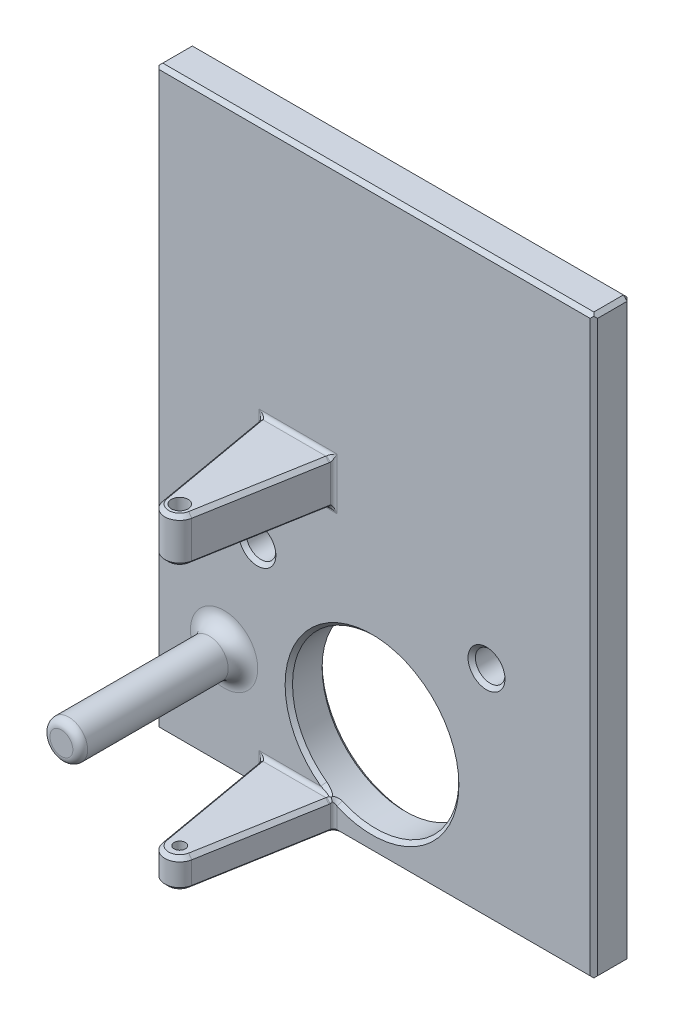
ISO-10303-21;
HEADER;
FILE_DESCRIPTION(('STEP AP214'),'2;1');
FILE_NAME('part.step','',(''),(''),'','','');
FILE_SCHEMA(('AUTOMOTIVE_DESIGN { 1 0 10303 214 1 1 1 1 }'));
ENDSEC;
DATA;
#1=APPLICATION_CONTEXT('core data for automotive mechanical design processes');
#2=APPLICATION_PROTOCOL_DEFINITION('international standard','automotive_design',2000,#1);
#3=PRODUCT_CONTEXT('',#1,'mechanical');
#4=PRODUCT('Part','Part','',(#3));
#5=PRODUCT_RELATED_PRODUCT_CATEGORY('part','',(#4));
#6=PRODUCT_DEFINITION_FORMATION('','',#4);
#7=PRODUCT_DEFINITION_CONTEXT('part definition',#1,'design');
#8=PRODUCT_DEFINITION('design','',#6,#7);
#9=PRODUCT_DEFINITION_SHAPE('','',#8);
#10=(LENGTH_UNIT() NAMED_UNIT(*) SI_UNIT(.MILLI.,.METRE.));
#11=(NAMED_UNIT(*) PLANE_ANGLE_UNIT() SI_UNIT($,.RADIAN.));
#12=(NAMED_UNIT(*) SI_UNIT($,.STERADIAN.) SOLID_ANGLE_UNIT());
#13=UNCERTAINTY_MEASURE_WITH_UNIT(LENGTH_MEASURE(1.E-05),#10,'distance_accuracy_value','');
#14=(GEOMETRIC_REPRESENTATION_CONTEXT(3) GLOBAL_UNCERTAINTY_ASSIGNED_CONTEXT((#13)) GLOBAL_UNIT_ASSIGNED_CONTEXT((#10,
#11,#12)) REPRESENTATION_CONTEXT('',''));
#15=CARTESIAN_POINT('',(0.,0.,0.));
#16=DIRECTION('',(0.,0.,1.));
#17=DIRECTION('',(1.,0.,0.));
#18=AXIS2_PLACEMENT_3D('',#15,#16,#17);
#19=CARTESIAN_POINT('',(0.,0.,5.));
#20=DIRECTION('',(0.,0.,-1.));
#21=DIRECTION('',(-1.,0.,0.));
#22=AXIS2_PLACEMENT_3D('',#19,#20,#21);
#23=PLANE('',#22);
#24=CARTESIAN_POINT('',(65.4838667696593,36.5,5.));
#25=DIRECTION('',(0.,0.,-1.));
#26=DIRECTION('',(-1.,0.,0.));
#27=AXIS2_PLACEMENT_3D('',#24,#25,#26);
#28=CIRCLE('',#27,2.5);
#29=CARTESIAN_POINT('',(62.9838667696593,36.5,5.));
#30=VERTEX_POINT('',#29);
#31=EDGE_CURVE('E1492',#30,#30,#28,.T.);
#32=ORIENTED_EDGE('',*,*,#31,.T.);
#33=EDGE_LOOP('',(#32));
#34=FACE_BOUND('',#33,.T.);
#35=CARTESIAN_POINT('',(34.5,35.5,5.));
#36=DIRECTION('',(0.,0.,-1.));
#37=DIRECTION('',(-1.,0.,0.));
#38=AXIS2_PLACEMENT_3D('',#35,#36,#37);
#39=CIRCLE('',#38,2.5);
#40=CARTESIAN_POINT('',(32.,35.5,5.));
#41=VERTEX_POINT('',#40);
#42=EDGE_CURVE('E1489',#41,#41,#39,.T.);
#43=ORIENTED_EDGE('',*,*,#42,.T.);
#44=EDGE_LOOP('',(#43));
#45=FACE_BOUND('',#44,.T.);
#46=DIRECTION('',(0.,-1.,0.));
#47=VECTOR('',#46,1.);
#48=CARTESIAN_POINT('',(45.2716347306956,0.,5.));
#49=LINE('',#48,#47);
#50=CARTESIAN_POINT('',(45.2716347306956,51.5,5.));
#51=VERTEX_POINT('',#50);
#52=CARTESIAN_POINT('',(45.2716347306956,44.5,5.));
#53=VERTEX_POINT('',#52);
#54=EDGE_CURVE('E372',#51,#53,#49,.T.);
#55=ORIENTED_EDGE('',*,*,#54,.T.);
#56=DIRECTION('',(1.,0.,0.));
#57=VECTOR('',#56,1.);
#58=CARTESIAN_POINT('',(0.,44.5,5.));
#59=LINE('',#58,#57);
#60=CARTESIAN_POINT('',(34.7283652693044,44.5,5.));
#61=VERTEX_POINT('',#60);
#62=EDGE_CURVE('E370',#53,#61,#59,.F.);
#63=ORIENTED_EDGE('',*,*,#62,.T.);
#64=DIRECTION('',(0.,-1.,0.));
#65=VECTOR('',#64,1.);
#66=CARTESIAN_POINT('',(34.7283652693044,0.,5.));
#67=LINE('',#66,#65);
#68=CARTESIAN_POINT('',(34.7283652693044,51.5,5.));
#69=VERTEX_POINT('',#68);
#70=EDGE_CURVE('E354',#61,#69,#67,.F.);
#71=ORIENTED_EDGE('',*,*,#70,.T.);
#72=DIRECTION('',(1.,0.,0.));
#73=VECTOR('',#72,1.);
#74=CARTESIAN_POINT('',(44.8520849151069,51.5,5.));
#75=LINE('',#74,#73);
#76=EDGE_CURVE('E367',#69,#51,#75,.T.);
#77=ORIENTED_EDGE('',*,*,#76,.T.);
#78=EDGE_LOOP('',(#55,#63,#71,#77));
#79=FACE_BOUND('',#78,.T.);
#80=DIRECTION('',(1.,0.,0.));
#81=VECTOR('',#80,1.);
#82=CARTESIAN_POINT('',(44.8461179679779,11.5,5.));
#83=LINE('',#82,#81);
#84=CARTESIAN_POINT('',(34.7283652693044,11.5,5.));
#85=VERTEX_POINT('',#84);
#86=CARTESIAN_POINT('',(43.0853416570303,11.5,5.));
#87=VERTEX_POINT('',#86);
#88=EDGE_CURVE('E1220',#85,#87,#83,.T.);
#89=ORIENTED_EDGE('',*,*,#88,.T.);
#90=CARTESIAN_POINT('',(50.,21.,5.));
#91=DIRECTION('',(0.,0.,-1.));
#92=DIRECTION('',(-1.,0.,0.));
#93=AXIS2_PLACEMENT_3D('',#90,#91,#92);
#94=CIRCLE('',#93,11.75);
#95=CARTESIAN_POINT('',(45.2716347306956,10.2433712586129,5.));
#96=VERTEX_POINT('',#95);
#97=EDGE_CURVE('E11',#87,#96,#94,.T.);
#98=ORIENTED_EDGE('',*,*,#97,.T.);
#99=DIRECTION('',(0.,-1.,0.));
#100=VECTOR('',#99,1.);
#101=CARTESIAN_POINT('',(45.2716347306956,0.,5.));
#102=LINE('',#101,#100);
#103=CARTESIAN_POINT('',(45.2716347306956,7.5,5.));
#104=VERTEX_POINT('',#103);
#105=EDGE_CURVE('E1239',#96,#104,#102,.T.);
#106=ORIENTED_EDGE('',*,*,#105,.T.);
#107=DIRECTION('',(1.,0.,0.));
#108=VECTOR('',#107,1.);
#109=CARTESIAN_POINT('',(0.,7.5,5.));
#110=LINE('',#109,#108);
#111=CARTESIAN_POINT('',(79.5,7.5,5.));
#112=VERTEX_POINT('',#111);
#113=EDGE_CURVE('E1262',#104,#112,#110,.T.);
#114=ORIENTED_EDGE('',*,*,#113,.T.);
#115=DIRECTION('',(0.,1.,0.));
#116=VECTOR('',#115,1.);
#117=CARTESIAN_POINT('',(79.5,0.,5.));
#118=LINE('',#117,#116);
#119=CARTESIAN_POINT('',(79.5,84.5,5.));
#120=VERTEX_POINT('',#119);
#121=EDGE_CURVE('E1259',#112,#120,#118,.T.);
#122=ORIENTED_EDGE('',*,*,#121,.T.);
#123=DIRECTION('',(-1.,0.,0.));
#124=VECTOR('',#123,1.);
#125=CARTESIAN_POINT('',(0.,84.5,5.));
#126=LINE('',#125,#124);
#127=CARTESIAN_POINT('',(21.2031991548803,84.5,5.));
#128=VERTEX_POINT('',#127);
#129=EDGE_CURVE('E1251',#120,#128,#126,.T.);
#130=ORIENTED_EDGE('',*,*,#129,.T.);
#131=DIRECTION('',(0.,-1.,0.));
#132=VECTOR('',#131,1.);
#133=CARTESIAN_POINT('',(21.2031991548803,0.,5.));
#134=LINE('',#133,#132);
#135=CARTESIAN_POINT('',(21.2031991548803,7.5,5.));
#136=VERTEX_POINT('',#135);
#137=EDGE_CURVE('E1265',#128,#136,#134,.T.);
#138=ORIENTED_EDGE('',*,*,#137,.T.);
#139=DIRECTION('',(1.,0.,0.));
#140=VECTOR('',#139,1.);
#141=CARTESIAN_POINT('',(0.,7.5,5.));
#142=LINE('',#141,#140);
#143=CARTESIAN_POINT('',(34.7283652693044,7.5,5.));
#144=VERTEX_POINT('',#143);
#145=EDGE_CURVE('E1268',#136,#144,#142,.T.);
#146=ORIENTED_EDGE('',*,*,#145,.T.);
#147=DIRECTION('',(0.,-1.,0.));
#148=VECTOR('',#147,1.);
#149=CARTESIAN_POINT('',(34.7283652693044,0.,5.));
#150=LINE('',#149,#148);
#151=EDGE_CURVE('E1231',#144,#85,#150,.F.);
#152=ORIENTED_EDGE('',*,*,#151,.T.);
#153=EDGE_LOOP('',(#89,#98,#106,#114,#122,#130,#138,#146,#152));
#154=FACE_BOUND('',#153,.T.);
#155=CARTESIAN_POINT('',(29.9970165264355,21.,5.));
#156=DIRECTION('',(0.,0.,-1.));
#157=DIRECTION('',(-1.,0.,0.));
#158=AXIS2_PLACEMENT_3D('',#155,#156,#157);
#159=CIRCLE('',#158,4.55);
#160=CARTESIAN_POINT('',(25.4470165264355,21.,5.));
#161=VERTEX_POINT('',#160);
#162=EDGE_CURVE('E1680',#161,#161,#159,.T.);
#163=ORIENTED_EDGE('',*,*,#162,.T.);
#164=EDGE_LOOP('',(#163));
#165=FACE_BOUND('',#164,.T.);
#166=ADVANCED_FACE('F39',(#34,#45,#79,#154,#165),#23,.F.);
#167=CARTESIAN_POINT('',(80.,0.,5.));
#168=DIRECTION('',(-1.,0.,0.));
#169=DIRECTION('',(0.,0.,1.));
#170=AXIS2_PLACEMENT_3D('',#167,#168,#169);
#171=PLANE('',#170);
#172=DIRECTION('',(0.,-1.,0.));
#173=VECTOR('',#172,1.);
#174=CARTESIAN_POINT('',(80.,0.,4.5));
#175=LINE('',#174,#173);
#176=CARTESIAN_POINT('',(80.,84.5,4.5));
#177=VERTEX_POINT('',#176);
#178=CARTESIAN_POINT('',(80.,7.5,4.5));
#179=VERTEX_POINT('',#178);
#180=EDGE_CURVE('E1317',#177,#179,#175,.T.);
#181=ORIENTED_EDGE('',*,*,#180,.T.);
#182=DIRECTION('',(0.,0.,-1.));
#183=VECTOR('',#182,1.);
#184=CARTESIAN_POINT('',(80.,7.5,5.));
#185=LINE('',#184,#183);
#186=CARTESIAN_POINT('',(80.,7.5,0.5));
#187=VERTEX_POINT('',#186);
#188=EDGE_CURVE('E1437',#179,#187,#185,.T.);
#189=ORIENTED_EDGE('',*,*,#188,.T.);
#190=DIRECTION('',(0.,1.,0.));
#191=VECTOR('',#190,1.);
#192=CARTESIAN_POINT('',(80.,85.,0.5));
#193=LINE('',#192,#191);
#194=CARTESIAN_POINT('',(80.,84.5,0.5));
#195=VERTEX_POINT('',#194);
#196=EDGE_CURVE('E1434',#187,#195,#193,.T.);
#197=ORIENTED_EDGE('',*,*,#196,.T.);
#198=DIRECTION('',(0.,0.,1.));
#199=VECTOR('',#198,1.);
#200=CARTESIAN_POINT('',(80.,84.5,5.));
#201=LINE('',#200,#199);
#202=EDGE_CURVE('E1431',#195,#177,#201,.T.);
#203=ORIENTED_EDGE('',*,*,#202,.T.);
#204=EDGE_LOOP('',(#181,#189,#197,#203));
#205=FACE_BOUND('',#204,.T.);
#206=ADVANCED_FACE('F1854',(#205),#171,.F.);
#207=CARTESIAN_POINT('',(0.,0.,0.));
#208=DIRECTION('',(0.,0.,-1.));
#209=DIRECTION('',(-1.,0.,0.));
#210=AXIS2_PLACEMENT_3D('',#207,#208,#209);
#211=PLANE('',#210);
#212=CARTESIAN_POINT('',(65.4838667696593,36.5,0.));
#213=DIRECTION('',(0.,0.,-1.));
#214=DIRECTION('',(-1.,0.,0.));
#215=AXIS2_PLACEMENT_3D('',#212,#213,#214);
#216=CIRCLE('',#215,2.49999999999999);
#217=CARTESIAN_POINT('',(62.9838667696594,36.5,0.));
#218=VERTEX_POINT('',#217);
#219=EDGE_CURVE('E1031',#218,#218,#216,.F.);
#220=ORIENTED_EDGE('',*,*,#219,.T.);
#221=EDGE_LOOP('',(#220));
#222=FACE_BOUND('',#221,.T.);
#223=CARTESIAN_POINT('',(34.5,35.5,0.));
#224=DIRECTION('',(0.,0.,-1.));
#225=DIRECTION('',(-1.,0.,0.));
#226=AXIS2_PLACEMENT_3D('',#223,#224,#225);
#227=CIRCLE('',#226,2.49999999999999);
#228=CARTESIAN_POINT('',(32.,35.5,0.));
#229=VERTEX_POINT('',#228);
#230=EDGE_CURVE('E1035',#229,#229,#227,.F.);
#231=ORIENTED_EDGE('',*,*,#230,.T.);
#232=EDGE_LOOP('',(#231));
#233=FACE_BOUND('',#232,.T.);
#234=CARTESIAN_POINT('',(50.,21.,0.));
#235=DIRECTION('',(0.,0.,-1.));
#236=DIRECTION('',(-1.,0.,0.));
#237=AXIS2_PLACEMENT_3D('',#234,#235,#236);
#238=CIRCLE('',#237,11.75);
#239=CARTESIAN_POINT('',(38.25,21.,0.));
#240=VERTEX_POINT('',#239);
#241=EDGE_CURVE('E1039',#240,#240,#238,.F.);
#242=ORIENTED_EDGE('',*,*,#241,.T.);
#243=EDGE_LOOP('',(#242));
#244=FACE_BOUND('',#243,.T.);
#245=DIRECTION('',(0.,1.,0.));
#246=VECTOR('',#245,1.);
#247=CARTESIAN_POINT('',(21.2031991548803,85.,0.));
#248=LINE('',#247,#246);
#249=CARTESIAN_POINT('',(21.2031991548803,7.5,0.));
#250=VERTEX_POINT('',#249);
#251=CARTESIAN_POINT('',(21.2031991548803,84.5,0.));
#252=VERTEX_POINT('',#251);
#253=EDGE_CURVE('E1372',#250,#252,#248,.T.);
#254=ORIENTED_EDGE('',*,*,#253,.T.);
#255=DIRECTION('',(1.,0.,0.));
#256=VECTOR('',#255,1.);
#257=CARTESIAN_POINT('',(80.,84.5,0.));
#258=LINE('',#257,#256);
#259=CARTESIAN_POINT('',(79.5,84.5,0.));
#260=VERTEX_POINT('',#259);
#261=EDGE_CURVE('E1375',#252,#260,#258,.T.);
#262=ORIENTED_EDGE('',*,*,#261,.T.);
#263=DIRECTION('',(0.,-1.,0.));
#264=VECTOR('',#263,1.);
#265=CARTESIAN_POINT('',(79.5,7.,0.));
#266=LINE('',#265,#264);
#267=CARTESIAN_POINT('',(79.5,7.5,0.));
#268=VERTEX_POINT('',#267);
#269=EDGE_CURVE('E1325',#260,#268,#266,.T.);
#270=ORIENTED_EDGE('',*,*,#269,.T.);
#271=DIRECTION('',(-1.,0.,0.));
#272=VECTOR('',#271,1.);
#273=CARTESIAN_POINT('',(20.7031991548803,7.5,0.));
#274=LINE('',#273,#272);
#275=EDGE_CURVE('E1369',#268,#250,#274,.T.);
#276=ORIENTED_EDGE('',*,*,#275,.T.);
#277=EDGE_LOOP('',(#254,#262,#270,#276));
#278=FACE_BOUND('',#277,.T.);
#279=ADVANCED_FACE('F1859',(#222,#233,#244,#278),#211,.T.);
#280=CARTESIAN_POINT('',(40.,11.,21.));
#281=DIRECTION('',(0.,-1.,0.));
#282=DIRECTION('',(0.,0.,-1.));
#283=AXIS2_PLACEMENT_3D('',#280,#281,#282);
#284=CYLINDRICAL_SURFACE('',#283,2.);
#285=DIRECTION('',(0.,-1.,0.));
#286=VECTOR('',#285,1.);
#287=CARTESIAN_POINT('',(41.9696155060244,11.,21.3472963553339));
#288=LINE('',#287,#286);
#289=CARTESIAN_POINT('',(41.9696155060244,10.5,21.3472963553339));
#290=VERTEX_POINT('',#289);
#291=CARTESIAN_POINT('',(41.9696155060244,7.5,21.3472963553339));
#292=VERTEX_POINT('',#291);
#293=EDGE_CURVE('E1660',#290,#292,#288,.T.);
#294=ORIENTED_EDGE('',*,*,#293,.F.);
#295=CARTESIAN_POINT('',(40.,10.5,21.));
#296=DIRECTION('',(0.,-1.,0.));
#297=DIRECTION('',(0.,0.,-1.));
#298=AXIS2_PLACEMENT_3D('',#295,#296,#297);
#299=CIRCLE('',#298,2.);
#300=CARTESIAN_POINT('',(38.0303844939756,10.5,21.3472963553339));
#301=VERTEX_POINT('',#300);
#302=EDGE_CURVE('E1664',#290,#301,#299,.T.);
#303=ORIENTED_EDGE('',*,*,#302,.T.);
#304=DIRECTION('',(0.,-1.,0.));
#305=VECTOR('',#304,1.);
#306=CARTESIAN_POINT('',(38.0303844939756,11.,21.3472963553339));
#307=LINE('',#306,#305);
#308=CARTESIAN_POINT('',(38.0303844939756,7.5,21.3472963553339));
#309=VERTEX_POINT('',#308);
#310=EDGE_CURVE('E1662',#301,#309,#307,.T.);
#311=ORIENTED_EDGE('',*,*,#310,.T.);
#312=CARTESIAN_POINT('',(40.,7.5,21.));
#313=DIRECTION('',(0.,1.,0.));
#314=DIRECTION('',(0.,0.,1.));
#315=AXIS2_PLACEMENT_3D('',#312,#313,#314);
#316=CIRCLE('',#315,2.);
#317=EDGE_CURVE('E1302',#309,#292,#316,.T.);
#318=ORIENTED_EDGE('',*,*,#317,.T.);
#319=EDGE_LOOP('',(#294,#303,#311,#318));
#320=FACE_BOUND('',#319,.T.);
#321=ADVANCED_FACE('F1659',(#320),#284,.T.);
#322=CARTESIAN_POINT('',(44.8520849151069,11.,5.));
#323=DIRECTION('',(0.984807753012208,0.,0.173648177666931));
#324=DIRECTION('',(0.173648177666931,0.,-0.984807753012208));
#325=AXIS2_PLACEMENT_3D('',#322,#323,#324);
#326=PLANE('',#325);
#327=DIRECTION('',(0.,-1.,0.));
#328=VECTOR('',#327,1.);
#329=CARTESIAN_POINT('',(44.7792308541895,11.,5.41317591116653));
#330=LINE('',#329,#328);
#331=CARTESIAN_POINT('',(44.7792308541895,7.5,5.41317591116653));
#332=VERTEX_POINT('',#331);
#333=CARTESIAN_POINT('',(44.7792308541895,10.5151922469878,5.41317591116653));
#334=VERTEX_POINT('',#333);
#335=EDGE_CURVE('E1252',#332,#334,#330,.F.);
#336=ORIENTED_EDGE('',*,*,#335,.T.);
#337=CARTESIAN_POINT('',(44.7486119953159,10.5,5.58682408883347));
#338=CARTESIAN_POINT('',(44.7588703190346,10.499997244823,5.52864624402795));
#339=CARTESIAN_POINT('',(44.7691284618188,10.5050870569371,5.47046942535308));
#340=CARTESIAN_POINT('',(44.7792308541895,10.5151922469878,5.41317591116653));
#341=B_SPLINE_CURVE_WITH_KNOTS('',3,(#337,#338,#339,#340),.UNSPECIFIED.,.F.,.F.,(4,4),
(1.5707963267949,1.74532925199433),.UNSPECIFIED.);
#342=CARTESIAN_POINT('',(44.7486119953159,10.5,5.58682408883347));
#343=VERTEX_POINT('',#342);
#344=EDGE_CURVE('E618',#334,#343,#341,.F.);
#345=ORIENTED_EDGE('',*,*,#344,.T.);
#346=DIRECTION('',(-0.173648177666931,0.,0.984807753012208));
#347=VECTOR('',#346,1.);
#348=CARTESIAN_POINT('',(41.9696155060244,10.5,21.3472963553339));
#349=LINE('',#348,#347);
#350=EDGE_CURVE('E2544',#343,#290,#349,.T.);
#351=ORIENTED_EDGE('',*,*,#350,.T.);
#352=ORIENTED_EDGE('',*,*,#293,.T.);
#353=DIRECTION('',(0.173648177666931,0.,-0.984807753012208));
#354=VECTOR('',#353,1.);
#355=CARTESIAN_POINT('',(44.7792308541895,7.5,5.41317591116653));
#356=LINE('',#355,#354);
#357=EDGE_CURVE('E1306',#292,#332,#356,.T.);
#358=ORIENTED_EDGE('',*,*,#357,.T.);
#359=EDGE_LOOP('',(#336,#345,#351,#352,#358));
#360=FACE_BOUND('',#359,.T.);
#361=ADVANCED_FACE('F2517',(#360),#326,.T.);
#362=CARTESIAN_POINT('',(35.1479150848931,11.,5.));
#363=DIRECTION('',(-0.984807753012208,0.,0.173648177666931));
#364=DIRECTION('',(0.173648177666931,0.,0.984807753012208));
#365=AXIS2_PLACEMENT_3D('',#362,#363,#364);
#366=PLANE('',#365);
#367=DIRECTION('',(-0.173648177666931,0.,-0.984807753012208));
#368=VECTOR('',#367,1.);
#369=CARTESIAN_POINT('',(35.2360785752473,10.5,5.5));
#370=LINE('',#369,#368);
#371=CARTESIAN_POINT('',(35.2513880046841,10.5,5.58682408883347));
#372=VERTEX_POINT('',#371);
#373=EDGE_CURVE('E1512',#301,#372,#370,.T.);
#374=ORIENTED_EDGE('',*,*,#373,.T.);
#375=CARTESIAN_POINT('',(35.2207691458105,10.5151922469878,5.41317591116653));
#376=CARTESIAN_POINT('',(35.2308715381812,10.5050870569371,5.47046942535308));
#377=CARTESIAN_POINT('',(35.2411296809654,10.499997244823,5.52864624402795));
#378=CARTESIAN_POINT('',(35.2513880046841,10.5,5.58682408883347));
#379=B_SPLINE_CURVE_WITH_KNOTS('',3,(#375,#376,#377,#378),.UNSPECIFIED.,.F.,.F.,(4,4),
(1.39626340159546,1.5707963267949),.UNSPECIFIED.);
#380=CARTESIAN_POINT('',(35.2207691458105,10.5151922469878,5.41317591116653));
#381=VERTEX_POINT('',#380);
#382=EDGE_CURVE('E541',#372,#381,#379,.F.);
#383=ORIENTED_EDGE('',*,*,#382,.T.);
#384=DIRECTION('',(0.,-1.,0.));
#385=VECTOR('',#384,1.);
#386=CARTESIAN_POINT('',(35.2207691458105,11.,5.41317591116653));
#387=LINE('',#386,#385);
#388=CARTESIAN_POINT('',(35.2207691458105,7.5,5.41317591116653));
#389=VERTEX_POINT('',#388);
#390=EDGE_CURVE('E1205',#381,#389,#387,.T.);
#391=ORIENTED_EDGE('',*,*,#390,.T.);
#392=DIRECTION('',(0.173648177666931,0.,0.984807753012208));
#393=VECTOR('',#392,1.);
#394=CARTESIAN_POINT('',(38.0303844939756,7.5,21.3472963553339));
#395=LINE('',#394,#393);
#396=EDGE_CURVE('E1298',#389,#309,#395,.T.);
#397=ORIENTED_EDGE('',*,*,#396,.T.);
#398=ORIENTED_EDGE('',*,*,#310,.F.);
#399=EDGE_LOOP('',(#374,#383,#391,#397,#398));
#400=FACE_BOUND('',#399,.T.);
#401=ADVANCED_FACE('F2511',(#400),#366,.T.);
#402=CARTESIAN_POINT('',(40.,11.,21.));
#403=DIRECTION('',(0.,-1.,0.));
#404=DIRECTION('',(0.,0.,-1.));
#405=AXIS2_PLACEMENT_3D('',#402,#403,#404);
#406=PLANE('',#405);
#407=CARTESIAN_POINT('',(40.,11.,21.));
#408=DIRECTION('',(0.,-1.,0.));
#409=DIRECTION('',(0.,0.,-1.));
#410=AXIS2_PLACEMENT_3D('',#407,#408,#409);
#411=CIRCLE('',#410,0.765);
#412=CARTESIAN_POINT('',(40.,11.,20.235));
#413=VERTEX_POINT('',#412);
#414=EDGE_CURVE('E1667',#413,#413,#411,.T.);
#415=ORIENTED_EDGE('',*,*,#414,.T.);
#416=EDGE_LOOP('',(#415));
#417=FACE_BOUND('',#416,.T.);
#418=DIRECTION('',(1.,0.,0.));
#419=VECTOR('',#418,1.);
#420=CARTESIAN_POINT('',(35.1479150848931,11.,5.5));
#421=LINE('',#420,#419);
#422=CARTESIAN_POINT('',(44.2562081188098,11.,5.5));
#423=VERTEX_POINT('',#422);
#424=CARTESIAN_POINT('',(35.7437918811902,11.,5.5));
#425=VERTEX_POINT('',#424);
#426=EDGE_CURVE('E1246',#423,#425,#421,.F.);
#427=ORIENTED_EDGE('',*,*,#426,.T.);
#428=DIRECTION('',(0.173648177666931,0.,0.984807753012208));
#429=VECTOR('',#428,1.);
#430=CARTESIAN_POINT('',(38.5227883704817,11.,21.2604722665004));
#431=LINE('',#430,#429);
#432=CARTESIAN_POINT('',(38.5227883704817,11.,21.2604722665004));
#433=VERTEX_POINT('',#432);
#434=EDGE_CURVE('E2551',#425,#433,#431,.T.);
#435=ORIENTED_EDGE('',*,*,#434,.T.);
#436=CARTESIAN_POINT('',(40.,11.,21.));
#437=DIRECTION('',(0.,-1.,0.));
#438=DIRECTION('',(0.,0.,-1.));
#439=AXIS2_PLACEMENT_3D('',#436,#437,#438);
#440=CIRCLE('',#439,1.5);
#441=CARTESIAN_POINT('',(41.4772116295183,11.,21.2604722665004));
#442=VERTEX_POINT('',#441);
#443=EDGE_CURVE('E2555',#433,#442,#440,.F.);
#444=ORIENTED_EDGE('',*,*,#443,.T.);
#445=DIRECTION('',(0.173648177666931,0.,-0.984807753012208));
#446=VECTOR('',#445,1.);
#447=CARTESIAN_POINT('',(44.2715175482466,11.,5.41317591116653));
#448=LINE('',#447,#446);
#449=EDGE_CURVE('E1534',#442,#423,#448,.T.);
#450=ORIENTED_EDGE('',*,*,#449,.T.);
#451=EDGE_LOOP('',(#427,#435,#444,#450));
#452=FACE_BOUND('',#451,.T.);
#453=ADVANCED_FACE('F2486',(#417,#452),#406,.F.);
#454=CARTESIAN_POINT('',(40.,11.,21.));
#455=DIRECTION('',(0.,-1.,0.));
#456=DIRECTION('',(0.,0.,-1.));
#457=AXIS2_PLACEMENT_3D('',#454,#455,#456);
#458=CYLINDRICAL_SURFACE('',#457,0.765);
#459=CARTESIAN_POINT('',(40.,7.,21.));
#460=DIRECTION('',(0.,1.,0.));
#461=DIRECTION('',(0.,0.,1.));
#462=AXIS2_PLACEMENT_3D('',#459,#460,#461);
#463=CIRCLE('',#462,0.765);
#464=CARTESIAN_POINT('',(40.,7.,21.765));
#465=VERTEX_POINT('',#464);
#466=EDGE_CURVE('E1695',#465,#465,#463,.F.);
#467=ORIENTED_EDGE('',*,*,#466,.T.);
#468=EDGE_LOOP('',(#467));
#469=FACE_BOUND('',#468,.T.);
#470=ORIENTED_EDGE('',*,*,#414,.F.);
#471=EDGE_LOOP('',(#470));
#472=FACE_BOUND('',#471,.T.);
#473=ADVANCED_FACE('F1011',(#469,#472),#458,.F.);
#474=CARTESIAN_POINT('',(50.,21.,-5.));
#475=DIRECTION('',(0.,0.,1.));
#476=DIRECTION('',(1.,0.,0.));
#477=AXIS2_PLACEMENT_3D('',#474,#475,#476);
#478=CYLINDRICAL_SURFACE('',#477,11.25);
#479=CARTESIAN_POINT('',(44.855399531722,10.9952218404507,5.18603623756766));
#480=CARTESIAN_POINT('',(44.8449818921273,11.0005787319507,5.16911775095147));
#481=CARTESIAN_POINT('',(44.8339712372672,11.0062612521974,5.15268528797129));
#482=CARTESIAN_POINT('',(44.8109509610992,11.0181946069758,5.1207190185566));
#483=CARTESIAN_POINT('',(44.7988890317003,11.0244728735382,5.10512468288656));
#484=CARTESIAN_POINT('',(44.7617022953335,11.0439205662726,5.05993542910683));
#485=CARTESIAN_POINT('',(44.7356196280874,11.0576792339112,5.03190239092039));
#486=CARTESIAN_POINT('',(44.6814442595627,11.0865542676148,4.97890385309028));
#487=CARTESIAN_POINT('',(44.6533539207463,11.1016691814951,4.95396725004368));
#488=CARTESIAN_POINT('',(44.5956437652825,11.1330595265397,4.90666496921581));
#489=CARTESIAN_POINT('',(44.5659266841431,11.1493886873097,4.88424179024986));
#490=CARTESIAN_POINT('',(44.5055069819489,11.1829617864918,4.8418062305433));
#491=CARTESIAN_POINT('',(44.4749306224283,11.2001340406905,4.82187317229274));
#492=CARTESIAN_POINT('',(44.4130955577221,11.2352540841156,4.78413498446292));
#493=CARTESIAN_POINT('',(44.3818522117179,11.2531930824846,4.76634609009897));
#494=CARTESIAN_POINT('',(44.2873100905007,11.3080970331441,4.71584263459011));
#495=CARTESIAN_POINT('',(44.2231687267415,11.3461668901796,4.68597453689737));
#496=CARTESIAN_POINT('',(44.0933234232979,11.4250618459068,4.63287092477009));
#497=CARTESIAN_POINT('',(44.028385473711,11.4654184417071,4.60996036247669));
#498=CARTESIAN_POINT('',(43.8984797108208,11.5480227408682,4.57058200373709));
#499=CARTESIAN_POINT('',(43.8335330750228,11.5902569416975,4.55413687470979));
#500=CARTESIAN_POINT('',(43.7037128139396,11.6766237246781,4.52753552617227));
#501=CARTESIAN_POINT('',(43.6388385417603,11.7207562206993,4.51738242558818));
#502=CARTESIAN_POINT('',(43.5091657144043,11.8109952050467,4.50361668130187));
#503=CARTESIAN_POINT('',(43.4443669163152,11.8571015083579,4.50000467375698));
#504=CARTESIAN_POINT('',(43.3795824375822,11.9042553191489,4.5));
#505=B_SPLINE_CURVE_WITH_KNOTS('',3,(#479,#480,#481,#482,#483,#484,#485,#486,#487,#488,#489,
#490,#491,#492,#493,#494,#495,#496,#497,#498,#499,#500,#501,#502,#503,#504),.UNSPECIFIED.,.F.,
.F.,(4,2,2,2,2,2,2,2,2,2,2,2,4),(0.00446318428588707,0.00452499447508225,0.00458680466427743,
0.00471042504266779,0.00483404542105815,0.00495766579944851,0.00508128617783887,
0.00520490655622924,0.00545214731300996,0.00569938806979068,0.0059466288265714,
0.00619386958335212,0.00644111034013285),.UNSPECIFIED.);
#506=CARTESIAN_POINT('',(43.3795824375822,11.9042553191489,4.5));
#507=VERTEX_POINT('',#506);
#508=CARTESIAN_POINT('',(44.6643694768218,11.0957813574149,4.96429341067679));
#509=VERTEX_POINT('',#508);
#510=EDGE_CURVE('E984',#507,#509,#505,.F.);
#511=ORIENTED_EDGE('',*,*,#510,.T.);
#512=CARTESIAN_POINT('',(45.472841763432,10.7011001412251,4.5));
#513=CARTESIAN_POINT('',(45.4227396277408,10.7231239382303,4.50000564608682));
#514=CARTESIAN_POINT('',(45.3734088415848,10.7452445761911,4.50408120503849));
#515=CARTESIAN_POINT('',(45.2762068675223,10.7896555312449,4.5199686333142));
#516=CARTESIAN_POINT('',(45.2283266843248,10.8119512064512,4.53178802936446));
#517=CARTESIAN_POINT('',(45.157625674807,10.8454641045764,4.55539084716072));
#518=CARTESIAN_POINT('',(45.134164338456,10.8566868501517,4.56428922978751));
#519=CARTESIAN_POINT('',(45.087996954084,10.8789634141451,4.58396845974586));
#520=CARTESIAN_POINT('',(45.0653947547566,10.8899660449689,4.5946938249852));
#521=CARTESIAN_POINT('',(44.9990392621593,10.9225348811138,4.62950071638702));
#522=CARTESIAN_POINT('',(44.9565057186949,10.9437717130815,4.65627126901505));
#523=CARTESIAN_POINT('',(44.8956086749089,10.974621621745,4.70174498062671));
#524=CARTESIAN_POINT('',(44.8757318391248,10.9847692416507,4.71785092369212));
#525=CARTESIAN_POINT('',(44.8370063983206,11.0046774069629,4.75188167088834));
#526=CARTESIAN_POINT('',(44.8180195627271,11.0145105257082,4.76995902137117));
#527=CARTESIAN_POINT('',(44.7817349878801,11.0334245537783,4.80741226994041));
#528=CARTESIAN_POINT('',(44.7643247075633,11.0425626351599,4.82687308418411));
#529=CARTESIAN_POINT('',(44.731014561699,11.0601485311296,4.86722920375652));
#530=CARTESIAN_POINT('',(44.7151056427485,11.0686009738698,4.88813083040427));
#531=CARTESIAN_POINT('',(44.6848036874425,11.0847852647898,4.93141603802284));
#532=CARTESIAN_POINT('',(44.6704103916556,11.0925172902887,4.95379934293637));
#533=CARTESIAN_POINT('',(44.6431966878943,11.1072047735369,5.00011561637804));
#534=CARTESIAN_POINT('',(44.6303920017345,11.1141516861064,5.02401601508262));
#535=CARTESIAN_POINT('',(44.6063878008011,11.1272276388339,5.07360234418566));
#536=CARTESIAN_POINT('',(44.5953439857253,11.1332719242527,5.0989976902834));
#537=CARTESIAN_POINT('',(44.5754167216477,11.1442136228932,5.15040596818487));
#538=CARTESIAN_POINT('',(44.5664780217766,11.1491411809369,5.17653302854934));
#539=CARTESIAN_POINT('',(44.5585807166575,11.1535053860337,5.20305592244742));
#540=B_SPLINE_CURVE_WITH_KNOTS('',3,(#512,#513,#514,#515,#516,#517,#518,#519,#520,#521,#522,
#523,#524,#525,#526,#527,#528,#529,#530,#531,#532,#533,#534,#535,#536,#537,#538,#539),
.UNSPECIFIED.,.F.,.F.,(4,2,2,2,2,2,2,2,2,2,2,2,2,4),(0.,0.000169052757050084,
0.000338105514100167,0.000422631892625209,0.000507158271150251,0.000676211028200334,
0.000760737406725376,0.000845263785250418,0.00092979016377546,0.0010143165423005,
0.00109884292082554,0.00118336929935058,0.00126789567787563,0.00135242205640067),.UNSPECIFIED.);
#541=CARTESIAN_POINT('',(45.472841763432,10.7011001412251,4.5));
#542=VERTEX_POINT('',#541);
#543=EDGE_CURVE('E972',#509,#542,#540,.F.);
#544=ORIENTED_EDGE('',*,*,#543,.T.);
#545=CARTESIAN_POINT('',(50.,21.,4.5));
#546=DIRECTION('',(0.,0.,-1.));
#547=DIRECTION('',(-1.,0.,0.));
#548=AXIS2_PLACEMENT_3D('',#545,#546,#547);
#549=CIRCLE('',#548,11.25);
#550=EDGE_CURVE('E980',#542,#507,#549,.F.);
#551=ORIENTED_EDGE('',*,*,#550,.T.);
#552=EDGE_LOOP('',(#511,#544,#551));
#553=FACE_BOUND('',#552,.T.);
#554=CARTESIAN_POINT('',(50.,21.,0.500000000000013));
#555=DIRECTION('',(0.,0.,-1.));
#556=DIRECTION('',(-1.,0.,0.));
#557=AXIS2_PLACEMENT_3D('',#554,#555,#556);
#558=CIRCLE('',#557,11.25);
#559=CARTESIAN_POINT('',(38.75,21.,0.500000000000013));
#560=VERTEX_POINT('',#559);
#561=EDGE_CURVE('E985',#560,#560,#558,.T.);
#562=ORIENTED_EDGE('',*,*,#561,.T.);
#563=EDGE_LOOP('',(#562));
#564=FACE_BOUND('',#563,.T.);
#565=ADVANCED_FACE('F988',(#553,#564),#478,.F.);
#566=CARTESIAN_POINT('',(34.5,35.5,-5.));
#567=DIRECTION('',(0.,0.,1.));
#568=DIRECTION('',(1.,0.,0.));
#569=AXIS2_PLACEMENT_3D('',#566,#567,#568);
#570=CYLINDRICAL_SURFACE('',#569,2.);
#571=CARTESIAN_POINT('',(34.5,35.5,0.499999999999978));
#572=DIRECTION('',(0.,0.,-1.));
#573=DIRECTION('',(-1.,0.,0.));
#574=AXIS2_PLACEMENT_3D('',#571,#572,#573);
#575=CIRCLE('',#574,2.);
#576=CARTESIAN_POINT('',(32.5,35.5,0.499999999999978));
#577=VERTEX_POINT('',#576);
#578=EDGE_CURVE('E1027',#577,#577,#575,.T.);
#579=ORIENTED_EDGE('',*,*,#578,.T.);
#580=EDGE_LOOP('',(#579));
#581=FACE_BOUND('',#580,.T.);
#582=CARTESIAN_POINT('',(34.5,35.5,4.49999999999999));
#583=DIRECTION('',(0.,0.,-1.));
#584=DIRECTION('',(-1.,0.,0.));
#585=AXIS2_PLACEMENT_3D('',#582,#583,#584);
#586=CIRCLE('',#585,2.);
#587=CARTESIAN_POINT('',(32.5,35.5,4.49999999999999));
#588=VERTEX_POINT('',#587);
#589=EDGE_CURVE('E1221',#588,#588,#586,.F.);
#590=ORIENTED_EDGE('',*,*,#589,.T.);
#591=EDGE_LOOP('',(#590));
#592=FACE_BOUND('',#591,.T.);
#593=ADVANCED_FACE('F1010',(#581,#592),#570,.F.);
#594=CARTESIAN_POINT('',(65.4838667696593,36.5,-5.));
#595=DIRECTION('',(0.,0.,1.));
#596=DIRECTION('',(1.,0.,0.));
#597=AXIS2_PLACEMENT_3D('',#594,#595,#596);
#598=CYLINDRICAL_SURFACE('',#597,2.);
#599=CARTESIAN_POINT('',(65.4838667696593,36.5,0.499999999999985));
#600=DIRECTION('',(0.,0.,-1.));
#601=DIRECTION('',(-1.,0.,0.));
#602=AXIS2_PLACEMENT_3D('',#599,#600,#601);
#603=CIRCLE('',#602,2.);
#604=CARTESIAN_POINT('',(63.4838667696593,36.5,0.499999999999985));
#605=VERTEX_POINT('',#604);
#606=EDGE_CURVE('E456',#605,#605,#603,.T.);
#607=ORIENTED_EDGE('',*,*,#606,.T.);
#608=EDGE_LOOP('',(#607));
#609=FACE_BOUND('',#608,.T.);
#610=CARTESIAN_POINT('',(65.4838667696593,36.5,4.49999999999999));
#611=DIRECTION('',(0.,0.,-1.));
#612=DIRECTION('',(-1.,0.,0.));
#613=AXIS2_PLACEMENT_3D('',#610,#611,#612);
#614=CIRCLE('',#613,2.);
#615=CARTESIAN_POINT('',(63.4838667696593,36.5,4.49999999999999));
#616=VERTEX_POINT('',#615);
#617=EDGE_CURVE('E1440',#616,#616,#614,.F.);
#618=ORIENTED_EDGE('',*,*,#617,.T.);
#619=EDGE_LOOP('',(#618));
#620=FACE_BOUND('',#619,.T.);
#621=ADVANCED_FACE('F1884',(#609,#620),#598,.F.);
#622=CARTESIAN_POINT('',(29.9970165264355,21.,27.));
#623=DIRECTION('',(0.,0.,-1.));
#624=DIRECTION('',(-1.,0.,0.));
#625=AXIS2_PLACEMENT_3D('',#622,#623,#624);
#626=CYLINDRICAL_SURFACE('',#625,2.55);
#627=CARTESIAN_POINT('',(29.9970165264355,21.,26.));
#628=DIRECTION('',(0.,0.,1.));
#629=DIRECTION('',(1.,0.,0.));
#630=AXIS2_PLACEMENT_3D('',#627,#628,#629);
#631=CIRCLE('',#630,2.55);
#632=CARTESIAN_POINT('',(32.5470165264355,21.,26.));
#633=VERTEX_POINT('',#632);
#634=EDGE_CURVE('E385',#633,#633,#631,.F.);
#635=ORIENTED_EDGE('',*,*,#634,.T.);
#636=EDGE_LOOP('',(#635));
#637=FACE_BOUND('',#636,.T.);
#638=CARTESIAN_POINT('',(29.9970165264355,21.,7.));
#639=DIRECTION('',(0.,0.,-1.));
#640=DIRECTION('',(-1.,0.,0.));
#641=AXIS2_PLACEMENT_3D('',#638,#639,#640);
#642=CIRCLE('',#641,2.55);
#643=CARTESIAN_POINT('',(27.4470165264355,21.,7.));
#644=VERTEX_POINT('',#643);
#645=EDGE_CURVE('E1671',#644,#644,#642,.F.);
#646=ORIENTED_EDGE('',*,*,#645,.T.);
#647=EDGE_LOOP('',(#646));
#648=FACE_BOUND('',#647,.T.);
#649=ADVANCED_FACE('F1876',(#637,#648),#626,.T.);
#650=CARTESIAN_POINT('',(29.9970165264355,21.,27.));
#651=DIRECTION('',(0.,0.,1.));
#652=DIRECTION('',(1.,0.,0.));
#653=AXIS2_PLACEMENT_3D('',#650,#651,#652);
#654=PLANE('',#653);
#655=CARTESIAN_POINT('',(29.9970165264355,21.,27.));
#656=DIRECTION('',(0.,0.,1.));
#657=DIRECTION('',(1.,0.,0.));
#658=AXIS2_PLACEMENT_3D('',#655,#656,#657);
#659=CIRCLE('',#658,1.55);
#660=CARTESIAN_POINT('',(31.5470165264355,21.,27.));
#661=VERTEX_POINT('',#660);
#662=EDGE_CURVE('E1684',#661,#661,#659,.T.);
#663=ORIENTED_EDGE('',*,*,#662,.T.);
#664=EDGE_LOOP('',(#663));
#665=FACE_BOUND('',#664,.T.);
#666=ADVANCED_FACE('F1869',(#665),#654,.T.);
#667=CARTESIAN_POINT('',(29.9970165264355,21.,7.));
#668=DIRECTION('',(0.,0.,-1.));
#669=DIRECTION('',(-1.,0.,0.));
#670=AXIS2_PLACEMENT_3D('',#667,#668,#669);
#671=TOROIDAL_SURFACE('',#670,4.55,2.);
#672=ORIENTED_EDGE('',*,*,#162,.F.);
#673=EDGE_LOOP('',(#672));
#674=FACE_BOUND('',#673,.T.);
#675=ORIENTED_EDGE('',*,*,#645,.F.);
#676=EDGE_LOOP('',(#675));
#677=FACE_BOUND('',#676,.T.);
#678=ADVANCED_FACE('F1867',(#674,#677),#671,.F.);
#679=CARTESIAN_POINT('',(29.9970165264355,21.,26.));
#680=DIRECTION('',(0.,0.,1.));
#681=DIRECTION('',(1.,0.,0.));
#682=AXIS2_PLACEMENT_3D('',#679,#680,#681);
#683=TOROIDAL_SURFACE('',#682,1.55,1.);
#684=ORIENTED_EDGE('',*,*,#634,.F.);
#685=EDGE_LOOP('',(#684));
#686=FACE_BOUND('',#685,.T.);
#687=ORIENTED_EDGE('',*,*,#662,.F.);
#688=EDGE_LOOP('',(#687));
#689=FACE_BOUND('',#688,.T.);
#690=ADVANCED_FACE('F1717',(#686,#689),#683,.T.);
#691=CARTESIAN_POINT('',(40.,51.,21.));
#692=DIRECTION('',(0.,-1.,0.));
#693=DIRECTION('',(0.,0.,-1.));
#694=AXIS2_PLACEMENT_3D('',#691,#692,#693);
#695=CYLINDRICAL_SURFACE('',#694,2.);
#696=DIRECTION('',(0.,-1.,0.));
#697=VECTOR('',#696,1.);
#698=CARTESIAN_POINT('',(38.0303844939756,51.,21.3472963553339));
#699=LINE('',#698,#697);
#700=CARTESIAN_POINT('',(38.0303844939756,50.5,21.3472963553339));
#701=VERTEX_POINT('',#700);
#702=CARTESIAN_POINT('',(38.0303844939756,45.5,21.3472963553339));
#703=VERTEX_POINT('',#702);
#704=EDGE_CURVE('E1832',#701,#703,#699,.T.);
#705=ORIENTED_EDGE('',*,*,#704,.T.);
#706=CARTESIAN_POINT('',(40.,45.5,21.));
#707=DIRECTION('',(0.,-1.,0.));
#708=DIRECTION('',(0.,0.,-1.));
#709=AXIS2_PLACEMENT_3D('',#706,#707,#708);
#710=CIRCLE('',#709,2.);
#711=CARTESIAN_POINT('',(41.9696155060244,45.5,21.3472963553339));
#712=VERTEX_POINT('',#711);
#713=EDGE_CURVE('E1114',#703,#712,#710,.F.);
#714=ORIENTED_EDGE('',*,*,#713,.T.);
#715=DIRECTION('',(0.,-1.,0.));
#716=VECTOR('',#715,1.);
#717=CARTESIAN_POINT('',(41.9696155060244,51.,21.3472963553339));
#718=LINE('',#717,#716);
#719=CARTESIAN_POINT('',(41.9696155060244,50.5,21.3472963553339));
#720=VERTEX_POINT('',#719);
#721=EDGE_CURVE('E1674',#720,#712,#718,.T.);
#722=ORIENTED_EDGE('',*,*,#721,.F.);
#723=CARTESIAN_POINT('',(40.,50.5,21.));
#724=DIRECTION('',(0.,-1.,0.));
#725=DIRECTION('',(0.,0.,-1.));
#726=AXIS2_PLACEMENT_3D('',#723,#724,#725);
#727=CIRCLE('',#726,2.);
#728=EDGE_CURVE('E1188',#720,#701,#727,.T.);
#729=ORIENTED_EDGE('',*,*,#728,.T.);
#730=EDGE_LOOP('',(#705,#714,#722,#729));
#731=FACE_BOUND('',#730,.T.);
#732=ADVANCED_FACE('F1811',(#731),#695,.T.);
#733=CARTESIAN_POINT('',(44.8520849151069,51.,5.));
#734=DIRECTION('',(0.984807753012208,0.,0.173648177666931));
#735=DIRECTION('',(0.173648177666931,0.,-0.984807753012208));
#736=AXIS2_PLACEMENT_3D('',#733,#734,#735);
#737=PLANE('',#736);
#738=DIRECTION('',(0.173648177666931,0.,-0.984807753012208));
#739=VECTOR('',#738,1.);
#740=CARTESIAN_POINT('',(44.8520849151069,45.5,5.));
#741=LINE('',#740,#739);
#742=CARTESIAN_POINT('',(44.7486119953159,45.5,5.58682408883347));
#743=VERTEX_POINT('',#742);
#744=EDGE_CURVE('E1198',#712,#743,#741,.T.);
#745=ORIENTED_EDGE('',*,*,#744,.T.);
#746=CARTESIAN_POINT('',(44.7792308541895,45.4848077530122,5.41317591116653));
#747=CARTESIAN_POINT('',(44.7691284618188,45.4949129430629,5.47046942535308));
#748=CARTESIAN_POINT('',(44.7588703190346,45.5000027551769,5.52864624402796));
#749=CARTESIAN_POINT('',(44.7486119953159,45.5,5.58682408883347));
#750=B_SPLINE_CURVE_WITH_KNOTS('',3,(#746,#747,#748,#749),.UNSPECIFIED.,.F.,.F.,(4,4),
(1.39626340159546,1.5707963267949),.UNSPECIFIED.);
#751=CARTESIAN_POINT('',(44.7792308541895,45.4848077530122,5.41317591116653));
#752=VERTEX_POINT('',#751);
#753=EDGE_CURVE('E862',#743,#752,#750,.F.);
#754=ORIENTED_EDGE('',*,*,#753,.T.);
#755=DIRECTION('',(0.,-1.,0.));
#756=VECTOR('',#755,1.);
#757=CARTESIAN_POINT('',(44.7792308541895,51.,5.41317591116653));
#758=LINE('',#757,#756);
#759=CARTESIAN_POINT('',(44.7792308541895,50.5151922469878,5.41317591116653));
#760=VERTEX_POINT('',#759);
#761=EDGE_CURVE('E1206',#752,#760,#758,.F.);
#762=ORIENTED_EDGE('',*,*,#761,.T.);
#763=CARTESIAN_POINT('',(44.7486119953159,50.5,5.58682408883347));
#764=CARTESIAN_POINT('',(44.7588703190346,50.499997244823,5.52864624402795));
#765=CARTESIAN_POINT('',(44.7691284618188,50.5050870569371,5.47046942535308));
#766=CARTESIAN_POINT('',(44.7792308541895,50.5151922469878,5.41317591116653));
#767=B_SPLINE_CURVE_WITH_KNOTS('',3,(#763,#764,#765,#766),.UNSPECIFIED.,.F.,.F.,(4,4),
(1.5707963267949,1.74532925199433),.UNSPECIFIED.);
#768=CARTESIAN_POINT('',(44.7486119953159,50.5,5.58682408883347));
#769=VERTEX_POINT('',#768);
#770=EDGE_CURVE('E1794',#760,#769,#767,.F.);
#771=ORIENTED_EDGE('',*,*,#770,.T.);
#772=DIRECTION('',(-0.173648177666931,0.,0.984807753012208));
#773=VECTOR('',#772,1.);
#774=CARTESIAN_POINT('',(41.9696155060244,50.5,21.3472963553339));
#775=LINE('',#774,#773);
#776=EDGE_CURVE('E1120',#769,#720,#775,.T.);
#777=ORIENTED_EDGE('',*,*,#776,.T.);
#778=ORIENTED_EDGE('',*,*,#721,.T.);
#779=EDGE_LOOP('',(#745,#754,#762,#771,#777,#778));
#780=FACE_BOUND('',#779,.T.);
#781=ADVANCED_FACE('F1800',(#780),#737,.T.);
#782=CARTESIAN_POINT('',(35.1479150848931,51.,5.));
#783=DIRECTION('',(-0.984807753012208,0.,0.173648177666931));
#784=DIRECTION('',(0.173648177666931,0.,0.984807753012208));
#785=AXIS2_PLACEMENT_3D('',#782,#783,#784);
#786=PLANE('',#785);
#787=DIRECTION('',(0.,-1.,0.));
#788=VECTOR('',#787,1.);
#789=CARTESIAN_POINT('',(35.2207691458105,51.,5.41317591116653));
#790=LINE('',#789,#788);
#791=CARTESIAN_POINT('',(35.2207691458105,50.5151922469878,5.41317591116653));
#792=VERTEX_POINT('',#791);
#793=CARTESIAN_POINT('',(35.2207691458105,45.4848077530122,5.41317591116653));
#794=VERTEX_POINT('',#793);
#795=EDGE_CURVE('E357',#792,#794,#790,.T.);
#796=ORIENTED_EDGE('',*,*,#795,.T.);
#797=CARTESIAN_POINT('',(35.2513880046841,45.5,5.58682408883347));
#798=CARTESIAN_POINT('',(35.2411296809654,45.5000027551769,5.52864624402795));
#799=CARTESIAN_POINT('',(35.2308715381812,45.4949129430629,5.47046942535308));
#800=CARTESIAN_POINT('',(35.2207691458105,45.4848077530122,5.41317591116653));
#801=B_SPLINE_CURVE_WITH_KNOTS('',3,(#797,#798,#799,#800),.UNSPECIFIED.,.F.,.F.,(4,4),
(1.5707963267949,1.74532925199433),.UNSPECIFIED.);
#802=CARTESIAN_POINT('',(35.2513880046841,45.5,5.58682408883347));
#803=VERTEX_POINT('',#802);
#804=EDGE_CURVE('E779',#794,#803,#801,.F.);
#805=ORIENTED_EDGE('',*,*,#804,.T.);
#806=DIRECTION('',(0.173648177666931,0.,0.984807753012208));
#807=VECTOR('',#806,1.);
#808=CARTESIAN_POINT('',(35.1479150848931,45.5,5.));
#809=LINE('',#808,#807);
#810=EDGE_CURVE('E2592',#803,#703,#809,.T.);
#811=ORIENTED_EDGE('',*,*,#810,.T.);
#812=ORIENTED_EDGE('',*,*,#704,.F.);
#813=DIRECTION('',(-0.173648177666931,0.,-0.984807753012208));
#814=VECTOR('',#813,1.);
#815=CARTESIAN_POINT('',(35.2360785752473,50.5,5.5));
#816=LINE('',#815,#814);
#817=CARTESIAN_POINT('',(35.2513880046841,50.5,5.58682408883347));
#818=VERTEX_POINT('',#817);
#819=EDGE_CURVE('E1180',#701,#818,#816,.T.);
#820=ORIENTED_EDGE('',*,*,#819,.T.);
#821=CARTESIAN_POINT('',(35.2207691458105,50.5151922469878,5.41317591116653));
#822=CARTESIAN_POINT('',(35.2308715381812,50.5050870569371,5.47046942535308));
#823=CARTESIAN_POINT('',(35.2411296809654,50.499997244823,5.52864624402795));
#824=CARTESIAN_POINT('',(35.2513880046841,50.5,5.58682408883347));
#825=B_SPLINE_CURVE_WITH_KNOTS('',3,(#821,#822,#823,#824),.UNSPECIFIED.,.F.,.F.,(4,4),
(1.39626340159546,1.5707963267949),.UNSPECIFIED.);
#826=EDGE_CURVE('E945',#818,#792,#825,.F.);
#827=ORIENTED_EDGE('',*,*,#826,.T.);
#828=EDGE_LOOP('',(#796,#805,#811,#812,#820,#827));
#829=FACE_BOUND('',#828,.T.);
#830=ADVANCED_FACE('F1810',(#829),#786,.T.);
#831=CARTESIAN_POINT('',(40.,51.,21.));
#832=DIRECTION('',(0.,-1.,0.));
#833=DIRECTION('',(0.,0.,-1.));
#834=AXIS2_PLACEMENT_3D('',#831,#832,#833);
#835=PLANE('',#834);
#836=CARTESIAN_POINT('',(40.,51.,21.));
#837=DIRECTION('',(0.,1.,0.));
#838=DIRECTION('',(0.,0.,1.));
#839=AXIS2_PLACEMENT_3D('',#836,#837,#838);
#840=CIRCLE('',#839,1.125);
#841=CARTESIAN_POINT('',(40.,51.,22.125));
#842=VERTEX_POINT('',#841);
#843=EDGE_CURVE('E1366',#842,#842,#840,.T.);
#844=ORIENTED_EDGE('',*,*,#843,.F.);
#845=EDGE_LOOP('',(#844));
#846=FACE_BOUND('',#845,.T.);
#847=DIRECTION('',(1.,0.,0.));
#848=VECTOR('',#847,1.);
#849=CARTESIAN_POINT('',(35.1479150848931,51.,5.5));
#850=LINE('',#849,#848);
#851=CARTESIAN_POINT('',(44.2562081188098,51.,5.5));
#852=VERTEX_POINT('',#851);
#853=CARTESIAN_POINT('',(35.7437918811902,51.,5.5));
#854=VERTEX_POINT('',#853);
#855=EDGE_CURVE('E1186',#852,#854,#850,.F.);
#856=ORIENTED_EDGE('',*,*,#855,.T.);
#857=DIRECTION('',(0.173648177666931,0.,0.984807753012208));
#858=VECTOR('',#857,1.);
#859=CARTESIAN_POINT('',(38.5227883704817,51.,21.2604722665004));
#860=LINE('',#859,#858);
#861=CARTESIAN_POINT('',(38.5227883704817,51.,21.2604722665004));
#862=VERTEX_POINT('',#861);
#863=EDGE_CURVE('E453',#854,#862,#860,.T.);
#864=ORIENTED_EDGE('',*,*,#863,.T.);
#865=CARTESIAN_POINT('',(40.,51.,21.));
#866=DIRECTION('',(0.,-1.,0.));
#867=DIRECTION('',(0.,0.,-1.));
#868=AXIS2_PLACEMENT_3D('',#865,#866,#867);
#869=CIRCLE('',#868,1.5);
#870=CARTESIAN_POINT('',(41.4772116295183,51.,21.2604722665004));
#871=VERTEX_POINT('',#870);
#872=EDGE_CURVE('E448',#862,#871,#869,.F.);
#873=ORIENTED_EDGE('',*,*,#872,.T.);
#874=DIRECTION('',(0.173648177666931,0.,-0.984807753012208));
#875=VECTOR('',#874,1.);
#876=CARTESIAN_POINT('',(44.2715175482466,51.,5.41317591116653));
#877=LINE('',#876,#875);
#878=EDGE_CURVE('E344',#871,#852,#877,.T.);
#879=ORIENTED_EDGE('',*,*,#878,.T.);
#880=EDGE_LOOP('',(#856,#864,#873,#879));
#881=FACE_BOUND('',#880,.T.);
#882=ADVANCED_FACE('F1185',(#846,#881),#835,.F.);
#883=CARTESIAN_POINT('',(40.,45.,21.));
#884=DIRECTION('',(0.,-1.,0.));
#885=DIRECTION('',(0.,0.,-1.));
#886=AXIS2_PLACEMENT_3D('',#883,#884,#885);
#887=PLANE('',#886);
#888=CARTESIAN_POINT('',(40.,45.,21.));
#889=DIRECTION('',(0.,-1.,0.));
#890=DIRECTION('',(0.,0.,-1.));
#891=AXIS2_PLACEMENT_3D('',#888,#889,#890);
#892=CIRCLE('',#891,1.125);
#893=CARTESIAN_POINT('',(40.,45.,19.875));
#894=VERTEX_POINT('',#893);
#895=EDGE_CURVE('E1691',#894,#894,#892,.T.);
#896=ORIENTED_EDGE('',*,*,#895,.F.);
#897=EDGE_LOOP('',(#896));
#898=FACE_BOUND('',#897,.T.);
#899=CARTESIAN_POINT('',(40.,45.,21.));
#900=DIRECTION('',(0.,-1.,0.));
#901=DIRECTION('',(0.,0.,-1.));
#902=AXIS2_PLACEMENT_3D('',#899,#900,#901);
#903=CIRCLE('',#902,1.49999999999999);
#904=CARTESIAN_POINT('',(41.4772116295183,45.,21.2604722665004));
#905=VERTEX_POINT('',#904);
#906=CARTESIAN_POINT('',(38.5227883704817,45.,21.2604722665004));
#907=VERTEX_POINT('',#906);
#908=EDGE_CURVE('E1783',#905,#907,#903,.T.);
#909=ORIENTED_EDGE('',*,*,#908,.T.);
#910=DIRECTION('',(-0.173648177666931,0.,-0.984807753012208));
#911=VECTOR('',#910,1.);
#912=CARTESIAN_POINT('',(38.5227883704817,45.,21.2604722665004));
#913=LINE('',#912,#911);
#914=CARTESIAN_POINT('',(35.7437918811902,45.,5.5));
#915=VERTEX_POINT('',#914);
#916=EDGE_CURVE('E1788',#907,#915,#913,.T.);
#917=ORIENTED_EDGE('',*,*,#916,.T.);
#918=DIRECTION('',(1.,0.,0.));
#919=VECTOR('',#918,1.);
#920=CARTESIAN_POINT('',(40.,45.,5.5));
#921=LINE('',#920,#919);
#922=CARTESIAN_POINT('',(44.2562081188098,45.,5.5));
#923=VERTEX_POINT('',#922);
#924=EDGE_CURVE('E379',#915,#923,#921,.T.);
#925=ORIENTED_EDGE('',*,*,#924,.T.);
#926=DIRECTION('',(-0.173648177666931,0.,0.984807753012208));
#927=VECTOR('',#926,1.);
#928=CARTESIAN_POINT('',(41.4772116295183,45.,21.2604722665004));
#929=LINE('',#928,#927);
#930=EDGE_CURVE('E1775',#923,#905,#929,.T.);
#931=ORIENTED_EDGE('',*,*,#930,.T.);
#932=EDGE_LOOP('',(#909,#917,#925,#931));
#933=FACE_BOUND('',#932,.T.);
#934=ADVANCED_FACE('F1812',(#898,#933),#887,.T.);
#935=CARTESIAN_POINT('',(20.7031991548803,0.,-20.));
#936=DIRECTION('',(1.,0.,0.));
#937=DIRECTION('',(0.,0.,-1.));
#938=AXIS2_PLACEMENT_3D('',#935,#936,#937);
#939=PLANE('',#938);
#940=DIRECTION('',(0.,1.,0.));
#941=VECTOR('',#940,1.);
#942=CARTESIAN_POINT('',(20.7031991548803,0.,4.5));
#943=LINE('',#942,#941);
#944=CARTESIAN_POINT('',(20.7031991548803,7.5,4.5));
#945=VERTEX_POINT('',#944);
#946=CARTESIAN_POINT('',(20.7031991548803,84.5,4.5));
#947=VERTEX_POINT('',#946);
#948=EDGE_CURVE('E1313',#945,#947,#943,.T.);
#949=ORIENTED_EDGE('',*,*,#948,.T.);
#950=DIRECTION('',(0.,0.,-1.));
#951=VECTOR('',#950,1.);
#952=CARTESIAN_POINT('',(20.7031991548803,84.5,-20.));
#953=LINE('',#952,#951);
#954=CARTESIAN_POINT('',(20.7031991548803,84.5,0.5));
#955=VERTEX_POINT('',#954);
#956=EDGE_CURVE('E1407',#947,#955,#953,.T.);
#957=ORIENTED_EDGE('',*,*,#956,.T.);
#958=DIRECTION('',(0.,-1.,0.));
#959=VECTOR('',#958,1.);
#960=CARTESIAN_POINT('',(20.7031991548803,7.,0.5));
#961=LINE('',#960,#959);
#962=CARTESIAN_POINT('',(20.7031991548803,7.5,0.5));
#963=VERTEX_POINT('',#962);
#964=EDGE_CURVE('E1404',#955,#963,#961,.T.);
#965=ORIENTED_EDGE('',*,*,#964,.T.);
#966=DIRECTION('',(0.,0.,1.));
#967=VECTOR('',#966,1.);
#968=CARTESIAN_POINT('',(20.7031991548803,7.5,-20.));
#969=LINE('',#968,#967);
#970=EDGE_CURVE('E1401',#963,#945,#969,.T.);
#971=ORIENTED_EDGE('',*,*,#970,.T.);
#972=EDGE_LOOP('',(#949,#957,#965,#971));
#973=FACE_BOUND('',#972,.T.);
#974=ADVANCED_FACE('F1850',(#973),#939,.F.);
#975=CARTESIAN_POINT('',(80.,85.,0.));
#976=DIRECTION('',(0.,-1.,0.));
#977=DIRECTION('',(1.,0.,0.));
#978=AXIS2_PLACEMENT_3D('',#975,#976,#977);
#979=PLANE('',#978);
#980=DIRECTION('',(-1.,0.,0.));
#981=VECTOR('',#980,1.);
#982=CARTESIAN_POINT('',(20.7031991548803,85.,0.5));
#983=LINE('',#982,#981);
#984=CARTESIAN_POINT('',(79.5,85.,0.5));
#985=VERTEX_POINT('',#984);
#986=CARTESIAN_POINT('',(21.2031991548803,85.,0.5));
#987=VERTEX_POINT('',#986);
#988=EDGE_CURVE('E1382',#985,#987,#983,.T.);
#989=ORIENTED_EDGE('',*,*,#988,.T.);
#990=DIRECTION('',(0.,0.,1.));
#991=VECTOR('',#990,1.);
#992=CARTESIAN_POINT('',(21.2031991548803,85.,0.));
#993=LINE('',#992,#991);
#994=CARTESIAN_POINT('',(21.2031991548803,85.,4.5));
#995=VERTEX_POINT('',#994);
#996=EDGE_CURVE('E1386',#987,#995,#993,.T.);
#997=ORIENTED_EDGE('',*,*,#996,.T.);
#998=DIRECTION('',(1.,0.,0.));
#999=VECTOR('',#998,1.);
#1000=CARTESIAN_POINT('',(80.,85.,4.5));
#1001=LINE('',#1000,#999);
#1002=CARTESIAN_POINT('',(79.5,85.,4.5));
#1003=VERTEX_POINT('',#1002);
#1004=EDGE_CURVE('E1321',#995,#1003,#1001,.T.);
#1005=ORIENTED_EDGE('',*,*,#1004,.T.);
#1006=DIRECTION('',(0.,0.,-1.));
#1007=VECTOR('',#1006,1.);
#1008=CARTESIAN_POINT('',(79.5,85.,0.));
#1009=LINE('',#1008,#1007);
#1010=EDGE_CURVE('E1379',#1003,#985,#1009,.T.);
#1011=ORIENTED_EDGE('',*,*,#1010,.T.);
#1012=EDGE_LOOP('',(#989,#997,#1005,#1011));
#1013=FACE_BOUND('',#1012,.T.);
#1014=ADVANCED_FACE('F2622',(#1013),#979,.F.);
#1015=CARTESIAN_POINT('',(20.7031991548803,7.,0.));
#1016=DIRECTION('',(0.,1.,0.));
#1017=DIRECTION('',(0.,0.,1.));
#1018=AXIS2_PLACEMENT_3D('',#1015,#1016,#1017);
#1019=PLANE('',#1018);
#1020=ORIENTED_EDGE('',*,*,#466,.F.);
#1021=EDGE_LOOP('',(#1020));
#1022=FACE_BOUND('',#1021,.T.);
#1023=DIRECTION('',(-1.,0.,0.));
#1024=VECTOR('',#1023,1.);
#1025=CARTESIAN_POINT('',(20.7031991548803,7.,4.5));
#1026=LINE('',#1025,#1024);
#1027=CARTESIAN_POINT('',(34.7283652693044,7.,4.5));
#1028=VERTEX_POINT('',#1027);
#1029=CARTESIAN_POINT('',(21.2031991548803,7.,4.5));
#1030=VERTEX_POINT('',#1029);
#1031=EDGE_CURVE('E1290',#1028,#1030,#1026,.T.);
#1032=ORIENTED_EDGE('',*,*,#1031,.T.);
#1033=DIRECTION('',(0.,0.,-1.));
#1034=VECTOR('',#1033,1.);
#1035=CARTESIAN_POINT('',(21.2031991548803,7.,0.));
#1036=LINE('',#1035,#1034);
#1037=CARTESIAN_POINT('',(21.2031991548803,7.,0.5));
#1038=VERTEX_POINT('',#1037);
#1039=EDGE_CURVE('E1419',#1030,#1038,#1036,.T.);
#1040=ORIENTED_EDGE('',*,*,#1039,.T.);
#1041=DIRECTION('',(1.,0.,0.));
#1042=VECTOR('',#1041,1.);
#1043=CARTESIAN_POINT('',(80.,7.,0.5));
#1044=LINE('',#1043,#1042);
#1045=CARTESIAN_POINT('',(79.5,7.,0.5));
#1046=VERTEX_POINT('',#1045);
#1047=EDGE_CURVE('E1416',#1038,#1046,#1044,.T.);
#1048=ORIENTED_EDGE('',*,*,#1047,.T.);
#1049=DIRECTION('',(0.,0.,1.));
#1050=VECTOR('',#1049,1.);
#1051=CARTESIAN_POINT('',(79.5,7.,0.));
#1052=LINE('',#1051,#1050);
#1053=CARTESIAN_POINT('',(79.5,7.,4.5));
#1054=VERTEX_POINT('',#1053);
#1055=EDGE_CURVE('E1413',#1046,#1054,#1052,.T.);
#1056=ORIENTED_EDGE('',*,*,#1055,.T.);
#1057=DIRECTION('',(-1.,0.,0.));
#1058=VECTOR('',#1057,1.);
#1059=CARTESIAN_POINT('',(20.7031991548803,7.,4.5));
#1060=LINE('',#1059,#1058);
#1061=CARTESIAN_POINT('',(45.2716347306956,7.,4.5));
#1062=VERTEX_POINT('',#1061);
#1063=EDGE_CURVE('E1272',#1054,#1062,#1060,.T.);
#1064=ORIENTED_EDGE('',*,*,#1063,.T.);
#1065=CARTESIAN_POINT('',(45.2716347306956,7.,5.5));
#1066=DIRECTION('',(0.,1.,0.));
#1067=DIRECTION('',(0.,0.,1.));
#1068=AXIS2_PLACEMENT_3D('',#1065,#1066,#1067);
#1069=CIRCLE('',#1068,0.999999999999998);
#1070=CARTESIAN_POINT('',(44.2868269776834,7.,5.32635182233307));
#1071=VERTEX_POINT('',#1070);
#1072=EDGE_CURVE('E1275',#1062,#1071,#1069,.T.);
#1073=ORIENTED_EDGE('',*,*,#1072,.T.);
#1074=DIRECTION('',(-0.173648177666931,0.,0.984807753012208));
#1075=VECTOR('',#1074,1.);
#1076=CARTESIAN_POINT('',(41.4772116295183,7.,21.2604722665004));
#1077=LINE('',#1076,#1075);
#1078=CARTESIAN_POINT('',(41.4772116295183,7.,21.2604722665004));
#1079=VERTEX_POINT('',#1078);
#1080=EDGE_CURVE('E1278',#1071,#1079,#1077,.T.);
#1081=ORIENTED_EDGE('',*,*,#1080,.T.);
#1082=CARTESIAN_POINT('',(40.,7.,21.));
#1083=DIRECTION('',(0.,1.,0.));
#1084=DIRECTION('',(0.,0.,1.));
#1085=AXIS2_PLACEMENT_3D('',#1082,#1083,#1084);
#1086=CIRCLE('',#1085,1.5);
#1087=CARTESIAN_POINT('',(38.5227883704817,7.,21.2604722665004));
#1088=VERTEX_POINT('',#1087);
#1089=EDGE_CURVE('E1281',#1079,#1088,#1086,.F.);
#1090=ORIENTED_EDGE('',*,*,#1089,.T.);
#1091=DIRECTION('',(-0.173648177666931,0.,-0.984807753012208));
#1092=VECTOR('',#1091,1.);
#1093=CARTESIAN_POINT('',(35.7131730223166,7.,5.32635182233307));
#1094=LINE('',#1093,#1092);
#1095=CARTESIAN_POINT('',(35.7131730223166,7.,5.32635182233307));
#1096=VERTEX_POINT('',#1095);
#1097=EDGE_CURVE('E1284',#1088,#1096,#1094,.T.);
#1098=ORIENTED_EDGE('',*,*,#1097,.T.);
#1099=CARTESIAN_POINT('',(34.7283652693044,7.,5.5));
#1100=DIRECTION('',(0.,1.,0.));
#1101=DIRECTION('',(0.,0.,1.));
#1102=AXIS2_PLACEMENT_3D('',#1099,#1100,#1101);
#1103=CIRCLE('',#1102,0.999999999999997);
#1104=EDGE_CURVE('E1287',#1096,#1028,#1103,.T.);
#1105=ORIENTED_EDGE('',*,*,#1104,.T.);
#1106=EDGE_LOOP('',(#1032,#1040,#1048,#1056,#1064,#1073,#1081,#1090,#1098,#1105));
#1107=FACE_BOUND('',#1106,.T.);
#1108=ADVANCED_FACE('F1627',(#1022,#1107),#1019,.F.);
#1109=CARTESIAN_POINT('',(40.,41.,21.));
#1110=DIRECTION('',(0.,1.,0.));
#1111=DIRECTION('',(0.,0.,1.));
#1112=AXIS2_PLACEMENT_3D('',#1109,#1110,#1111);
#1113=CYLINDRICAL_SURFACE('',#1112,1.125);
#1114=ORIENTED_EDGE('',*,*,#895,.T.);
#1115=EDGE_LOOP('',(#1114));
#1116=FACE_BOUND('',#1115,.T.);
#1117=ORIENTED_EDGE('',*,*,#843,.T.);
#1118=EDGE_LOOP('',(#1117));
#1119=FACE_BOUND('',#1118,.T.);
#1120=ADVANCED_FACE('F414',(#1116,#1119),#1113,.F.);
#1121=CARTESIAN_POINT('',(0.,51.5,5.5));
#1122=DIRECTION('',(-1.,0.,0.));
#1123=DIRECTION('',(0.,0.,1.));
#1124=AXIS2_PLACEMENT_3D('',#1121,#1122,#1123);
#1125=CYLINDRICAL_SURFACE('',#1124,0.5);
#1126=ORIENTED_EDGE('',*,*,#76,.F.);
#1127=CARTESIAN_POINT('',(35.7131730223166,51.0075961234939,5.41317591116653));
#1128=CARTESIAN_POINT('',(35.6930100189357,51.0176776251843,5.35587514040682));
#1129=CARTESIAN_POINT('',(35.6525689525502,51.0378981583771,5.30038570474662));
#1130=CARTESIAN_POINT('',(35.5653015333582,51.0815318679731,5.22480714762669));
#1131=CARTESIAN_POINT('',(35.5318057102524,51.098279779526,5.20088960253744));
#1132=CARTESIAN_POINT('',(35.4570137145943,51.135675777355,5.15632278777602));
#1133=CARTESIAN_POINT('',(35.4157196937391,51.1563227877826,5.1356757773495));
#1134=CARTESIAN_POINT('',(35.3265860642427,51.2008896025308,5.09827977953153));
#1135=CARTESIAN_POINT('',(35.2787487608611,51.2248082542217,5.08153175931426));
#1136=CARTESIAN_POINT('',(35.1779817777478,51.2751917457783,5.0524428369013));
#1137=CARTESIAN_POINT('',(35.1250569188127,51.3016541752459,5.04010260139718));
#1138=CARTESIAN_POINT('',(34.9610424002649,51.3836614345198,5.01025586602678));
#1139=CARTESIAN_POINT('',(34.8447270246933,51.4418191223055,4.99997816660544));
#1140=CARTESIAN_POINT('',(34.7283652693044,51.5,5.));
#1141=B_SPLINE_CURVE_WITH_KNOTS('',3,(#1127,#1128,#1129,#1130,#1131,#1132,#1133,#1134,#1135,
#1136,#1137,#1138,#1139,#1140),.UNSPECIFIED.,.F.,.F.,(4,2,2,2,2,2,4),(4.71238898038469,
5.06145483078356,5.23598775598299,5.41052068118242,5.58505360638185,5.75958653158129,
6.10865238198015),.UNSPECIFIED.);
#1142=CARTESIAN_POINT('',(35.7131730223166,51.0075961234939,5.41317591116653));
#1143=VERTEX_POINT('',#1142);
#1144=EDGE_CURVE('E330',#69,#1143,#1141,.F.);
#1145=ORIENTED_EDGE('',*,*,#1144,.T.);
#1146=CARTESIAN_POINT('',(35.7437918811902,51.,5.5));
#1147=CARTESIAN_POINT('',(35.7335335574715,50.9999986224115,5.47091107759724));
#1148=CARTESIAN_POINT('',(35.7232754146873,51.0025435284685,5.44182266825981));
#1149=CARTESIAN_POINT('',(35.7131730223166,51.0075961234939,5.41317591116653));
#1150=B_SPLINE_CURVE_WITH_KNOTS('',3,(#1146,#1147,#1148,#1149),.UNSPECIFIED.,.F.,.F.,(4,4),
(1.39626340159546,1.5707963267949),.UNSPECIFIED.);
#1151=EDGE_CURVE('E345',#1143,#854,#1150,.F.);
#1152=ORIENTED_EDGE('',*,*,#1151,.T.);
#1153=ORIENTED_EDGE('',*,*,#855,.F.);
#1154=CARTESIAN_POINT('',(44.2868269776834,51.0075961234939,5.41317591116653));
#1155=CARTESIAN_POINT('',(44.2767245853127,51.0025435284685,5.4418226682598));
#1156=CARTESIAN_POINT('',(44.2664664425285,50.9999986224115,5.47091107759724));
#1157=CARTESIAN_POINT('',(44.2562081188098,51.,5.5));
#1158=B_SPLINE_CURVE_WITH_KNOTS('',3,(#1154,#1155,#1156,#1157),.UNSPECIFIED.,.F.,.F.,(4,4),
(1.5707963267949,1.74532925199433),.UNSPECIFIED.);
#1159=CARTESIAN_POINT('',(44.2868269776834,51.0075961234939,5.41317591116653));
#1160=VERTEX_POINT('',#1159);
#1161=EDGE_CURVE('E1105',#852,#1160,#1158,.F.);
#1162=ORIENTED_EDGE('',*,*,#1161,.T.);
#1163=CARTESIAN_POINT('',(45.2716347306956,51.5,5.));
#1164=CARTESIAN_POINT('',(45.1552729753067,51.4418191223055,4.99997816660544));
#1165=CARTESIAN_POINT('',(45.0389575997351,51.3836614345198,5.01025586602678));
#1166=CARTESIAN_POINT('',(44.8749430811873,51.3016541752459,5.04010260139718));
#1167=CARTESIAN_POINT('',(44.8220182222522,51.2751917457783,5.0524428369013));
#1168=CARTESIAN_POINT('',(44.721251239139,51.2248082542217,5.08153175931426));
#1169=CARTESIAN_POINT('',(44.6734139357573,51.2008896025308,5.09827977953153));
#1170=CARTESIAN_POINT('',(44.5842803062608,51.1563227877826,5.1356757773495));
#1171=CARTESIAN_POINT('',(44.5429862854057,51.135675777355,5.15632278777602));
#1172=CARTESIAN_POINT('',(44.4681942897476,51.098279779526,5.20088960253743));
#1173=CARTESIAN_POINT('',(44.4346984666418,51.0815318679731,5.22480714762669));
#1174=CARTESIAN_POINT('',(44.3474310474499,51.0378981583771,5.30038570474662));
#1175=CARTESIAN_POINT('',(44.3069899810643,51.0176776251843,5.35587514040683));
#1176=CARTESIAN_POINT('',(44.2868269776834,51.0075961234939,5.41317591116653));
#1177=B_SPLINE_CURVE_WITH_KNOTS('',3,(#1163,#1164,#1165,#1166,#1167,#1168,#1169,#1170,#1171,
#1172,#1173,#1174,#1175,#1176),.UNSPECIFIED.,.F.,.F.,(4,2,2,2,2,2,4),(0.174532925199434,
0.5235987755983,0.698131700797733,0.872664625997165,1.0471975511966,1.22173047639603,
1.5707963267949),.UNSPECIFIED.);
#1178=EDGE_CURVE('E376',#1160,#51,#1177,.F.);
#1179=ORIENTED_EDGE('',*,*,#1178,.T.);
#1180=EDGE_LOOP('',(#1126,#1145,#1152,#1153,#1162,#1179));
#1181=FACE_BOUND('',#1180,.T.);
#1182=ADVANCED_FACE('F374',(#1181),#1125,.F.);
#1183=CARTESIAN_POINT('',(34.7283652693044,51.,5.5));
#1184=DIRECTION('',(0.,-1.,0.));
#1185=DIRECTION('',(0.,0.,-1.));
#1186=AXIS2_PLACEMENT_3D('',#1183,#1184,#1185);
#1187=CYLINDRICAL_SURFACE('',#1186,0.5);
#1188=ORIENTED_EDGE('',*,*,#70,.F.);
#1189=CARTESIAN_POINT('',(35.2207691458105,45.4848077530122,5.41317591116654));
#1190=CARTESIAN_POINT('',(35.21068764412,45.4646447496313,5.35587514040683));
#1191=CARTESIAN_POINT('',(35.1904671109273,45.4242036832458,5.30038570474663));
#1192=CARTESIAN_POINT('',(35.1468334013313,45.3369362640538,5.22480714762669));
#1193=CARTESIAN_POINT('',(35.1300854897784,45.303440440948,5.20088960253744));
#1194=CARTESIAN_POINT('',(35.0926894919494,45.2286484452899,5.15632278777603));
#1195=CARTESIAN_POINT('',(35.0720424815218,45.1873544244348,5.1356757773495));
#1196=CARTESIAN_POINT('',(35.0274756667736,45.0982207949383,5.09827977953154));
#1197=CARTESIAN_POINT('',(35.0035570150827,45.0503834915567,5.08153175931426));
#1198=CARTESIAN_POINT('',(34.9531735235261,44.9496165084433,5.05244283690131));
#1199=CARTESIAN_POINT('',(34.9267110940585,44.8966916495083,5.04010260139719));
#1200=CARTESIAN_POINT('',(34.8447038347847,44.7326771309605,5.01025586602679));
#1201=CARTESIAN_POINT('',(34.7865461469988,44.6163617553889,4.99997816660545));
#1202=CARTESIAN_POINT('',(34.7283652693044,44.5,5.00000000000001));
#1203=B_SPLINE_CURVE_WITH_KNOTS('',3,(#1189,#1190,#1191,#1192,#1193,#1194,#1195,#1196,#1197,
#1198,#1199,#1200,#1201,#1202),.UNSPECIFIED.,.F.,.F.,(4,2,2,2,2,2,4),(4.71238898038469,
5.06145483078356,5.23598775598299,5.41052068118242,5.58505360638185,5.75958653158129,
6.10865238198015),.UNSPECIFIED.);
#1204=EDGE_CURVE('E359',#61,#794,#1203,.F.);
#1205=ORIENTED_EDGE('',*,*,#1204,.T.);
#1206=ORIENTED_EDGE('',*,*,#795,.F.);
#1207=CARTESIAN_POINT('',(34.7283652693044,51.5,5.));
#1208=CARTESIAN_POINT('',(34.7865461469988,51.3836382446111,4.99997816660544));
#1209=CARTESIAN_POINT('',(34.8447038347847,51.2673228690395,5.01025586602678));
#1210=CARTESIAN_POINT('',(34.9267110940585,51.1033083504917,5.04010260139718));
#1211=CARTESIAN_POINT('',(34.9531735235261,51.0503834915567,5.0524428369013));
#1212=CARTESIAN_POINT('',(35.0035570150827,50.9496165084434,5.08153175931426));
#1213=CARTESIAN_POINT('',(35.0274756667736,50.9017792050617,5.09827977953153));
#1214=CARTESIAN_POINT('',(35.0720424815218,50.8126455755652,5.1356757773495));
#1215=CARTESIAN_POINT('',(35.0926894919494,50.7713515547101,5.15632278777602));
#1216=CARTESIAN_POINT('',(35.1300854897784,50.696559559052,5.20088960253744));
#1217=CARTESIAN_POINT('',(35.1468334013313,50.6630637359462,5.22480714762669));
#1218=CARTESIAN_POINT('',(35.1904671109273,50.5757963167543,5.30038570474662));
#1219=CARTESIAN_POINT('',(35.21068764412,50.5353552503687,5.35587514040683));
#1220=CARTESIAN_POINT('',(35.2207691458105,50.5151922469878,5.41317591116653));
#1221=B_SPLINE_CURVE_WITH_KNOTS('',3,(#1207,#1208,#1209,#1210,#1211,#1212,#1213,#1214,#1215,
#1216,#1217,#1218,#1219,#1220),.UNSPECIFIED.,.F.,.F.,(4,2,2,2,2,2,4),(4.71238898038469,
5.06145483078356,5.23598775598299,5.41052068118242,5.58505360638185,5.75958653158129,
6.10865238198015),.UNSPECIFIED.);
#1222=EDGE_CURVE('E334',#792,#69,#1221,.F.);
#1223=ORIENTED_EDGE('',*,*,#1222,.T.);
#1224=EDGE_LOOP('',(#1188,#1205,#1206,#1223));
#1225=FACE_BOUND('',#1224,.T.);
#1226=ADVANCED_FACE('F353',(#1225),#1187,.F.);
#1227=CARTESIAN_POINT('',(45.2716347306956,0.,5.5));
#1228=DIRECTION('',(0.,-1.,0.));
#1229=DIRECTION('',(0.,0.,-1.));
#1230=AXIS2_PLACEMENT_3D('',#1227,#1228,#1229);
#1231=CYLINDRICAL_SURFACE('',#1230,0.5);
#1232=ORIENTED_EDGE('',*,*,#761,.F.);
#1233=CARTESIAN_POINT('',(45.2716347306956,44.5,5.00000000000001));
#1234=CARTESIAN_POINT('',(45.2134538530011,44.6163617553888,4.99997816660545));
#1235=CARTESIAN_POINT('',(45.1552961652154,44.7326771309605,5.01025586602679));
#1236=CARTESIAN_POINT('',(45.0732889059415,44.8966916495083,5.04010260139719));
#1237=CARTESIAN_POINT('',(45.0468264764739,44.9496165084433,5.05244283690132));
#1238=CARTESIAN_POINT('',(44.9964429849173,45.0503834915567,5.08153175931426));
#1239=CARTESIAN_POINT('',(44.9725243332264,45.0982207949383,5.09827977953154));
#1240=CARTESIAN_POINT('',(44.9279575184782,45.1873544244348,5.1356757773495));
#1241=CARTESIAN_POINT('',(44.9073105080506,45.2286484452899,5.15632278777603));
#1242=CARTESIAN_POINT('',(44.8699145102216,45.303440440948,5.20088960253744));
#1243=CARTESIAN_POINT('',(44.8531665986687,45.3369362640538,5.22480714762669));
#1244=CARTESIAN_POINT('',(44.8095328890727,45.4242036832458,5.30038570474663));
#1245=CARTESIAN_POINT('',(44.7893123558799,45.4646447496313,5.35587514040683));
#1246=CARTESIAN_POINT('',(44.7792308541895,45.4848077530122,5.41317591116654));
#1247=B_SPLINE_CURVE_WITH_KNOTS('',3,(#1233,#1234,#1235,#1236,#1237,#1238,#1239,#1240,#1241,
#1242,#1243,#1244,#1245,#1246),.UNSPECIFIED.,.F.,.F.,(4,2,2,2,2,2,4),(1.5707963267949,
1.91986217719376,2.09439510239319,2.26892802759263,2.44346095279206,2.61799387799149,
2.96705972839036),.UNSPECIFIED.);
#1248=EDGE_CURVE('E882',#752,#53,#1247,.F.);
#1249=ORIENTED_EDGE('',*,*,#1248,.T.);
#1250=ORIENTED_EDGE('',*,*,#54,.F.);
#1251=CARTESIAN_POINT('',(44.7792308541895,50.5151922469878,5.41317591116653));
#1252=CARTESIAN_POINT('',(44.7893123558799,50.5353552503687,5.35587514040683));
#1253=CARTESIAN_POINT('',(44.8095328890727,50.5757963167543,5.30038570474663));
#1254=CARTESIAN_POINT('',(44.8531665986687,50.6630637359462,5.22480714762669));
#1255=CARTESIAN_POINT('',(44.8699145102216,50.696559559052,5.20088960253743));
#1256=CARTESIAN_POINT('',(44.9073105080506,50.7713515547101,5.15632278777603));
#1257=CARTESIAN_POINT('',(44.9279575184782,50.8126455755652,5.1356757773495));
#1258=CARTESIAN_POINT('',(44.9725243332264,50.9017792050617,5.09827977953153));
#1259=CARTESIAN_POINT('',(44.9964429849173,50.9496165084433,5.08153175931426));
#1260=CARTESIAN_POINT('',(45.0468264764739,51.0503834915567,5.05244283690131));
#1261=CARTESIAN_POINT('',(45.0732889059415,51.1033083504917,5.04010260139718));
#1262=CARTESIAN_POINT('',(45.1552961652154,51.2673228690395,5.01025586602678));
#1263=CARTESIAN_POINT('',(45.2134538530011,51.3836382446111,4.99997816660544));
#1264=CARTESIAN_POINT('',(45.2716347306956,51.5,5.));
#1265=B_SPLINE_CURVE_WITH_KNOTS('',3,(#1251,#1252,#1253,#1254,#1255,#1256,#1257,#1258,#1259,
#1260,#1261,#1262,#1263,#1264),.UNSPECIFIED.,.F.,.F.,(4,2,2,2,2,2,4),(0.174532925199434,
0.5235987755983,0.698131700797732,0.872664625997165,1.0471975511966,1.22173047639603,
1.5707963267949),.UNSPECIFIED.);
#1266=EDGE_CURVE('E1093',#51,#760,#1265,.F.);
#1267=ORIENTED_EDGE('',*,*,#1266,.T.);
#1268=EDGE_LOOP('',(#1232,#1249,#1250,#1267));
#1269=FACE_BOUND('',#1268,.T.);
#1270=ADVANCED_FACE('F407',(#1269),#1231,.F.);
#1271=CARTESIAN_POINT('',(40.,44.5,5.5));
#1272=DIRECTION('',(1.,0.,0.));
#1273=DIRECTION('',(0.,0.,-1.));
#1274=AXIS2_PLACEMENT_3D('',#1271,#1272,#1273);
#1275=CYLINDRICAL_SURFACE('',#1274,0.5);
#1276=CARTESIAN_POINT('',(35.7131730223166,44.9924038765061,5.41317591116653));
#1277=CARTESIAN_POINT('',(35.7232754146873,44.9974564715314,5.4418226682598));
#1278=CARTESIAN_POINT('',(35.7335335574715,45.0000013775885,5.47091107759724));
#1279=CARTESIAN_POINT('',(35.7437918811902,45.,5.5));
#1280=B_SPLINE_CURVE_WITH_KNOTS('',3,(#1276,#1277,#1278,#1279),.UNSPECIFIED.,.F.,.F.,(4,4),
(1.5707963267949,1.74532925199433),.UNSPECIFIED.);
#1281=CARTESIAN_POINT('',(35.7131730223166,44.9924038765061,5.41317591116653));
#1282=VERTEX_POINT('',#1281);
#1283=EDGE_CURVE('E2574',#915,#1282,#1280,.F.);
#1284=ORIENTED_EDGE('',*,*,#1283,.T.);
#1285=CARTESIAN_POINT('',(34.7283652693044,44.5,4.99999999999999));
#1286=CARTESIAN_POINT('',(34.8447270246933,44.5581808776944,4.99997816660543));
#1287=CARTESIAN_POINT('',(34.9610424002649,44.6163385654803,5.01025586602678));
#1288=CARTESIAN_POINT('',(35.1250569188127,44.6983458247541,5.04010260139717));
#1289=CARTESIAN_POINT('',(35.1779817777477,44.7248082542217,5.0524428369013));
#1290=CARTESIAN_POINT('',(35.2787487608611,44.7751917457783,5.08153175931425));
#1291=CARTESIAN_POINT('',(35.3265860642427,44.7991103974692,5.09827977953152));
#1292=CARTESIAN_POINT('',(35.4157196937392,44.8436772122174,5.13567577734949));
#1293=CARTESIAN_POINT('',(35.4570137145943,44.864324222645,5.15632278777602));
#1294=CARTESIAN_POINT('',(35.5318057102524,44.901720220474,5.20088960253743));
#1295=CARTESIAN_POINT('',(35.5653015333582,44.9184681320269,5.22480714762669));
#1296=CARTESIAN_POINT('',(35.6525689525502,44.9621018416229,5.30038570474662));
#1297=CARTESIAN_POINT('',(35.6930100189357,44.9823223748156,5.35587514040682));
#1298=CARTESIAN_POINT('',(35.7131730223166,44.9924038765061,5.41317591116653));
#1299=B_SPLINE_CURVE_WITH_KNOTS('',3,(#1285,#1286,#1287,#1288,#1289,#1290,#1291,#1292,#1293,
#1294,#1295,#1296,#1297,#1298),.UNSPECIFIED.,.F.,.F.,(4,2,2,2,2,2,4),(4.71238898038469,
5.06145483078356,5.23598775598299,5.41052068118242,5.58505360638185,5.75958653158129,
6.10865238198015),.UNSPECIFIED.);
#1300=EDGE_CURVE('E360',#1282,#61,#1299,.F.);
#1301=ORIENTED_EDGE('',*,*,#1300,.T.);
#1302=ORIENTED_EDGE('',*,*,#62,.F.);
#1303=CARTESIAN_POINT('',(44.2868269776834,44.9924038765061,5.41317591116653));
#1304=CARTESIAN_POINT('',(44.3069899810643,44.9823223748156,5.35587514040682));
#1305=CARTESIAN_POINT('',(44.3474310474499,44.9621018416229,5.30038570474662));
#1306=CARTESIAN_POINT('',(44.4346984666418,44.9184681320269,5.22480714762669));
#1307=CARTESIAN_POINT('',(44.4681942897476,44.901720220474,5.20088960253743));
#1308=CARTESIAN_POINT('',(44.5429862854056,44.864324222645,5.15632278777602));
#1309=CARTESIAN_POINT('',(44.5842803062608,44.8436772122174,5.13567577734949));
#1310=CARTESIAN_POINT('',(44.6734139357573,44.7991103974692,5.09827977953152));
#1311=CARTESIAN_POINT('',(44.7212512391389,44.7751917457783,5.08153175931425));
#1312=CARTESIAN_POINT('',(44.8220182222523,44.7248082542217,5.0524428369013));
#1313=CARTESIAN_POINT('',(44.8749430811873,44.6983458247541,5.04010260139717));
#1314=CARTESIAN_POINT('',(45.0389575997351,44.6163385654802,5.01025586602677));
#1315=CARTESIAN_POINT('',(45.1552729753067,44.5581808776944,4.99997816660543));
#1316=CARTESIAN_POINT('',(45.2716347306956,44.5,4.99999999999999));
#1317=B_SPLINE_CURVE_WITH_KNOTS('',3,(#1303,#1304,#1305,#1306,#1307,#1308,#1309,#1310,#1311,
#1312,#1313,#1314,#1315,#1316),.UNSPECIFIED.,.F.,.F.,(4,2,2,2,2,2,4),(1.5707963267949,
1.91986217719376,2.09439510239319,2.26892802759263,2.44346095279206,2.61799387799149,
2.96705972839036),.UNSPECIFIED.);
#1318=CARTESIAN_POINT('',(44.2868269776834,44.9924038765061,5.41317591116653));
#1319=VERTEX_POINT('',#1318);
#1320=EDGE_CURVE('E872',#53,#1319,#1317,.F.);
#1321=ORIENTED_EDGE('',*,*,#1320,.T.);
#1322=CARTESIAN_POINT('',(44.2562081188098,45.,5.5));
#1323=CARTESIAN_POINT('',(44.2664664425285,45.0000013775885,5.47091107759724));
#1324=CARTESIAN_POINT('',(44.2767245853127,44.9974564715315,5.4418226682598));
#1325=CARTESIAN_POINT('',(44.2868269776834,44.9924038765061,5.41317591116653));
#1326=B_SPLINE_CURVE_WITH_KNOTS('',3,(#1322,#1323,#1324,#1325),.UNSPECIFIED.,.F.,.F.,(4,4),
(1.39626340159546,1.5707963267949),.UNSPECIFIED.);
#1327=EDGE_CURVE('E1704',#1319,#923,#1326,.F.);
#1328=ORIENTED_EDGE('',*,*,#1327,.T.);
#1329=ORIENTED_EDGE('',*,*,#924,.F.);
#1330=EDGE_LOOP('',(#1284,#1301,#1302,#1321,#1328,#1329));
#1331=FACE_BOUND('',#1330,.T.);
#1332=ADVANCED_FACE('F1546',(#1331),#1275,.F.);
#1333=CARTESIAN_POINT('',(45.2716347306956,0.,5.5));
#1334=DIRECTION('',(0.,-1.,0.));
#1335=DIRECTION('',(0.,0.,-1.));
#1336=AXIS2_PLACEMENT_3D('',#1333,#1334,#1335);
#1337=CYLINDRICAL_SURFACE('',#1336,0.5);
#1338=ORIENTED_EDGE('',*,*,#105,.F.);
#1339=CARTESIAN_POINT('',(44.7941872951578,10.7158834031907,5.35152796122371));
#1340=CARTESIAN_POINT('',(44.7983114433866,10.711325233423,5.33826651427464));
#1341=CARTESIAN_POINT('',(44.8029794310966,10.7061786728,5.3252029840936));
#1342=CARTESIAN_POINT('',(44.8133858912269,10.6947506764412,5.29949884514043));
#1343=CARTESIAN_POINT('',(44.8191532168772,10.6884377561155,5.28680117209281));
#1344=CARTESIAN_POINT('',(44.8316887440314,10.6747806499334,5.26200800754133));
#1345=CARTESIAN_POINT('',(44.8383756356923,10.6675249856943,5.25005780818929));
#1346=CARTESIAN_POINT('',(44.852587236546,10.6521847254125,5.22689967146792));
#1347=CARTESIAN_POINT('',(44.8601037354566,10.644109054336,5.21570801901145));
#1348=CARTESIAN_POINT('',(44.8759280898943,10.6272054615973,5.19406541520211));
#1349=CARTESIAN_POINT('',(44.8842360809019,10.6183773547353,5.18361460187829));
#1350=CARTESIAN_POINT('',(44.9016313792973,10.6000098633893,5.16343654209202));
#1351=CARTESIAN_POINT('',(44.9107234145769,10.5904656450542,5.15370613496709));
#1352=CARTESIAN_POINT('',(44.9296720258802,10.5707109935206,5.13497951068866));
#1353=CARTESIAN_POINT('',(44.9395873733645,10.5604408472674,5.12594083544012));
#1354=CARTESIAN_POINT('',(44.9598106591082,10.5396478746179,5.10892546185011));
#1355=CARTESIAN_POINT('',(44.9701907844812,10.5290492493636,5.10087249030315));
#1356=CARTESIAN_POINT('',(45.0019925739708,10.4968282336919,5.07813563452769));
#1357=CARTESIAN_POINT('',(45.0242045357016,10.4746475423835,5.06475035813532));
#1358=CARTESIAN_POINT('',(45.0588568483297,10.4406312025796,5.04734691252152));
#1359=CARTESIAN_POINT('',(45.0706602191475,10.4291395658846,5.04198422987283));
#1360=CARTESIAN_POINT('',(45.0947698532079,10.4058729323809,5.03214461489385));
#1361=CARTESIAN_POINT('',(45.1070218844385,10.3941513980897,5.02769542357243));
#1362=CARTESIAN_POINT('',(45.1439435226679,10.3591490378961,5.01589401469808));
#1363=CARTESIAN_POINT('',(45.1689476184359,10.3358624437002,5.00998431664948));
#1364=CARTESIAN_POINT('',(45.2197086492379,10.2894776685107,5.00204060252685));
#1365=CARTESIAN_POINT('',(45.2454702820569,10.2663738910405,5.0000028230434));
#1366=CARTESIAN_POINT('',(45.2716347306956,10.2433712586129,5.));
#1367=B_SPLINE_CURVE_WITH_KNOTS('',3,(#1339,#1340,#1341,#1342,#1343,#1344,#1345,#1346,#1347,
#1348,#1349,#1350,#1351,#1352,#1353,#1354,#1355,#1356,#1357,#1358,#1359,#1360,#1361,#1362,#1363,
#1364,#1365,#1366),.UNSPECIFIED.,.F.,.F.,(4,2,2,2,2,2,2,2,2,2,2,2,2,4),(0.,8.45263785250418E-05,
0.000169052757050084,0.000253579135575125,0.000338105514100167,0.000422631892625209,
0.000507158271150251,0.000591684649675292,0.000676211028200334,0.000845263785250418,
0.00092979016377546,0.0010143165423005,0.00118336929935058,0.00135242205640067),.UNSPECIFIED.);
#1368=CARTESIAN_POINT('',(44.8494318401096,10.6555944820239,5.23214830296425));
#1369=VERTEX_POINT('',#1368);
#1370=EDGE_CURVE('E975',#96,#1369,#1367,.F.);
#1371=ORIENTED_EDGE('',*,*,#1370,.T.);
#1372=CARTESIAN_POINT('',(44.7792308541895,10.5151922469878,5.41317591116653));
#1373=CARTESIAN_POINT('',(44.7852193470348,10.5271692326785,5.37919780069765));
#1374=CARTESIAN_POINT('',(44.7947421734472,10.5462148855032,5.34584467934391));
#1375=CARTESIAN_POINT('',(44.820435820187,10.5976021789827,5.28180303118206));
#1376=CARTESIAN_POINT('',(44.8366080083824,10.6299465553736,5.2511182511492));
#1377=CARTESIAN_POINT('',(44.8749158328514,10.7065622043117,5.19372481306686));
#1378=CARTESIAN_POINT('',(44.8970495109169,10.7508295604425,5.16701908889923));
#1379=CARTESIAN_POINT('',(44.9463357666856,10.8494020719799,5.11872456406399));
#1380=CARTESIAN_POINT('',(44.9734843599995,10.9036992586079,5.09713593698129));
#1381=CARTESIAN_POINT('',(45.0025659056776,10.9618623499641,5.07857151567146));
#1382=B_SPLINE_CURVE_WITH_KNOTS('',3,(#1372,#1373,#1374,#1375,#1376,#1377,#1378,#1379,#1380,
#1381),.UNSPECIFIED.,.F.,.F.,(4,2,2,2,4),(5.28061495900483,5.48762431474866,5.69463367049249,
5.90164302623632,6.10865238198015),.UNSPECIFIED.);
#1383=EDGE_CURVE('E1519',#1369,#334,#1382,.F.);
#1384=ORIENTED_EDGE('',*,*,#1383,.T.);
#1385=ORIENTED_EDGE('',*,*,#335,.F.);
#1386=CARTESIAN_POINT('',(45.2716347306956,7.5,5.5));
#1387=DIRECTION('',(0.,1.,0.));
#1388=DIRECTION('',(0.,0.,1.));
#1389=AXIS2_PLACEMENT_3D('',#1386,#1387,#1388);
#1390=CIRCLE('',#1389,0.5);
#1391=EDGE_CURVE('E1309',#332,#104,#1390,.F.);
#1392=ORIENTED_EDGE('',*,*,#1391,.T.);
#1393=EDGE_LOOP('',(#1338,#1371,#1384,#1385,#1392));
#1394=FACE_BOUND('',#1393,.T.);
#1395=ADVANCED_FACE('F1536',(#1394),#1337,.F.);
#1396=CARTESIAN_POINT('',(0.,11.5,5.5));
#1397=DIRECTION('',(-1.,0.,0.));
#1398=DIRECTION('',(0.,0.,1.));
#1399=AXIS2_PLACEMENT_3D('',#1396,#1397,#1398);
#1400=CYLINDRICAL_SURFACE('',#1399,0.5);
#1401=CARTESIAN_POINT('',(44.7334970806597,11.230931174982,5.07857151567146));
#1402=CARTESIAN_POINT('',(44.6753339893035,11.201849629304,5.09713593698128));
#1403=CARTESIAN_POINT('',(44.6210368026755,11.17470103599,5.118724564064));
#1404=CARTESIAN_POINT('',(44.5224642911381,11.1254147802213,5.16701908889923));
#1405=CARTESIAN_POINT('',(44.4781969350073,11.1032811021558,5.19372481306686));
#1406=CARTESIAN_POINT('',(44.4015812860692,11.0649732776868,5.2511182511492));
#1407=CARTESIAN_POINT('',(44.3692369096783,11.0488010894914,5.28180303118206));
#1408=CARTESIAN_POINT('',(44.3178496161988,11.0231074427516,5.34584467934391));
#1409=CARTESIAN_POINT('',(44.2988039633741,11.0135846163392,5.37919780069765));
#1410=CARTESIAN_POINT('',(44.2868269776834,11.0075961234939,5.41317591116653));
#1411=B_SPLINE_CURVE_WITH_KNOTS('',3,(#1401,#1402,#1403,#1404,#1405,#1406,#1407,#1408,#1409,
#1410),.UNSPECIFIED.,.F.,.F.,(4,2,2,2,4),(5.28061495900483,5.48762431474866,5.69463367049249,
5.90164302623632,6.10865238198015),.UNSPECIFIED.);
#1412=CARTESIAN_POINT('',(44.2868269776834,11.0075961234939,5.41317591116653));
#1413=VERTEX_POINT('',#1412);
#1414=CARTESIAN_POINT('',(44.4272316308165,11.0777974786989,5.23214772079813));
#1415=VERTEX_POINT('',#1414);
#1416=EDGE_CURVE('E1504',#1413,#1415,#1411,.F.);
#1417=ORIENTED_EDGE('',*,*,#1416,.T.);
#1418=CARTESIAN_POINT('',(43.0853416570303,11.5,5.));
#1419=CARTESIAN_POINT('',(43.1530054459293,11.4753752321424,5.00000233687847));
#1420=CARTESIAN_POINT('',(43.2206841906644,11.4512974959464,5.00180834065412));
#1421=CARTESIAN_POINT('',(43.356120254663,11.4041726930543,5.00869121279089));
#1422=CARTESIAN_POINT('',(43.4238778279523,11.3811257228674,5.0137677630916));
#1423=CARTESIAN_POINT('',(43.5594678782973,11.3360230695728,5.02706843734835));
#1424=CARTESIAN_POINT('',(43.6273010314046,11.3139674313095,5.03529100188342));
#1425=CARTESIAN_POINT('',(43.7629803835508,11.2708296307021,5.05498018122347));
#1426=CARTESIAN_POINT('',(43.8308044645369,11.2497545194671,5.06643546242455));
#1427=CARTESIAN_POINT('',(43.9664206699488,11.2085538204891,5.09298726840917));
#1428=CARTESIAN_POINT('',(44.0334127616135,11.1886728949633,5.10792131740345));
#1429=CARTESIAN_POINT('',(44.132156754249,11.1600008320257,5.13317304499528));
#1430=CARTESIAN_POINT('',(44.1647886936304,11.1506326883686,5.14206749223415));
#1431=CARTESIAN_POINT('',(44.2293719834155,11.1322922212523,5.16093658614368));
#1432=CARTESIAN_POINT('',(44.261307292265,11.1233244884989,5.17090311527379));
#1433=CARTESIAN_POINT('',(44.3244123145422,11.1057918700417,5.19212089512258));
#1434=CARTESIAN_POINT('',(44.3554501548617,11.097264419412,5.20333248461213));
#1435=CARTESIAN_POINT('',(44.4157252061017,11.0808716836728,5.22698362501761));
#1436=CARTESIAN_POINT('',(44.4450640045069,11.0729783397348,5.23945192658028));
#1437=CARTESIAN_POINT('',(44.5016471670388,11.0578991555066,5.26595119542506));
#1438=CARTESIAN_POINT('',(44.5288890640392,11.0507140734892,5.2799677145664));
#1439=CARTESIAN_POINT('',(44.5677285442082,11.0405580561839,5.3025623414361));
#1440=CARTESIAN_POINT('',(44.5803265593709,11.037279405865,5.31035950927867));
#1441=CARTESIAN_POINT('',(44.6043699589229,11.0310475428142,5.32634264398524));
#1442=CARTESIAN_POINT('',(44.6158699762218,11.0280800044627,5.33455887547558));
#1443=CARTESIAN_POINT('',(44.6267506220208,11.0252825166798,5.34301811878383));
#1444=B_SPLINE_CURVE_WITH_KNOTS('',3,(#1418,#1419,#1420,#1421,#1422,#1423,#1424,#1425,#1426,
#1427,#1428,#1429,#1430,#1431,#1432,#1433,#1434,#1435,#1436,#1437,#1438,#1439,#1440,#1441,#1442,
#1443),.UNSPECIFIED.,.F.,.F.,(4,2,2,2,2,2,2,2,2,2,2,2,4),(0.00446318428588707,
0.00471042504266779,0.00495766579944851,0.00520490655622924,0.00545214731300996,
0.00569938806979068,0.00582300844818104,0.0059466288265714,0.00607024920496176,
0.00619386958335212,0.00631748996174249,0.00637930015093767,0.00644111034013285),.UNSPECIFIED.);
#1445=EDGE_CURVE('E51',#1415,#87,#1444,.F.);
#1446=ORIENTED_EDGE('',*,*,#1445,.T.);
#1447=ORIENTED_EDGE('',*,*,#88,.F.);
#1448=CARTESIAN_POINT('',(35.7131730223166,11.0075961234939,5.41317591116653));
#1449=CARTESIAN_POINT('',(35.6930100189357,11.0176776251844,5.35587514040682));
#1450=CARTESIAN_POINT('',(35.6525689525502,11.0378981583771,5.30038570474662));
#1451=CARTESIAN_POINT('',(35.5653015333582,11.0815318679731,5.22480714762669));
#1452=CARTESIAN_POINT('',(35.5318057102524,11.098279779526,5.20088960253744));
#1453=CARTESIAN_POINT('',(35.4570137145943,11.135675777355,5.15632278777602));
#1454=CARTESIAN_POINT('',(35.4157196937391,11.1563227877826,5.13567577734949));
#1455=CARTESIAN_POINT('',(35.3265860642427,11.2008896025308,5.09827977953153));
#1456=CARTESIAN_POINT('',(35.2787487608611,11.2248082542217,5.08153175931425));
#1457=CARTESIAN_POINT('',(35.1779817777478,11.2751917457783,5.0524428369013));
#1458=CARTESIAN_POINT('',(35.1250569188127,11.3016541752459,5.04010260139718));
#1459=CARTESIAN_POINT('',(34.9610424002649,11.3836614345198,5.01025586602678));
#1460=CARTESIAN_POINT('',(34.8447270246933,11.4418191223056,4.99997816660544));
#1461=CARTESIAN_POINT('',(34.7283652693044,11.5,5.));
#1462=B_SPLINE_CURVE_WITH_KNOTS('',3,(#1448,#1449,#1450,#1451,#1452,#1453,#1454,#1455,#1456,
#1457,#1458,#1459,#1460,#1461),.UNSPECIFIED.,.F.,.F.,(4,2,2,2,2,2,4),(4.71238898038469,
5.06145483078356,5.23598775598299,5.41052068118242,5.58505360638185,5.75958653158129,
6.10865238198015),.UNSPECIFIED.);
#1463=CARTESIAN_POINT('',(35.7131730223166,11.0075961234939,5.41317591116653));
#1464=VERTEX_POINT('',#1463);
#1465=EDGE_CURVE('E530',#85,#1464,#1462,.F.);
#1466=ORIENTED_EDGE('',*,*,#1465,.T.);
#1467=CARTESIAN_POINT('',(35.7437918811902,11.,5.5));
#1468=CARTESIAN_POINT('',(35.7335335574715,10.9999986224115,5.47091107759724));
#1469=CARTESIAN_POINT('',(35.7232754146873,11.0025435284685,5.44182266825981));
#1470=CARTESIAN_POINT('',(35.7131730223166,11.0075961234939,5.41317591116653));
#1471=B_SPLINE_CURVE_WITH_KNOTS('',3,(#1467,#1468,#1469,#1470),.UNSPECIFIED.,.F.,.F.,(4,4),
(1.39626340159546,1.5707963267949),.UNSPECIFIED.);
#1472=EDGE_CURVE('E1507',#1464,#425,#1471,.F.);
#1473=ORIENTED_EDGE('',*,*,#1472,.T.);
#1474=ORIENTED_EDGE('',*,*,#426,.F.);
#1475=CARTESIAN_POINT('',(44.2868269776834,11.0075961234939,5.41317591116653));
#1476=CARTESIAN_POINT('',(44.2767245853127,11.0025435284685,5.44182266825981));
#1477=CARTESIAN_POINT('',(44.2664664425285,10.9999986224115,5.47091107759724));
#1478=CARTESIAN_POINT('',(44.2562081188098,11.,5.5));
#1479=B_SPLINE_CURVE_WITH_KNOTS('',3,(#1475,#1476,#1477,#1478),.UNSPECIFIED.,.F.,.F.,(4,4),
(1.5707963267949,1.74532925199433),.UNSPECIFIED.);
#1480=EDGE_CURVE('E1502',#423,#1413,#1479,.F.);
#1481=ORIENTED_EDGE('',*,*,#1480,.T.);
#1482=EDGE_LOOP('',(#1417,#1446,#1447,#1466,#1473,#1474,#1481));
#1483=FACE_BOUND('',#1482,.T.);
#1484=ADVANCED_FACE('F1545',(#1483),#1400,.F.);
#1485=CARTESIAN_POINT('',(34.7283652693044,11.,5.5));
#1486=DIRECTION('',(0.,-1.,0.));
#1487=DIRECTION('',(0.,0.,-1.));
#1488=AXIS2_PLACEMENT_3D('',#1485,#1486,#1487);
#1489=CYLINDRICAL_SURFACE('',#1488,0.5);
#1490=ORIENTED_EDGE('',*,*,#390,.F.);
#1491=CARTESIAN_POINT('',(34.7283652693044,11.5,5.));
#1492=CARTESIAN_POINT('',(34.7865461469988,11.3836382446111,4.99997816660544));
#1493=CARTESIAN_POINT('',(34.8447038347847,11.2673228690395,5.01025586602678));
#1494=CARTESIAN_POINT('',(34.9267110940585,11.1033083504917,5.04010260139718));
#1495=CARTESIAN_POINT('',(34.9531735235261,11.0503834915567,5.0524428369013));
#1496=CARTESIAN_POINT('',(35.0035570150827,10.9496165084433,5.08153175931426));
#1497=CARTESIAN_POINT('',(35.0274756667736,10.9017792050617,5.09827977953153));
#1498=CARTESIAN_POINT('',(35.0720424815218,10.8126455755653,5.1356757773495));
#1499=CARTESIAN_POINT('',(35.0926894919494,10.7713515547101,5.15632278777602));
#1500=CARTESIAN_POINT('',(35.1300854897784,10.696559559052,5.20088960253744));
#1501=CARTESIAN_POINT('',(35.1468334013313,10.6630637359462,5.22480714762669));
#1502=CARTESIAN_POINT('',(35.1904671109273,10.5757963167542,5.30038570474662));
#1503=CARTESIAN_POINT('',(35.21068764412,10.5353552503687,5.35587514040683));
#1504=CARTESIAN_POINT('',(35.2207691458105,10.5151922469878,5.41317591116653));
#1505=B_SPLINE_CURVE_WITH_KNOTS('',3,(#1491,#1492,#1493,#1494,#1495,#1496,#1497,#1498,#1499,
#1500,#1501,#1502,#1503,#1504),.UNSPECIFIED.,.F.,.F.,(4,2,2,2,2,2,4),(4.71238898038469,
5.06145483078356,5.23598775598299,5.41052068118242,5.58505360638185,5.75958653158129,
6.10865238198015),.UNSPECIFIED.);
#1506=EDGE_CURVE('E474',#381,#85,#1505,.F.);
#1507=ORIENTED_EDGE('',*,*,#1506,.T.);
#1508=ORIENTED_EDGE('',*,*,#151,.F.);
#1509=CARTESIAN_POINT('',(34.7283652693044,7.5,5.5));
#1510=DIRECTION('',(0.,1.,0.));
#1511=DIRECTION('',(0.,0.,1.));
#1512=AXIS2_PLACEMENT_3D('',#1509,#1510,#1511);
#1513=CIRCLE('',#1512,0.5);
#1514=EDGE_CURVE('E1294',#144,#389,#1513,.F.);
#1515=ORIENTED_EDGE('',*,*,#1514,.T.);
#1516=EDGE_LOOP('',(#1490,#1507,#1508,#1515));
#1517=FACE_BOUND('',#1516,.T.);
#1518=ADVANCED_FACE('F415',(#1517),#1489,.F.);
#1519=CARTESIAN_POINT('',(45.2716347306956,7.,5.5));
#1520=DIRECTION('',(0.,-1.,0.));
#1521=DIRECTION('',(0.,0.,-1.));
#1522=AXIS2_PLACEMENT_3D('',#1519,#1520,#1521);
#1523=CONICAL_SURFACE('',#1522,1.,0.785398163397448);
#1524=DIRECTION('',(0.696364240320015,0.707106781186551,0.122787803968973));
#1525=VECTOR('',#1524,1.);
#1526=CARTESIAN_POINT('',(44.2868269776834,7.,5.32635182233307));
#1527=LINE('',#1526,#1525);
#1528=EDGE_CURVE('E1358',#1071,#332,#1527,.T.);
#1529=ORIENTED_EDGE('',*,*,#1528,.F.);
#1530=ORIENTED_EDGE('',*,*,#1072,.F.);
#1531=DIRECTION('',(0.,-0.707106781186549,-0.707106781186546));
#1532=VECTOR('',#1531,1.);
#1533=CARTESIAN_POINT('',(45.2716347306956,7.5,5.));
#1534=LINE('',#1533,#1532);
#1535=EDGE_CURVE('E1362',#104,#1062,#1534,.T.);
#1536=ORIENTED_EDGE('',*,*,#1535,.F.);
#1537=ORIENTED_EDGE('',*,*,#1391,.F.);
#1538=EDGE_LOOP('',(#1529,#1530,#1536,#1537));
#1539=FACE_BOUND('',#1538,.T.);
#1540=ADVANCED_FACE('F1587',(#1539),#1523,.F.);
#1541=CARTESIAN_POINT('',(0.,7.5,5.));
#1542=DIRECTION('',(0.,0.707106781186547,-0.707106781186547));
#1543=DIRECTION('',(1.,0.,0.));
#1544=AXIS2_PLACEMENT_3D('',#1541,#1542,#1543);
#1545=PLANE('',#1544);
#1546=ORIENTED_EDGE('',*,*,#1063,.F.);
#1547=DIRECTION('',(0.577350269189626,0.577350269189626,0.577350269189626));
#1548=VECTOR('',#1547,1.);
#1549=CARTESIAN_POINT('',(53.3333333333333,-19.1666666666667,-21.6666666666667));
#1550=LINE('',#1549,#1548);
#1551=CARTESIAN_POINT('',(79.75,7.25,4.75));
#1552=VERTEX_POINT('',#1551);
#1553=EDGE_CURVE('E1422',#1054,#1552,#1550,.T.);
#1554=ORIENTED_EDGE('',*,*,#1553,.T.);
#1555=DIRECTION('',(0.577350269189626,-0.577350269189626,-0.577350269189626));
#1556=VECTOR('',#1555,1.);
#1557=CARTESIAN_POINT('',(82.,5.,2.5));
#1558=LINE('',#1557,#1556);
#1559=EDGE_CURVE('E1354',#112,#1552,#1558,.T.);
#1560=ORIENTED_EDGE('',*,*,#1559,.F.);
#1561=ORIENTED_EDGE('',*,*,#113,.F.);
#1562=ORIENTED_EDGE('',*,*,#1535,.T.);
#1563=EDGE_LOOP('',(#1546,#1554,#1560,#1561,#1562));
#1564=FACE_BOUND('',#1563,.T.);
#1565=ADVANCED_FACE('F1590',(#1564),#1545,.F.);
#1566=CARTESIAN_POINT('',(44.4865533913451,7.,4.19364704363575));
#1567=DIRECTION('',(0.696364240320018,-0.707106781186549,0.122787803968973));
#1568=DIRECTION('',(0.173648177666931,0.,-0.984807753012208));
#1569=AXIS2_PLACEMENT_3D('',#1566,#1567,#1568);
#1570=PLANE('',#1569);
#1571=ORIENTED_EDGE('',*,*,#1528,.T.);
#1572=ORIENTED_EDGE('',*,*,#357,.F.);
#1573=DIRECTION('',(0.69636424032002,0.707106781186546,0.122787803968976));
#1574=VECTOR('',#1573,1.);
#1575=CARTESIAN_POINT('',(41.4772116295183,7.,21.2604722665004));
#1576=LINE('',#1575,#1574);
#1577=EDGE_CURVE('E1350',#1079,#292,#1576,.T.);
#1578=ORIENTED_EDGE('',*,*,#1577,.F.);
#1579=ORIENTED_EDGE('',*,*,#1080,.F.);
#1580=EDGE_LOOP('',(#1571,#1572,#1578,#1579));
#1581=FACE_BOUND('',#1580,.T.);
#1582=ADVANCED_FACE('F1653',(#1581),#1570,.T.);
#1583=CARTESIAN_POINT('',(79.5,0.,5.));
#1584=DIRECTION('',(-0.707106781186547,0.,-0.707106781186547));
#1585=DIRECTION('',(0.,1.,0.));
#1586=AXIS2_PLACEMENT_3D('',#1583,#1584,#1585);
#1587=PLANE('',#1586);
#1588=ORIENTED_EDGE('',*,*,#1559,.T.);
#1589=DIRECTION('',(0.577350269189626,0.577350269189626,-0.577350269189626));
#1590=VECTOR('',#1589,1.);
#1591=CARTESIAN_POINT('',(77.1666666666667,4.66666666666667,7.33333333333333));
#1592=LINE('',#1591,#1590);
#1593=EDGE_CURVE('E1428',#1552,#179,#1592,.T.);
#1594=ORIENTED_EDGE('',*,*,#1593,.T.);
#1595=ORIENTED_EDGE('',*,*,#180,.F.);
#1596=DIRECTION('',(-0.577350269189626,0.577350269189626,0.577350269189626));
#1597=VECTOR('',#1596,1.);
#1598=CARTESIAN_POINT('',(107.833333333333,56.6666666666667,-23.3333333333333));
#1599=LINE('',#1598,#1597);
#1600=CARTESIAN_POINT('',(79.75,84.75,4.75));
#1601=VERTEX_POINT('',#1600);
#1602=EDGE_CURVE('E1425',#177,#1601,#1599,.T.);
#1603=ORIENTED_EDGE('',*,*,#1602,.T.);
#1604=DIRECTION('',(0.577350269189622,0.577350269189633,-0.577350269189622));
#1605=VECTOR('',#1604,1.);
#1606=CARTESIAN_POINT('',(80.,85.,4.5));
#1607=LINE('',#1606,#1605);
#1608=EDGE_CURVE('E1346',#120,#1601,#1607,.T.);
#1609=ORIENTED_EDGE('',*,*,#1608,.F.);
#1610=ORIENTED_EDGE('',*,*,#121,.F.);
#1611=EDGE_LOOP('',(#1588,#1594,#1595,#1603,#1609,#1610));
#1612=FACE_BOUND('',#1611,.T.);
#1613=ADVANCED_FACE('F1596',(#1612),#1587,.F.);
#1614=CARTESIAN_POINT('',(40.,7.,21.));
#1615=DIRECTION('',(0.,1.,0.));
#1616=DIRECTION('',(0.,0.,1.));
#1617=AXIS2_PLACEMENT_3D('',#1614,#1615,#1616);
#1618=CONICAL_SURFACE('',#1617,1.5,0.78539816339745);
#1619=ORIENTED_EDGE('',*,*,#1577,.T.);
#1620=ORIENTED_EDGE('',*,*,#317,.F.);
#1621=DIRECTION('',(-0.69636424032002,0.707106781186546,0.122787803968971));
#1622=VECTOR('',#1621,1.);
#1623=CARTESIAN_POINT('',(38.5227883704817,7.,21.2604722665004));
#1624=LINE('',#1623,#1622);
#1625=EDGE_CURVE('E1342',#1088,#309,#1624,.T.);
#1626=ORIENTED_EDGE('',*,*,#1625,.F.);
#1627=ORIENTED_EDGE('',*,*,#1089,.F.);
#1628=EDGE_LOOP('',(#1619,#1620,#1626,#1627));
#1629=FACE_BOUND('',#1628,.T.);
#1630=ADVANCED_FACE('F1656',(#1629),#1618,.T.);
#1631=CARTESIAN_POINT('',(80.,85.,4.5));
#1632=DIRECTION('',(0.,-0.707106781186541,-0.707106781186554));
#1633=DIRECTION('',(1.,0.,0.));
#1634=AXIS2_PLACEMENT_3D('',#1631,#1632,#1633);
#1635=PLANE('',#1634);
#1636=ORIENTED_EDGE('',*,*,#1004,.F.);
#1637=DIRECTION('',(-0.577350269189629,-0.577350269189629,0.577350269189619));
#1638=VECTOR('',#1637,1.);
#1639=CARTESIAN_POINT('',(40.8021327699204,104.59893361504,-15.0989336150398));
#1640=LINE('',#1639,#1638);
#1641=CARTESIAN_POINT('',(20.9531991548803,84.75,4.75));
#1642=VERTEX_POINT('',#1641);
#1643=EDGE_CURVE('E1392',#995,#1642,#1640,.T.);
#1644=ORIENTED_EDGE('',*,*,#1643,.T.);
#1645=DIRECTION('',(0.577350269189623,-0.577350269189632,0.577350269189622));
#1646=VECTOR('',#1645,1.);
#1647=CARTESIAN_POINT('',(40.4687994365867,65.2343997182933,24.2656002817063));
#1648=LINE('',#1647,#1646);
#1649=EDGE_CURVE('E1338',#128,#1642,#1648,.F.);
#1650=ORIENTED_EDGE('',*,*,#1649,.F.);
#1651=ORIENTED_EDGE('',*,*,#129,.F.);
#1652=ORIENTED_EDGE('',*,*,#1608,.T.);
#1653=DIRECTION('',(-0.577350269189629,0.577350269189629,-0.577350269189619));
#1654=VECTOR('',#1653,1.);
#1655=CARTESIAN_POINT('',(79.6666666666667,84.8333333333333,4.66666666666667));
#1656=LINE('',#1655,#1654);
#1657=EDGE_CURVE('E1389',#1601,#1003,#1656,.T.);
#1658=ORIENTED_EDGE('',*,*,#1657,.T.);
#1659=EDGE_LOOP('',(#1636,#1644,#1650,#1651,#1652,#1658));
#1660=FACE_BOUND('',#1659,.T.);
#1661=ADVANCED_FACE('F1603',(#1660),#1635,.F.);
#1662=CARTESIAN_POINT('',(34.3497071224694,7.,-2.40624754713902));
#1663=DIRECTION('',(-0.696364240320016,-0.70710678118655,0.122787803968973));
#1664=DIRECTION('',(0.173648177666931,0.,0.984807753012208));
#1665=AXIS2_PLACEMENT_3D('',#1662,#1663,#1664);
#1666=PLANE('',#1665);
#1667=ORIENTED_EDGE('',*,*,#1625,.T.);
#1668=ORIENTED_EDGE('',*,*,#396,.F.);
#1669=DIRECTION('',(-0.69636424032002,0.707106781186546,0.122787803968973));
#1670=VECTOR('',#1669,1.);
#1671=CARTESIAN_POINT('',(35.7131730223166,7.,5.32635182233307));
#1672=LINE('',#1671,#1670);
#1673=EDGE_CURVE('E1334',#1096,#389,#1672,.T.);
#1674=ORIENTED_EDGE('',*,*,#1673,.F.);
#1675=ORIENTED_EDGE('',*,*,#1097,.F.);
#1676=EDGE_LOOP('',(#1667,#1668,#1674,#1675));
#1677=FACE_BOUND('',#1676,.T.);
#1678=ADVANCED_FACE('F1620',(#1677),#1666,.T.);
#1679=CARTESIAN_POINT('',(20.7031991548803,0.,4.5));
#1680=DIRECTION('',(0.707106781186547,0.,-0.707106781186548));
#1681=DIRECTION('',(0.,1.,0.));
#1682=AXIS2_PLACEMENT_3D('',#1679,#1680,#1681);
#1683=PLANE('',#1682);
#1684=ORIENTED_EDGE('',*,*,#1649,.T.);
#1685=DIRECTION('',(-0.577350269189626,-0.577350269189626,-0.577350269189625));
#1686=VECTOR('',#1685,1.);
#1687=CARTESIAN_POINT('',(-7.46346751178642,56.3333333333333,-23.6666666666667));
#1688=LINE('',#1687,#1686);
#1689=EDGE_CURVE('E1398',#1642,#947,#1688,.T.);
#1690=ORIENTED_EDGE('',*,*,#1689,.T.);
#1691=ORIENTED_EDGE('',*,*,#948,.F.);
#1692=DIRECTION('',(0.577350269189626,-0.577350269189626,0.577350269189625));
#1693=VECTOR('',#1692,1.);
#1694=CARTESIAN_POINT('',(23.2031991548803,5.,7.));
#1695=LINE('',#1694,#1693);
#1696=CARTESIAN_POINT('',(20.9531991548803,7.25,4.75));
#1697=VERTEX_POINT('',#1696);
#1698=EDGE_CURVE('E1395',#945,#1697,#1695,.T.);
#1699=ORIENTED_EDGE('',*,*,#1698,.T.);
#1700=DIRECTION('',(0.577350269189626,0.577350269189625,0.577350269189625));
#1701=VECTOR('',#1700,1.);
#1702=CARTESIAN_POINT('',(18.3698658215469,4.66666666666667,2.16666666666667));
#1703=LINE('',#1702,#1701);
#1704=EDGE_CURVE('E1329',#136,#1697,#1703,.F.);
#1705=ORIENTED_EDGE('',*,*,#1704,.F.);
#1706=ORIENTED_EDGE('',*,*,#137,.F.);
#1707=EDGE_LOOP('',(#1684,#1690,#1691,#1699,#1705,#1706));
#1708=FACE_BOUND('',#1707,.T.);
#1709=ADVANCED_FACE('F1607',(#1708),#1683,.F.);
#1710=CARTESIAN_POINT('',(34.7283652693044,7.,5.5));
#1711=DIRECTION('',(0.,-1.,0.));
#1712=DIRECTION('',(0.,0.,-1.));
#1713=AXIS2_PLACEMENT_3D('',#1710,#1711,#1712);
#1714=CONICAL_SURFACE('',#1713,0.999999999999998,0.785398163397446);
#1715=ORIENTED_EDGE('',*,*,#1673,.T.);
#1716=ORIENTED_EDGE('',*,*,#1514,.F.);
#1717=DIRECTION('',(0.,0.707106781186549,0.707106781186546));
#1718=VECTOR('',#1717,1.);
#1719=CARTESIAN_POINT('',(34.7283652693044,7.,4.5));
#1720=LINE('',#1719,#1718);
#1721=EDGE_CURVE('E1326',#1028,#144,#1720,.T.);
#1722=ORIENTED_EDGE('',*,*,#1721,.F.);
#1723=ORIENTED_EDGE('',*,*,#1104,.F.);
#1724=EDGE_LOOP('',(#1715,#1716,#1722,#1723));
#1725=FACE_BOUND('',#1724,.T.);
#1726=ADVANCED_FACE('F1625',(#1725),#1714,.F.);
#1727=CARTESIAN_POINT('',(0.,7.5,5.));
#1728=DIRECTION('',(0.,0.707106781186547,-0.707106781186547));
#1729=DIRECTION('',(1.,0.,0.));
#1730=AXIS2_PLACEMENT_3D('',#1727,#1728,#1729);
#1731=PLANE('',#1730);
#1732=ORIENTED_EDGE('',*,*,#1704,.T.);
#1733=DIRECTION('',(0.577350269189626,-0.577350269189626,-0.577350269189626));
#1734=VECTOR('',#1733,1.);
#1735=CARTESIAN_POINT('',(13.8021327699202,14.4010663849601,11.9010663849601));
#1736=LINE('',#1735,#1734);
#1737=EDGE_CURVE('E1410',#1697,#1030,#1736,.T.);
#1738=ORIENTED_EDGE('',*,*,#1737,.T.);
#1739=ORIENTED_EDGE('',*,*,#1031,.F.);
#1740=ORIENTED_EDGE('',*,*,#1721,.T.);
#1741=ORIENTED_EDGE('',*,*,#145,.F.);
#1742=EDGE_LOOP('',(#1732,#1738,#1739,#1740,#1741));
#1743=FACE_BOUND('',#1742,.T.);
#1744=ADVANCED_FACE('F1549',(#1743),#1731,.F.);
#1745=CARTESIAN_POINT('',(20.7031991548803,7.5,-20.));
#1746=DIRECTION('',(0.707106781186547,0.707106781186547,0.));
#1747=DIRECTION('',(0.,0.,1.));
#1748=AXIS2_PLACEMENT_3D('',#1745,#1746,#1747);
#1749=PLANE('',#1748);
#1750=ORIENTED_EDGE('',*,*,#1698,.F.);
#1751=ORIENTED_EDGE('',*,*,#970,.F.);
#1752=DIRECTION('',(0.707106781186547,-0.707106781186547,0.));
#1753=VECTOR('',#1752,1.);
#1754=CARTESIAN_POINT('',(20.7031991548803,7.5,0.5));
#1755=LINE('',#1754,#1753);
#1756=EDGE_CURVE('E1330',#1038,#963,#1755,.F.);
#1757=ORIENTED_EDGE('',*,*,#1756,.F.);
#1758=ORIENTED_EDGE('',*,*,#1039,.F.);
#1759=ORIENTED_EDGE('',*,*,#1737,.F.);
#1760=EDGE_LOOP('',(#1750,#1751,#1757,#1758,#1759));
#1761=FACE_BOUND('',#1760,.T.);
#1762=ADVANCED_FACE('F1630',(#1761),#1749,.F.);
#1763=CARTESIAN_POINT('',(0.,7.5,0.));
#1764=DIRECTION('',(0.,-0.707106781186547,-0.707106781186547));
#1765=DIRECTION('',(1.,0.,0.));
#1766=AXIS2_PLACEMENT_3D('',#1763,#1764,#1765);
#1767=PLANE('',#1766);
#1768=DIRECTION('',(0.,0.707106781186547,-0.707106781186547));
#1769=VECTOR('',#1768,1.);
#1770=CARTESIAN_POINT('',(79.5,7.,0.5));
#1771=LINE('',#1770,#1769);
#1772=EDGE_CURVE('E1475',#1046,#268,#1771,.T.);
#1773=ORIENTED_EDGE('',*,*,#1772,.F.);
#1774=ORIENTED_EDGE('',*,*,#1047,.F.);
#1775=DIRECTION('',(0.,-0.707106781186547,0.707106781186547));
#1776=VECTOR('',#1775,1.);
#1777=CARTESIAN_POINT('',(21.2031991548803,7.25,0.25));
#1778=LINE('',#1777,#1776);
#1779=EDGE_CURVE('E1479',#250,#1038,#1778,.T.);
#1780=ORIENTED_EDGE('',*,*,#1779,.F.);
#1781=ORIENTED_EDGE('',*,*,#275,.F.);
#1782=EDGE_LOOP('',(#1773,#1774,#1780,#1781));
#1783=FACE_BOUND('',#1782,.T.);
#1784=ADVANCED_FACE('F1638',(#1783),#1767,.T.);
#1785=CARTESIAN_POINT('',(79.5,7.,0.));
#1786=DIRECTION('',(-0.707106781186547,0.707106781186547,0.));
#1787=DIRECTION('',(0.,0.,1.));
#1788=AXIS2_PLACEMENT_3D('',#1785,#1786,#1787);
#1789=PLANE('',#1788);
#1790=ORIENTED_EDGE('',*,*,#1553,.F.);
#1791=ORIENTED_EDGE('',*,*,#1055,.F.);
#1792=DIRECTION('',(0.707106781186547,0.707106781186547,0.));
#1793=VECTOR('',#1792,1.);
#1794=CARTESIAN_POINT('',(79.5,7.,0.5));
#1795=LINE('',#1794,#1793);
#1796=EDGE_CURVE('E1471',#187,#1046,#1795,.F.);
#1797=ORIENTED_EDGE('',*,*,#1796,.F.);
#1798=ORIENTED_EDGE('',*,*,#188,.F.);
#1799=ORIENTED_EDGE('',*,*,#1593,.F.);
#1800=EDGE_LOOP('',(#1790,#1791,#1797,#1798,#1799));
#1801=FACE_BOUND('',#1800,.T.);
#1802=ADVANCED_FACE('F1648',(#1801),#1789,.F.);
#1803=CARTESIAN_POINT('',(20.7031991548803,7.5,0.5));
#1804=DIRECTION('',(-0.577350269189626,-0.577350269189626,-0.577350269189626));
#1805=DIRECTION('',(-0.707106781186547,0.,0.707106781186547));
#1806=AXIS2_PLACEMENT_3D('',#1803,#1804,#1805);
#1807=PLANE('',#1806);
#1808=ORIENTED_EDGE('',*,*,#1779,.T.);
#1809=ORIENTED_EDGE('',*,*,#1756,.T.);
#1810=DIRECTION('',(0.707106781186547,0.,-0.707106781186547));
#1811=VECTOR('',#1810,1.);
#1812=CARTESIAN_POINT('',(20.7031991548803,7.5,0.5));
#1813=LINE('',#1812,#1811);
#1814=EDGE_CURVE('E1467',#250,#963,#1813,.F.);
#1815=ORIENTED_EDGE('',*,*,#1814,.F.);
#1816=EDGE_LOOP('',(#1808,#1809,#1815));
#1817=FACE_BOUND('',#1816,.T.);
#1818=ADVANCED_FACE('F2386',(#1817),#1807,.T.);
#1819=CARTESIAN_POINT('',(79.5,7.,0.5));
#1820=DIRECTION('',(0.577350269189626,-0.577350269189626,-0.577350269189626));
#1821=DIRECTION('',(-0.707106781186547,0.,-0.707106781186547));
#1822=AXIS2_PLACEMENT_3D('',#1819,#1820,#1821);
#1823=PLANE('',#1822);
#1824=ORIENTED_EDGE('',*,*,#1796,.T.);
#1825=ORIENTED_EDGE('',*,*,#1772,.T.);
#1826=DIRECTION('',(0.707106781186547,0.,0.707106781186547));
#1827=VECTOR('',#1826,1.);
#1828=CARTESIAN_POINT('',(79.75,7.5,0.25));
#1829=LINE('',#1828,#1827);
#1830=EDGE_CURVE('E1463',#187,#268,#1829,.F.);
#1831=ORIENTED_EDGE('',*,*,#1830,.F.);
#1832=EDGE_LOOP('',(#1824,#1825,#1831));
#1833=FACE_BOUND('',#1832,.T.);
#1834=ADVANCED_FACE('F1644',(#1833),#1823,.T.);
#1835=CARTESIAN_POINT('',(21.2031991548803,85.,0.));
#1836=DIRECTION('',(0.707106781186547,-0.707106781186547,0.));
#1837=DIRECTION('',(0.,0.,1.));
#1838=AXIS2_PLACEMENT_3D('',#1835,#1836,#1837);
#1839=PLANE('',#1838);
#1840=ORIENTED_EDGE('',*,*,#1643,.F.);
#1841=ORIENTED_EDGE('',*,*,#996,.F.);
#1842=DIRECTION('',(-0.707106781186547,-0.707106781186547,0.));
#1843=VECTOR('',#1842,1.);
#1844=CARTESIAN_POINT('',(21.2031991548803,85.,0.5));
#1845=LINE('',#1844,#1843);
#1846=EDGE_CURVE('E1459',#955,#987,#1845,.F.);
#1847=ORIENTED_EDGE('',*,*,#1846,.F.);
#1848=ORIENTED_EDGE('',*,*,#956,.F.);
#1849=ORIENTED_EDGE('',*,*,#1689,.F.);
#1850=EDGE_LOOP('',(#1840,#1841,#1847,#1848,#1849));
#1851=FACE_BOUND('',#1850,.T.);
#1852=ADVANCED_FACE('F2371',(#1851),#1839,.F.);
#1853=CARTESIAN_POINT('',(20.7031991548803,0.,0.5));
#1854=DIRECTION('',(-0.707106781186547,0.,-0.707106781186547));
#1855=DIRECTION('',(0.,1.,0.));
#1856=AXIS2_PLACEMENT_3D('',#1853,#1854,#1855);
#1857=PLANE('',#1856);
#1858=ORIENTED_EDGE('',*,*,#1814,.T.);
#1859=ORIENTED_EDGE('',*,*,#964,.F.);
#1860=DIRECTION('',(-0.707106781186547,0.,0.707106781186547));
#1861=VECTOR('',#1860,1.);
#1862=CARTESIAN_POINT('',(20.9531991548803,84.5,0.250000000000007));
#1863=LINE('',#1862,#1861);
#1864=EDGE_CURVE('E1455',#252,#955,#1863,.T.);
#1865=ORIENTED_EDGE('',*,*,#1864,.F.);
#1866=ORIENTED_EDGE('',*,*,#253,.F.);
#1867=EDGE_LOOP('',(#1858,#1859,#1865,#1866));
#1868=FACE_BOUND('',#1867,.T.);
#1869=ADVANCED_FACE('F2363',(#1868),#1857,.T.);
#1870=CARTESIAN_POINT('',(80.,0.,0.5));
#1871=DIRECTION('',(0.707106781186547,0.,-0.707106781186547));
#1872=DIRECTION('',(0.,-1.,0.));
#1873=AXIS2_PLACEMENT_3D('',#1870,#1871,#1872);
#1874=PLANE('',#1873);
#1875=ORIENTED_EDGE('',*,*,#1830,.T.);
#1876=ORIENTED_EDGE('',*,*,#269,.F.);
#1877=DIRECTION('',(-0.707106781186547,0.,-0.707106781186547));
#1878=VECTOR('',#1877,1.);
#1879=CARTESIAN_POINT('',(79.5,84.5,0.));
#1880=LINE('',#1879,#1878);
#1881=EDGE_CURVE('E1451',#195,#260,#1880,.T.);
#1882=ORIENTED_EDGE('',*,*,#1881,.F.);
#1883=ORIENTED_EDGE('',*,*,#196,.F.);
#1884=EDGE_LOOP('',(#1875,#1876,#1882,#1883));
#1885=FACE_BOUND('',#1884,.T.);
#1886=ADVANCED_FACE('F2355',(#1885),#1874,.T.);
#1887=CARTESIAN_POINT('',(80.,84.5,5.));
#1888=DIRECTION('',(-0.707106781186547,-0.707106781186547,0.));
#1889=DIRECTION('',(0.,0.,1.));
#1890=AXIS2_PLACEMENT_3D('',#1887,#1888,#1889);
#1891=PLANE('',#1890);
#1892=ORIENTED_EDGE('',*,*,#1602,.F.);
#1893=ORIENTED_EDGE('',*,*,#202,.F.);
#1894=DIRECTION('',(-0.707106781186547,0.707106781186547,0.));
#1895=VECTOR('',#1894,1.);
#1896=CARTESIAN_POINT('',(79.75,84.75,0.5));
#1897=LINE('',#1896,#1895);
#1898=EDGE_CURVE('E1447',#985,#195,#1897,.F.);
#1899=ORIENTED_EDGE('',*,*,#1898,.F.);
#1900=ORIENTED_EDGE('',*,*,#1010,.F.);
#1901=ORIENTED_EDGE('',*,*,#1657,.F.);
#1902=EDGE_LOOP('',(#1892,#1893,#1899,#1900,#1901));
#1903=FACE_BOUND('',#1902,.T.);
#1904=ADVANCED_FACE('F2347',(#1903),#1891,.F.);
#1905=CARTESIAN_POINT('',(21.2031991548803,85.,0.5));
#1906=DIRECTION('',(-0.57735026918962,0.57735026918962,-0.577350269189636));
#1907=DIRECTION('',(-0.707106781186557,0.,0.707106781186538));
#1908=AXIS2_PLACEMENT_3D('',#1905,#1906,#1907);
#1909=PLANE('',#1908);
#1910=ORIENTED_EDGE('',*,*,#1864,.T.);
#1911=ORIENTED_EDGE('',*,*,#1846,.T.);
#1912=DIRECTION('',(0.,-0.707106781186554,-0.707106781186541));
#1913=VECTOR('',#1912,1.);
#1914=CARTESIAN_POINT('',(21.2031991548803,85.,0.5));
#1915=LINE('',#1914,#1913);
#1916=EDGE_CURVE('E1444',#252,#987,#1915,.F.);
#1917=ORIENTED_EDGE('',*,*,#1916,.F.);
#1918=EDGE_LOOP('',(#1910,#1911,#1917));
#1919=FACE_BOUND('',#1918,.T.);
#1920=ADVANCED_FACE('F2339',(#1919),#1909,.T.);
#1921=CARTESIAN_POINT('',(79.5,84.5,0.));
#1922=DIRECTION('',(0.57735026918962,0.57735026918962,-0.577350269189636));
#1923=DIRECTION('',(-0.707106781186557,0.,-0.707106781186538));
#1924=AXIS2_PLACEMENT_3D('',#1921,#1922,#1923);
#1925=PLANE('',#1924);
#1926=ORIENTED_EDGE('',*,*,#1898,.T.);
#1927=ORIENTED_EDGE('',*,*,#1881,.T.);
#1928=DIRECTION('',(0.,0.707106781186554,0.707106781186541));
#1929=VECTOR('',#1928,1.);
#1930=CARTESIAN_POINT('',(79.5,84.5,0.));
#1931=LINE('',#1930,#1929);
#1932=EDGE_CURVE('E1441',#985,#260,#1931,.F.);
#1933=ORIENTED_EDGE('',*,*,#1932,.F.);
#1934=EDGE_LOOP('',(#1926,#1927,#1933));
#1935=FACE_BOUND('',#1934,.T.);
#1936=ADVANCED_FACE('F2331',(#1935),#1925,.T.);
#1937=CARTESIAN_POINT('',(0.,84.5,0.));
#1938=DIRECTION('',(0.,0.707106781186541,-0.707106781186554));
#1939=DIRECTION('',(-1.,0.,0.));
#1940=AXIS2_PLACEMENT_3D('',#1937,#1938,#1939);
#1941=PLANE('',#1940);
#1942=ORIENTED_EDGE('',*,*,#1916,.T.);
#1943=ORIENTED_EDGE('',*,*,#988,.F.);
#1944=ORIENTED_EDGE('',*,*,#1932,.T.);
#1945=ORIENTED_EDGE('',*,*,#261,.F.);
#1946=EDGE_LOOP('',(#1942,#1943,#1944,#1945));
#1947=FACE_BOUND('',#1946,.T.);
#1948=ADVANCED_FACE('F2324',(#1947),#1941,.T.);
#1949=CARTESIAN_POINT('',(65.4838667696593,36.5,4.49999999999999));
#1950=DIRECTION('',(0.,0.,1.));
#1951=DIRECTION('',(1.,0.,0.));
#1952=AXIS2_PLACEMENT_3D('',#1949,#1950,#1951);
#1953=CONICAL_SURFACE('',#1952,2.,0.785398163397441);
#1954=ORIENTED_EDGE('',*,*,#31,.F.);
#1955=EDGE_LOOP('',(#1954));
#1956=FACE_BOUND('',#1955,.T.);
#1957=ORIENTED_EDGE('',*,*,#617,.F.);
#1958=EDGE_LOOP('',(#1957));
#1959=FACE_BOUND('',#1958,.T.);
#1960=ADVANCED_FACE('F2317',(#1956,#1959),#1953,.F.);
#1961=CARTESIAN_POINT('',(34.5,35.5,4.49999999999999));
#1962=DIRECTION('',(0.,0.,1.));
#1963=DIRECTION('',(1.,0.,0.));
#1964=AXIS2_PLACEMENT_3D('',#1961,#1962,#1963);
#1965=CONICAL_SURFACE('',#1964,2.,0.785398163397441);
#1966=ORIENTED_EDGE('',*,*,#42,.F.);
#1967=EDGE_LOOP('',(#1966));
#1968=FACE_BOUND('',#1967,.T.);
#1969=ORIENTED_EDGE('',*,*,#589,.F.);
#1970=EDGE_LOOP('',(#1969));
#1971=FACE_BOUND('',#1970,.T.);
#1972=ADVANCED_FACE('F494',(#1968,#1971),#1965,.F.);
#1973=CARTESIAN_POINT('',(44.2868269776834,11.0075961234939,5.41317591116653));
#1974=CARTESIAN_POINT('',(44.2988039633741,11.0135846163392,5.37919780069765));
#1975=CARTESIAN_POINT('',(44.3178496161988,11.0231074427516,5.34584467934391));
#1976=CARTESIAN_POINT('',(44.3692369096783,11.0488010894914,5.28180303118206));
#1977=CARTESIAN_POINT('',(44.4015812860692,11.0649732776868,5.2511182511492));
#1978=CARTESIAN_POINT('',(44.4781969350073,11.1032811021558,5.19372481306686));
#1979=CARTESIAN_POINT('',(44.5224642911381,11.1254147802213,5.16701908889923));
#1980=CARTESIAN_POINT('',(44.6210368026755,11.17470103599,5.118724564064));
#1981=CARTESIAN_POINT('',(44.6753339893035,11.201849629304,5.09713593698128));
#1982=CARTESIAN_POINT('',(44.7334970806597,11.230931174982,5.07857151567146));
#1983=CARTESIAN_POINT('',(44.7792308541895,10.5151922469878,5.41317591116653));
#1984=CARTESIAN_POINT('',(44.7852193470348,10.5271692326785,5.37919780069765));
#1985=CARTESIAN_POINT('',(44.7947421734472,10.5462148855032,5.34584467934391));
#1986=CARTESIAN_POINT('',(44.820435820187,10.5976021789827,5.28180303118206));
#1987=CARTESIAN_POINT('',(44.8366080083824,10.6299465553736,5.2511182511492));
#1988=CARTESIAN_POINT('',(44.8749158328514,10.7065622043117,5.19372481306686));
#1989=CARTESIAN_POINT('',(44.8970495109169,10.7508295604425,5.16701908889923));
#1990=CARTESIAN_POINT('',(44.9463357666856,10.8494020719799,5.11872456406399));
#1991=CARTESIAN_POINT('',(44.9734843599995,10.9036992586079,5.09713593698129));
#1992=CARTESIAN_POINT('',(45.0025659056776,10.9618623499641,5.07857151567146));
#1993=B_SPLINE_SURFACE_WITH_KNOTS('',1,3,((#1973,#1974,#1975,#1976,#1977,#1978,#1979,#1980,
#1981,#1982),(#1983,#1984,#1985,#1986,#1987,#1988,#1989,#1990,#1991,#1992)),.UNSPECIFIED.,.F.,
.F.,.F.,(2,2),(4,2,2,2,4),(0.,1.),(5.28061495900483,5.48762431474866,5.69463367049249,
5.90164302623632,6.10865238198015),.UNSPECIFIED.);
#1994=CARTESIAN_POINT('',(44.8494315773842,10.6555947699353,5.23214850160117));
#1995=CARTESIAN_POINT('',(44.8415755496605,10.6711156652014,5.22812369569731));
#1996=CARTESIAN_POINT('',(44.8335926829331,10.6866209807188,5.22429539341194));
#1997=CARTESIAN_POINT('',(44.8169741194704,10.7184550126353,5.21676573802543));
#1998=CARTESIAN_POINT('',(44.8083266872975,10.734782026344,5.21308300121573));
#1999=CARTESIAN_POINT('',(44.7904457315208,10.7681690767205,5.20584223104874));
#2000=CARTESIAN_POINT('',(44.7812037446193,10.7852275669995,5.20229815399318));
#2001=CARTESIAN_POINT('',(44.7621946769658,10.8199884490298,5.1953387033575));
#2002=CARTESIAN_POINT('',(44.7524213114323,10.8376895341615,5.19193401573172));
#2003=CARTESIAN_POINT('',(44.7336698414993,10.871396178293,5.18567063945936));
#2004=CARTESIAN_POINT('',(44.7247035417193,10.8874043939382,5.18279072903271));
#2005=CARTESIAN_POINT('',(44.7064497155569,10.9198219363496,5.17712268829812));
#2006=CARTESIAN_POINT('',(44.6971599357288,10.9362307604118,5.17433895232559));
#2007=CARTESIAN_POINT('',(44.6783045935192,10.9693900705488,5.16886350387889));
#2008=CARTESIAN_POINT('',(44.6687374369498,10.9861401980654,5.16617512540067));
#2009=CARTESIAN_POINT('',(44.6493725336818,11.0199241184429,5.16089084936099));
#2010=CARTESIAN_POINT('',(44.6395737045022,11.036957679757,5.15829743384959));
#2011=CARTESIAN_POINT('',(44.6297513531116,11.0539866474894,5.15576596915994));
#2012=B_SPLINE_CURVE_WITH_KNOTS('',3,(#1994,#1995,#1996,#1997,#1998,#1999,#2000,#2001,#2002,
#2003,#2004,#2005,#2006,#2007,#2008,#2009,#2010,#2011),.UNSPECIFIED.,.F.,.F.,(4,2,2,2,2,2,2,2,
4),(0.,0.0535616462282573,0.110074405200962,0.169238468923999,0.230749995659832,
0.286467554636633,0.343647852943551,0.402076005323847,0.461539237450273),.UNSPECIFIED.);
#2013=CARTESIAN_POINT('',(44.6297513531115,11.0539866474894,5.15576596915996));
#2014=VERTEX_POINT('',#2013);
#2015=EDGE_CURVE('E67',#1369,#2014,#2012,.T.);
#2016=CARTESIAN_POINT('',(44.6297513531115,11.0539866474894,5.15576596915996));
#2017=CARTESIAN_POINT('',(44.6210669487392,11.0553702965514,5.15833025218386));
#2018=CARTESIAN_POINT('',(44.6123946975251,11.0567135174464,5.16095841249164));
#2019=CARTESIAN_POINT('',(44.5951131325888,11.0593091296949,5.16634356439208));
#2020=CARTESIAN_POINT('',(44.5865037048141,11.060561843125,5.16910003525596));
#2021=CARTESIAN_POINT('',(44.5693729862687,11.0629696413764,5.1747448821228));
#2022=CARTESIAN_POINT('',(44.560851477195,11.064125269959,5.17763236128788));
#2023=CARTESIAN_POINT('',(44.5439235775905,11.0663313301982,5.18354266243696));
#2024=CARTESIAN_POINT('',(44.5355168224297,11.0673825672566,5.1865641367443));
#2025=CARTESIAN_POINT('',(44.5185311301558,11.0694093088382,5.1928628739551));
#2026=CARTESIAN_POINT('',(44.5099535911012,11.0703820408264,5.19614481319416));
#2027=CARTESIAN_POINT('',(44.4929417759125,11.072205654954,5.20287755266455));
#2028=CARTESIAN_POINT('',(44.4845069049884,11.0730575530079,5.20632657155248));
#2029=CARTESIAN_POINT('',(44.4678155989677,11.0746336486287,5.21339765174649));
#2030=CARTESIAN_POINT('',(44.4595582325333,11.075359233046,5.21701719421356));
#2031=CARTESIAN_POINT('',(44.443260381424,11.0766758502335,5.22443443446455));
#2032=CARTESIAN_POINT('',(44.4352184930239,11.0772687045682,5.22822873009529));
#2033=CARTESIAN_POINT('',(44.4272321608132,11.0777965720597,5.23214724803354));
#2034=B_SPLINE_CURVE_WITH_KNOTS('',3,(#2016,#2017,#2018,#2019,#2020,#2021,#2022,#2023,#2024,
#2025,#2026,#2027,#2028,#2029,#2030,#2031,#2032,#2033),.UNSPECIFIED.,.F.,.F.,(4,2,2,2,2,2,2,2,
4),(0.,0.0274805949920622,0.054858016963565,0.082070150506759,0.109052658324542,
0.13675581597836,0.164210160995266,0.191340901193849,0.218072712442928),.UNSPECIFIED.);
#2035=EDGE_CURVE('E1563',#2014,#1415,#2034,.T.);
#2036=CARTESIAN_POINT('',(44.7792308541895,10.5151922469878,5.41317591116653));
#2037=CARTESIAN_POINT('',(44.2868269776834,11.0075961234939,5.41317591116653));
#2038=B_SPLINE_CURVE_WITH_KNOTS('',1,(#2036,#2037),.UNSPECIFIED.,.F.,.F.,(2,2),(0.,1.),.UNSPECIFIED.);
#2039=EDGE_CURVE('E629',#334,#1413,#2038,.T.);
#2040=ORIENTED_EDGE('',*,*,#1383,.F.);
#2041=ORIENTED_EDGE('',*,*,#2015,.T.);
#2042=ORIENTED_EDGE('',*,*,#2035,.T.);
#2043=ORIENTED_EDGE('',*,*,#1416,.F.);
#2044=ORIENTED_EDGE('',*,*,#2039,.F.);
#2045=EDGE_LOOP('',(#2040,#2041,#2042,#2043,#2044));
#2046=FACE_BOUND('',#2045,.T.);
#2047=ADVANCED_FACE('F644',(#2046),#1993,.T.);
#2048=CARTESIAN_POINT('',(44.2562081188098,11.,5.5));
#2049=CARTESIAN_POINT('',(44.2664664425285,10.9999986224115,5.47091107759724));
#2050=CARTESIAN_POINT('',(44.2767245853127,11.0025435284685,5.44182266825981));
#2051=CARTESIAN_POINT('',(44.2868269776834,11.0075961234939,5.41317591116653));
#2052=CARTESIAN_POINT('',(44.7486119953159,10.5,5.58682408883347));
#2053=CARTESIAN_POINT('',(44.7588703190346,10.499997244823,5.52864624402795));
#2054=CARTESIAN_POINT('',(44.7691284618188,10.5050870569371,5.47046942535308));
#2055=CARTESIAN_POINT('',(44.7792308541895,10.5151922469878,5.41317591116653));
#2056=B_SPLINE_SURFACE_WITH_KNOTS('',1,3,((#2048,#2049,#2050,#2051),(#2052,#2053,#2054,#2055)),
.UNSPECIFIED.,.F.,.F.,.F.,(2,2),(4,4),(0.,1.),(1.5707963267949,1.74532925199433),.UNSPECIFIED.);
#2057=CARTESIAN_POINT('',(44.2562081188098,11.,5.5));
#2058=CARTESIAN_POINT('',(44.7486119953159,10.5,5.58682408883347));
#2059=B_SPLINE_CURVE_WITH_KNOTS('',1,(#2057,#2058),.UNSPECIFIED.,.F.,.F.,(2,2),(0.,1.),.UNSPECIFIED.);
#2060=EDGE_CURVE('E468',#343,#423,#2059,.F.);
#2061=ORIENTED_EDGE('',*,*,#2039,.T.);
#2062=ORIENTED_EDGE('',*,*,#1480,.F.);
#2063=ORIENTED_EDGE('',*,*,#2060,.F.);
#2064=ORIENTED_EDGE('',*,*,#344,.F.);
#2065=EDGE_LOOP('',(#2061,#2062,#2063,#2064));
#2066=FACE_BOUND('',#2065,.T.);
#2067=ADVANCED_FACE('F585',(#2066),#2056,.T.);
#2068=CARTESIAN_POINT('',(44.8520849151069,10.5,5.));
#2069=DIRECTION('',(0.696364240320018,0.707106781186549,0.122787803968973));
#2070=DIRECTION('',(0.173648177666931,0.,-0.984807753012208));
#2071=AXIS2_PLACEMENT_3D('',#2068,#2069,#2070);
#2072=PLANE('',#2071);
#2073=ORIENTED_EDGE('',*,*,#2060,.T.);
#2074=ORIENTED_EDGE('',*,*,#449,.F.);
#2075=DIRECTION('',(-0.69636424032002,0.707106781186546,-0.122787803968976));
#2076=VECTOR('',#2075,1.);
#2077=CARTESIAN_POINT('',(41.9696155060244,10.5,21.3472963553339));
#2078=LINE('',#2077,#2076);
#2079=EDGE_CURVE('E463',#290,#442,#2078,.T.);
#2080=ORIENTED_EDGE('',*,*,#2079,.F.);
#2081=ORIENTED_EDGE('',*,*,#350,.F.);
#2082=EDGE_LOOP('',(#2073,#2074,#2080,#2081));
#2083=FACE_BOUND('',#2082,.T.);
#2084=ADVANCED_FACE('F580',(#2083),#2072,.T.);
#2085=CARTESIAN_POINT('',(40.,10.5,21.));
#2086=DIRECTION('',(0.,-1.,0.));
#2087=DIRECTION('',(0.,0.,-1.));
#2088=AXIS2_PLACEMENT_3D('',#2085,#2086,#2087);
#2089=CONICAL_SURFACE('',#2088,2.,0.785398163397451);
#2090=ORIENTED_EDGE('',*,*,#2079,.T.);
#2091=ORIENTED_EDGE('',*,*,#443,.F.);
#2092=DIRECTION('',(0.69636424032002,0.707106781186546,-0.122787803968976));
#2093=VECTOR('',#2092,1.);
#2094=CARTESIAN_POINT('',(38.0303844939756,10.5,21.3472963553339));
#2095=LINE('',#2094,#2093);
#2096=EDGE_CURVE('E459',#301,#433,#2095,.T.);
#2097=ORIENTED_EDGE('',*,*,#2096,.F.);
#2098=ORIENTED_EDGE('',*,*,#302,.F.);
#2099=EDGE_LOOP('',(#2090,#2091,#2097,#2098));
#2100=FACE_BOUND('',#2099,.T.);
#2101=ADVANCED_FACE('F577',(#2100),#2089,.T.);
#2102=CARTESIAN_POINT('',(35.1479150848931,10.5,5.));
#2103=DIRECTION('',(-0.696364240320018,0.707106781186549,0.122787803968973));
#2104=DIRECTION('',(0.173648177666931,0.,0.984807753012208));
#2105=AXIS2_PLACEMENT_3D('',#2102,#2103,#2104);
#2106=PLANE('',#2105);
#2107=ORIENTED_EDGE('',*,*,#2096,.T.);
#2108=ORIENTED_EDGE('',*,*,#434,.F.);
#2109=CARTESIAN_POINT('',(35.2513880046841,10.5,5.58682408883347));
#2110=CARTESIAN_POINT('',(35.7437918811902,11.,5.5));
#2111=B_SPLINE_CURVE_WITH_KNOTS('',1,(#2109,#2110),.UNSPECIFIED.,.F.,.F.,(2,2),(0.,1.),.UNSPECIFIED.);
#2112=EDGE_CURVE('E464',#372,#425,#2111,.T.);
#2113=ORIENTED_EDGE('',*,*,#2112,.F.);
#2114=ORIENTED_EDGE('',*,*,#373,.F.);
#2115=EDGE_LOOP('',(#2107,#2108,#2113,#2114));
#2116=FACE_BOUND('',#2115,.T.);
#2117=ADVANCED_FACE('F568',(#2116),#2106,.T.);
#2118=CARTESIAN_POINT('',(35.7131730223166,11.0075961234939,5.41317591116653));
#2119=CARTESIAN_POINT('',(35.7232754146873,11.0025435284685,5.44182266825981));
#2120=CARTESIAN_POINT('',(35.7335335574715,10.9999986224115,5.47091107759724));
#2121=CARTESIAN_POINT('',(35.7437918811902,11.,5.5));
#2122=CARTESIAN_POINT('',(35.2207691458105,10.5151922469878,5.41317591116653));
#2123=CARTESIAN_POINT('',(35.2308715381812,10.5050870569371,5.47046942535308));
#2124=CARTESIAN_POINT('',(35.2411296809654,10.499997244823,5.52864624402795));
#2125=CARTESIAN_POINT('',(35.2513880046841,10.5,5.58682408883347));
#2126=B_SPLINE_SURFACE_WITH_KNOTS('',1,3,((#2118,#2119,#2120,#2121),(#2122,#2123,#2124,#2125)),
.UNSPECIFIED.,.F.,.F.,.F.,(2,2),(4,4),(0.,1.),(1.39626340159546,1.5707963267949),.UNSPECIFIED.);
#2127=CARTESIAN_POINT('',(35.2207691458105,10.5151922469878,5.41317591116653));
#2128=CARTESIAN_POINT('',(35.7131730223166,11.0075961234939,5.41317591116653));
#2129=B_SPLINE_CURVE_WITH_KNOTS('',1,(#2127,#2128),.UNSPECIFIED.,.F.,.F.,(2,2),(0.,1.),.UNSPECIFIED.);
#2130=EDGE_CURVE('E521',#381,#1464,#2129,.T.);
#2131=ORIENTED_EDGE('',*,*,#2112,.T.);
#2132=ORIENTED_EDGE('',*,*,#1472,.F.);
#2133=ORIENTED_EDGE('',*,*,#2130,.F.);
#2134=ORIENTED_EDGE('',*,*,#382,.F.);
#2135=EDGE_LOOP('',(#2131,#2132,#2133,#2134));
#2136=FACE_BOUND('',#2135,.T.);
#2137=ADVANCED_FACE('F493',(#2136),#2126,.T.);
#2138=CARTESIAN_POINT('',(34.7283652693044,11.5,5.));
#2139=CARTESIAN_POINT('',(34.8447270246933,11.4418191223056,4.99997816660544));
#2140=CARTESIAN_POINT('',(34.9610424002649,11.3836614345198,5.01025586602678));
#2141=CARTESIAN_POINT('',(35.1250569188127,11.3016541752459,5.04010260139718));
#2142=CARTESIAN_POINT('',(35.1779817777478,11.2751917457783,5.0524428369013));
#2143=CARTESIAN_POINT('',(35.2787487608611,11.2248082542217,5.08153175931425));
#2144=CARTESIAN_POINT('',(35.3265860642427,11.2008896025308,5.09827977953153));
#2145=CARTESIAN_POINT('',(35.4157196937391,11.1563227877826,5.13567577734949));
#2146=CARTESIAN_POINT('',(35.4570137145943,11.135675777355,5.15632278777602));
#2147=CARTESIAN_POINT('',(35.5318057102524,11.098279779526,5.20088960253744));
#2148=CARTESIAN_POINT('',(35.5653015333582,11.0815318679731,5.22480714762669));
#2149=CARTESIAN_POINT('',(35.6525689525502,11.0378981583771,5.30038570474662));
#2150=CARTESIAN_POINT('',(35.6930100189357,11.0176776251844,5.35587514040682));
#2151=CARTESIAN_POINT('',(35.7131730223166,11.0075961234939,5.41317591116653));
#2152=CARTESIAN_POINT('',(34.7283652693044,11.5,5.));
#2153=CARTESIAN_POINT('',(34.7865461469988,11.3836382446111,4.99997816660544));
#2154=CARTESIAN_POINT('',(34.8447038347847,11.2673228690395,5.01025586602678));
#2155=CARTESIAN_POINT('',(34.9267110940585,11.1033083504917,5.04010260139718));
#2156=CARTESIAN_POINT('',(34.9531735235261,11.0503834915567,5.0524428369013));
#2157=CARTESIAN_POINT('',(35.0035570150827,10.9496165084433,5.08153175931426));
#2158=CARTESIAN_POINT('',(35.0274756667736,10.9017792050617,5.09827977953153));
#2159=CARTESIAN_POINT('',(35.0720424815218,10.8126455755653,5.1356757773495));
#2160=CARTESIAN_POINT('',(35.0926894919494,10.7713515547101,5.15632278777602));
#2161=CARTESIAN_POINT('',(35.1300854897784,10.696559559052,5.20088960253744));
#2162=CARTESIAN_POINT('',(35.1468334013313,10.6630637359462,5.22480714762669));
#2163=CARTESIAN_POINT('',(35.1904671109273,10.5757963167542,5.30038570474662));
#2164=CARTESIAN_POINT('',(35.21068764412,10.5353552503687,5.35587514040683));
#2165=CARTESIAN_POINT('',(35.2207691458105,10.5151922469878,5.41317591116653));
#2166=B_SPLINE_SURFACE_WITH_KNOTS('',1,3,((#2138,#2139,#2140,#2141,#2142,#2143,#2144,#2145,
#2146,#2147,#2148,#2149,#2150,#2151),(#2152,#2153,#2154,#2155,#2156,#2157,#2158,#2159,#2160,
#2161,#2162,#2163,#2164,#2165)),.UNSPECIFIED.,.F.,.F.,.F.,(2,2),(4,2,2,2,2,2,4),(0.,1.),
(4.71238898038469,5.06145483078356,5.23598775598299,5.41052068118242,5.58505360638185,
5.75958653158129,6.10865238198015),.UNSPECIFIED.);
#2167=ORIENTED_EDGE('',*,*,#2130,.T.);
#2168=ORIENTED_EDGE('',*,*,#1465,.F.);
#2169=ORIENTED_EDGE('',*,*,#1506,.F.);
#2170=EDGE_LOOP('',(#2167,#2168,#2169));
#2171=FACE_BOUND('',#2170,.T.);
#2172=ADVANCED_FACE('F480',(#2171),#2166,.T.);
#2173=CARTESIAN_POINT('',(44.7792308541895,45.4848077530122,5.41317591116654));
#2174=CARTESIAN_POINT('',(44.7893123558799,45.4646447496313,5.35587514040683));
#2175=CARTESIAN_POINT('',(44.8095328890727,45.4242036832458,5.30038570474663));
#2176=CARTESIAN_POINT('',(44.8531665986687,45.3369362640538,5.22480714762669));
#2177=CARTESIAN_POINT('',(44.8699145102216,45.303440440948,5.20088960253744));
#2178=CARTESIAN_POINT('',(44.9073105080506,45.2286484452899,5.15632278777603));
#2179=CARTESIAN_POINT('',(44.9279575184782,45.1873544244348,5.1356757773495));
#2180=CARTESIAN_POINT('',(44.9725243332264,45.0982207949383,5.09827977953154));
#2181=CARTESIAN_POINT('',(44.9964429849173,45.0503834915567,5.08153175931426));
#2182=CARTESIAN_POINT('',(45.0468264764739,44.9496165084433,5.05244283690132));
#2183=CARTESIAN_POINT('',(45.0732889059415,44.8966916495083,5.04010260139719));
#2184=CARTESIAN_POINT('',(45.1552961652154,44.7326771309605,5.01025586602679));
#2185=CARTESIAN_POINT('',(45.2134538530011,44.6163617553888,4.99997816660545));
#2186=CARTESIAN_POINT('',(45.2716347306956,44.5,5.00000000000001));
#2187=CARTESIAN_POINT('',(44.2868269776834,44.9924038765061,5.41317591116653));
#2188=CARTESIAN_POINT('',(44.3069899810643,44.9823223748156,5.35587514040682));
#2189=CARTESIAN_POINT('',(44.3474310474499,44.9621018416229,5.30038570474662));
#2190=CARTESIAN_POINT('',(44.4346984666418,44.9184681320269,5.22480714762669));
#2191=CARTESIAN_POINT('',(44.4681942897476,44.901720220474,5.20088960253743));
#2192=CARTESIAN_POINT('',(44.5429862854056,44.864324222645,5.15632278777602));
#2193=CARTESIAN_POINT('',(44.5842803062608,44.8436772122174,5.13567577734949));
#2194=CARTESIAN_POINT('',(44.6734139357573,44.7991103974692,5.09827977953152));
#2195=CARTESIAN_POINT('',(44.7212512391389,44.7751917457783,5.08153175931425));
#2196=CARTESIAN_POINT('',(44.8220182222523,44.7248082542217,5.0524428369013));
#2197=CARTESIAN_POINT('',(44.8749430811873,44.6983458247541,5.04010260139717));
#2198=CARTESIAN_POINT('',(45.0389575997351,44.6163385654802,5.01025586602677));
#2199=CARTESIAN_POINT('',(45.1552729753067,44.5581808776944,4.99997816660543));
#2200=CARTESIAN_POINT('',(45.2716347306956,44.5,4.99999999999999));
#2201=B_SPLINE_SURFACE_WITH_KNOTS('',1,3,((#2173,#2174,#2175,#2176,#2177,#2178,#2179,#2180,
#2181,#2182,#2183,#2184,#2185,#2186),(#2187,#2188,#2189,#2190,#2191,#2192,#2193,#2194,#2195,
#2196,#2197,#2198,#2199,#2200)),.UNSPECIFIED.,.F.,.F.,.F.,(2,2),(4,2,2,2,2,2,4),(0.,1.),
(1.5707963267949,1.91986217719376,2.09439510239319,2.26892802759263,2.44346095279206,
2.61799387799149,2.96705972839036),.UNSPECIFIED.);
#2202=CARTESIAN_POINT('',(44.2868269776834,44.9924038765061,5.41317591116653));
#2203=CARTESIAN_POINT('',(44.7792308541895,45.4848077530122,5.41317591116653));
#2204=B_SPLINE_CURVE_WITH_KNOTS('',1,(#2202,#2203),.UNSPECIFIED.,.F.,.F.,(2,2),(0.,1.),.UNSPECIFIED.);
#2205=EDGE_CURVE('E851',#1319,#752,#2204,.T.);
#2206=ORIENTED_EDGE('',*,*,#1320,.F.);
#2207=ORIENTED_EDGE('',*,*,#1248,.F.);
#2208=ORIENTED_EDGE('',*,*,#2205,.F.);
#2209=EDGE_LOOP('',(#2206,#2207,#2208));
#2210=FACE_BOUND('',#2209,.T.);
#2211=ADVANCED_FACE('F492',(#2210),#2201,.T.);
#2212=CARTESIAN_POINT('',(44.2868269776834,44.9924038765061,5.41317591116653));
#2213=CARTESIAN_POINT('',(44.2767245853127,44.9974564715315,5.4418226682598));
#2214=CARTESIAN_POINT('',(44.2664664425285,45.0000013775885,5.47091107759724));
#2215=CARTESIAN_POINT('',(44.2562081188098,45.,5.5));
#2216=CARTESIAN_POINT('',(44.7792308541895,45.4848077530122,5.41317591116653));
#2217=CARTESIAN_POINT('',(44.7691284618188,45.4949129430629,5.47046942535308));
#2218=CARTESIAN_POINT('',(44.7588703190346,45.5000027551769,5.52864624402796));
#2219=CARTESIAN_POINT('',(44.7486119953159,45.5,5.58682408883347));
#2220=B_SPLINE_SURFACE_WITH_KNOTS('',1,3,((#2212,#2213,#2214,#2215),(#2216,#2217,#2218,#2219)),
.UNSPECIFIED.,.F.,.F.,.F.,(2,2),(4,4),(0.,1.),(1.39626340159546,1.5707963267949),.UNSPECIFIED.);
#2221=CARTESIAN_POINT('',(44.7486119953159,45.5,5.58682408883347));
#2222=CARTESIAN_POINT('',(44.2562081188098,45.,5.5));
#2223=B_SPLINE_CURVE_WITH_KNOTS('',1,(#2221,#2222),.UNSPECIFIED.,.F.,.F.,(2,2),(0.,1.),.UNSPECIFIED.);
#2224=EDGE_CURVE('E695',#923,#743,#2223,.F.);
#2225=ORIENTED_EDGE('',*,*,#2205,.T.);
#2226=ORIENTED_EDGE('',*,*,#753,.F.);
#2227=ORIENTED_EDGE('',*,*,#2224,.F.);
#2228=ORIENTED_EDGE('',*,*,#1327,.F.);
#2229=EDGE_LOOP('',(#2225,#2226,#2227,#2228));
#2230=FACE_BOUND('',#2229,.T.);
#2231=ADVANCED_FACE('F809',(#2230),#2220,.T.);
#2232=CARTESIAN_POINT('',(41.4772116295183,45.,21.2604722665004));
#2233=DIRECTION('',(-0.696364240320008,0.707106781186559,-0.122787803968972));
#2234=DIRECTION('',(-0.173648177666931,0.,0.984807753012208));
#2235=AXIS2_PLACEMENT_3D('',#2232,#2233,#2234);
#2236=PLANE('',#2235);
#2237=ORIENTED_EDGE('',*,*,#2224,.T.);
#2238=ORIENTED_EDGE('',*,*,#744,.F.);
#2239=DIRECTION('',(0.69636424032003,0.707106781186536,0.122787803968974));
#2240=VECTOR('',#2239,1.);
#2241=CARTESIAN_POINT('',(41.4772116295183,45.,21.2604722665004));
#2242=LINE('',#2241,#2240);
#2243=EDGE_CURVE('E690',#905,#712,#2242,.T.);
#2244=ORIENTED_EDGE('',*,*,#2243,.F.);
#2245=ORIENTED_EDGE('',*,*,#930,.F.);
#2246=EDGE_LOOP('',(#2237,#2238,#2244,#2245));
#2247=FACE_BOUND('',#2246,.T.);
#2248=ADVANCED_FACE('F799',(#2247),#2236,.F.);
#2249=CARTESIAN_POINT('',(40.,45.,21.));
#2250=DIRECTION('',(0.,1.,0.));
#2251=DIRECTION('',(0.,0.,1.));
#2252=AXIS2_PLACEMENT_3D('',#2249,#2250,#2251);
#2253=CONICAL_SURFACE('',#2252,1.49999999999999,0.785398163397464);
#2254=ORIENTED_EDGE('',*,*,#2243,.T.);
#2255=ORIENTED_EDGE('',*,*,#713,.F.);
#2256=DIRECTION('',(-0.69636424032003,0.707106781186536,0.122787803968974));
#2257=VECTOR('',#2256,1.);
#2258=CARTESIAN_POINT('',(38.5227883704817,45.,21.2604722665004));
#2259=LINE('',#2258,#2257);
#2260=EDGE_CURVE('E681',#907,#703,#2259,.T.);
#2261=ORIENTED_EDGE('',*,*,#2260,.F.);
#2262=ORIENTED_EDGE('',*,*,#908,.F.);
#2263=EDGE_LOOP('',(#2254,#2255,#2261,#2262));
#2264=FACE_BOUND('',#2263,.T.);
#2265=ADVANCED_FACE('F808',(#2264),#2253,.T.);
#2266=CARTESIAN_POINT('',(38.5227883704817,45.,21.2604722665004));
#2267=DIRECTION('',(0.696364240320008,0.707106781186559,-0.122787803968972));
#2268=DIRECTION('',(-0.173648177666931,0.,-0.984807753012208));
#2269=AXIS2_PLACEMENT_3D('',#2266,#2267,#2268);
#2270=PLANE('',#2269);
#2271=ORIENTED_EDGE('',*,*,#2260,.T.);
#2272=ORIENTED_EDGE('',*,*,#810,.F.);
#2273=CARTESIAN_POINT('',(35.7437918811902,45.,5.5));
#2274=CARTESIAN_POINT('',(35.2513880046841,45.5,5.58682408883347));
#2275=B_SPLINE_CURVE_WITH_KNOTS('',1,(#2273,#2274),.UNSPECIFIED.,.F.,.F.,(2,2),(0.,1.),.UNSPECIFIED.);
#2276=EDGE_CURVE('E691',#915,#803,#2275,.T.);
#2277=ORIENTED_EDGE('',*,*,#2276,.F.);
#2278=ORIENTED_EDGE('',*,*,#916,.F.);
#2279=EDGE_LOOP('',(#2271,#2272,#2277,#2278));
#2280=FACE_BOUND('',#2279,.T.);
#2281=ADVANCED_FACE('F739',(#2280),#2270,.F.);
#2282=CARTESIAN_POINT('',(35.7437918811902,45.,5.5));
#2283=CARTESIAN_POINT('',(35.7335335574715,45.0000013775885,5.47091107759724));
#2284=CARTESIAN_POINT('',(35.7232754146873,44.9974564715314,5.4418226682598));
#2285=CARTESIAN_POINT('',(35.7131730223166,44.9924038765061,5.41317591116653));
#2286=CARTESIAN_POINT('',(35.2513880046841,45.5,5.58682408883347));
#2287=CARTESIAN_POINT('',(35.2411296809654,45.5000027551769,5.52864624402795));
#2288=CARTESIAN_POINT('',(35.2308715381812,45.4949129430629,5.47046942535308));
#2289=CARTESIAN_POINT('',(35.2207691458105,45.4848077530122,5.41317591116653));
#2290=B_SPLINE_SURFACE_WITH_KNOTS('',1,3,((#2282,#2283,#2284,#2285),(#2286,#2287,#2288,#2289)),
.UNSPECIFIED.,.F.,.F.,.F.,(2,2),(4,4),(0.,1.),(1.5707963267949,1.74532925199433),.UNSPECIFIED.);
#2291=CARTESIAN_POINT('',(35.7131730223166,44.9924038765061,5.41317591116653));
#2292=CARTESIAN_POINT('',(35.2207691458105,45.4848077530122,5.41317591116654));
#2293=B_SPLINE_CURVE_WITH_KNOTS('',1,(#2291,#2292),.UNSPECIFIED.,.F.,.F.,(2,2),(0.,1.),.UNSPECIFIED.);
#2294=EDGE_CURVE('E711',#1282,#794,#2293,.T.);
#2295=ORIENTED_EDGE('',*,*,#2276,.T.);
#2296=ORIENTED_EDGE('',*,*,#804,.F.);
#2297=ORIENTED_EDGE('',*,*,#2294,.F.);
#2298=ORIENTED_EDGE('',*,*,#1283,.F.);
#2299=EDGE_LOOP('',(#2295,#2296,#2297,#2298));
#2300=FACE_BOUND('',#2299,.T.);
#2301=ADVANCED_FACE('F728',(#2300),#2290,.T.);
#2302=CARTESIAN_POINT('',(34.7283652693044,44.5,5.00000000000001));
#2303=CARTESIAN_POINT('',(34.7865461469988,44.6163617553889,4.99997816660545));
#2304=CARTESIAN_POINT('',(34.8447038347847,44.7326771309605,5.01025586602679));
#2305=CARTESIAN_POINT('',(34.9267110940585,44.8966916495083,5.04010260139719));
#2306=CARTESIAN_POINT('',(34.9531735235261,44.9496165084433,5.05244283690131));
#2307=CARTESIAN_POINT('',(35.0035570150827,45.0503834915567,5.08153175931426));
#2308=CARTESIAN_POINT('',(35.0274756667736,45.0982207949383,5.09827977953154));
#2309=CARTESIAN_POINT('',(35.0720424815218,45.1873544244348,5.1356757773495));
#2310=CARTESIAN_POINT('',(35.0926894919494,45.2286484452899,5.15632278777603));
#2311=CARTESIAN_POINT('',(35.1300854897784,45.303440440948,5.20088960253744));
#2312=CARTESIAN_POINT('',(35.1468334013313,45.3369362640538,5.22480714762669));
#2313=CARTESIAN_POINT('',(35.1904671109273,45.4242036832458,5.30038570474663));
#2314=CARTESIAN_POINT('',(35.21068764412,45.4646447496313,5.35587514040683));
#2315=CARTESIAN_POINT('',(35.2207691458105,45.4848077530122,5.41317591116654));
#2316=CARTESIAN_POINT('',(34.7283652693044,44.5,4.99999999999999));
#2317=CARTESIAN_POINT('',(34.8447270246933,44.5581808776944,4.99997816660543));
#2318=CARTESIAN_POINT('',(34.9610424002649,44.6163385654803,5.01025586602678));
#2319=CARTESIAN_POINT('',(35.1250569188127,44.6983458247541,5.04010260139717));
#2320=CARTESIAN_POINT('',(35.1779817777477,44.7248082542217,5.0524428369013));
#2321=CARTESIAN_POINT('',(35.2787487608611,44.7751917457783,5.08153175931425));
#2322=CARTESIAN_POINT('',(35.3265860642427,44.7991103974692,5.09827977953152));
#2323=CARTESIAN_POINT('',(35.4157196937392,44.8436772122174,5.13567577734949));
#2324=CARTESIAN_POINT('',(35.4570137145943,44.864324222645,5.15632278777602));
#2325=CARTESIAN_POINT('',(35.5318057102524,44.901720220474,5.20088960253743));
#2326=CARTESIAN_POINT('',(35.5653015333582,44.9184681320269,5.22480714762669));
#2327=CARTESIAN_POINT('',(35.6525689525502,44.9621018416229,5.30038570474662));
#2328=CARTESIAN_POINT('',(35.6930100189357,44.9823223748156,5.35587514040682));
#2329=CARTESIAN_POINT('',(35.7131730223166,44.9924038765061,5.41317591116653));
#2330=B_SPLINE_SURFACE_WITH_KNOTS('',1,3,((#2302,#2303,#2304,#2305,#2306,#2307,#2308,#2309,
#2310,#2311,#2312,#2313,#2314,#2315),(#2316,#2317,#2318,#2319,#2320,#2321,#2322,#2323,#2324,
#2325,#2326,#2327,#2328,#2329)),.UNSPECIFIED.,.F.,.F.,.F.,(2,2),(4,2,2,2,2,2,4),(0.,1.),
(4.71238898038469,5.06145483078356,5.23598775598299,5.41052068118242,5.58505360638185,
5.75958653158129,6.10865238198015),.UNSPECIFIED.);
#2331=ORIENTED_EDGE('',*,*,#2294,.T.);
#2332=ORIENTED_EDGE('',*,*,#1204,.F.);
#2333=ORIENTED_EDGE('',*,*,#1300,.F.);
#2334=EDGE_LOOP('',(#2331,#2332,#2333));
#2335=FACE_BOUND('',#2334,.T.);
#2336=ADVANCED_FACE('F655',(#2335),#2330,.T.);
#2337=CARTESIAN_POINT('',(45.2716347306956,51.5,5.));
#2338=CARTESIAN_POINT('',(45.2134538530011,51.3836382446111,4.99997816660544));
#2339=CARTESIAN_POINT('',(45.1552961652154,51.2673228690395,5.01025586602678));
#2340=CARTESIAN_POINT('',(45.0732889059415,51.1033083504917,5.04010260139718));
#2341=CARTESIAN_POINT('',(45.0468264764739,51.0503834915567,5.05244283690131));
#2342=CARTESIAN_POINT('',(44.9964429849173,50.9496165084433,5.08153175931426));
#2343=CARTESIAN_POINT('',(44.9725243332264,50.9017792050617,5.09827977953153));
#2344=CARTESIAN_POINT('',(44.9279575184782,50.8126455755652,5.1356757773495));
#2345=CARTESIAN_POINT('',(44.9073105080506,50.7713515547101,5.15632278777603));
#2346=CARTESIAN_POINT('',(44.8699145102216,50.696559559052,5.20088960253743));
#2347=CARTESIAN_POINT('',(44.8531665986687,50.6630637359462,5.22480714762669));
#2348=CARTESIAN_POINT('',(44.8095328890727,50.5757963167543,5.30038570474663));
#2349=CARTESIAN_POINT('',(44.7893123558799,50.5353552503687,5.35587514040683));
#2350=CARTESIAN_POINT('',(44.7792308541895,50.5151922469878,5.41317591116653));
#2351=CARTESIAN_POINT('',(45.2716347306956,51.5,5.));
#2352=CARTESIAN_POINT('',(45.1552729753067,51.4418191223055,4.99997816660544));
#2353=CARTESIAN_POINT('',(45.0389575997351,51.3836614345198,5.01025586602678));
#2354=CARTESIAN_POINT('',(44.8749430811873,51.3016541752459,5.04010260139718));
#2355=CARTESIAN_POINT('',(44.8220182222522,51.2751917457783,5.0524428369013));
#2356=CARTESIAN_POINT('',(44.721251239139,51.2248082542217,5.08153175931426));
#2357=CARTESIAN_POINT('',(44.6734139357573,51.2008896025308,5.09827977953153));
#2358=CARTESIAN_POINT('',(44.5842803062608,51.1563227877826,5.1356757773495));
#2359=CARTESIAN_POINT('',(44.5429862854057,51.135675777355,5.15632278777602));
#2360=CARTESIAN_POINT('',(44.4681942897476,51.098279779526,5.20088960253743));
#2361=CARTESIAN_POINT('',(44.4346984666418,51.0815318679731,5.22480714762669));
#2362=CARTESIAN_POINT('',(44.3474310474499,51.0378981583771,5.30038570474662));
#2363=CARTESIAN_POINT('',(44.3069899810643,51.0176776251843,5.35587514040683));
#2364=CARTESIAN_POINT('',(44.2868269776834,51.0075961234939,5.41317591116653));
#2365=B_SPLINE_SURFACE_WITH_KNOTS('',1,3,((#2337,#2338,#2339,#2340,#2341,#2342,#2343,#2344,
#2345,#2346,#2347,#2348,#2349,#2350),(#2351,#2352,#2353,#2354,#2355,#2356,#2357,#2358,#2359,
#2360,#2361,#2362,#2363,#2364)),.UNSPECIFIED.,.F.,.F.,.F.,(2,2),(4,2,2,2,2,2,4),(0.,1.),
(0.174532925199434,0.5235987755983,0.698131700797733,0.872664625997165,1.0471975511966,
1.22173047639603,1.5707963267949),.UNSPECIFIED.);
#2366=CARTESIAN_POINT('',(44.7792308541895,50.5151922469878,5.41317591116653));
#2367=CARTESIAN_POINT('',(44.2868269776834,51.0075961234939,5.41317591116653));
#2368=B_SPLINE_CURVE_WITH_KNOTS('',1,(#2366,#2367),.UNSPECIFIED.,.F.,.F.,(2,2),(0.,1.),.UNSPECIFIED.);
#2369=EDGE_CURVE('E1110',#760,#1160,#2368,.T.);
#2370=ORIENTED_EDGE('',*,*,#1266,.F.);
#2371=ORIENTED_EDGE('',*,*,#1178,.F.);
#2372=ORIENTED_EDGE('',*,*,#2369,.F.);
#2373=EDGE_LOOP('',(#2370,#2371,#2372));
#2374=FACE_BOUND('',#2373,.T.);
#2375=ADVANCED_FACE('F1051',(#2374),#2365,.T.);
#2376=CARTESIAN_POINT('',(44.2562081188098,51.,5.5));
#2377=CARTESIAN_POINT('',(44.2664664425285,50.9999986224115,5.47091107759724));
#2378=CARTESIAN_POINT('',(44.2767245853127,51.0025435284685,5.4418226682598));
#2379=CARTESIAN_POINT('',(44.2868269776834,51.0075961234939,5.41317591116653));
#2380=CARTESIAN_POINT('',(44.7486119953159,50.5,5.58682408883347));
#2381=CARTESIAN_POINT('',(44.7588703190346,50.499997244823,5.52864624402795));
#2382=CARTESIAN_POINT('',(44.7691284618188,50.5050870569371,5.47046942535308));
#2383=CARTESIAN_POINT('',(44.7792308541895,50.5151922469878,5.41317591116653));
#2384=B_SPLINE_SURFACE_WITH_KNOTS('',1,3,((#2376,#2377,#2378,#2379),(#2380,#2381,#2382,#2383)),
.UNSPECIFIED.,.F.,.F.,.F.,(2,2),(4,4),(0.,1.),(1.5707963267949,1.74532925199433),.UNSPECIFIED.);
#2385=CARTESIAN_POINT('',(44.2562081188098,51.,5.5));
#2386=CARTESIAN_POINT('',(44.7486119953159,50.5,5.58682408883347));
#2387=B_SPLINE_CURVE_WITH_KNOTS('',1,(#2385,#2386),.UNSPECIFIED.,.F.,.F.,(2,2),(0.,1.),.UNSPECIFIED.);
#2388=EDGE_CURVE('E899',#769,#852,#2387,.F.);
#2389=ORIENTED_EDGE('',*,*,#2369,.T.);
#2390=ORIENTED_EDGE('',*,*,#1161,.F.);
#2391=ORIENTED_EDGE('',*,*,#2388,.F.);
#2392=ORIENTED_EDGE('',*,*,#770,.F.);
#2393=EDGE_LOOP('',(#2389,#2390,#2391,#2392));
#2394=FACE_BOUND('',#2393,.T.);
#2395=ADVANCED_FACE('F1063',(#2394),#2384,.T.);
#2396=CARTESIAN_POINT('',(44.8520849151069,50.5,5.));
#2397=DIRECTION('',(0.696364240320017,0.707106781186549,0.122787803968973));
#2398=DIRECTION('',(0.173648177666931,0.,-0.984807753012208));
#2399=AXIS2_PLACEMENT_3D('',#2396,#2397,#2398);
#2400=PLANE('',#2399);
#2401=ORIENTED_EDGE('',*,*,#2388,.T.);
#2402=ORIENTED_EDGE('',*,*,#878,.F.);
#2403=DIRECTION('',(-0.69636424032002,0.707106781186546,-0.122787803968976));
#2404=VECTOR('',#2403,1.);
#2405=CARTESIAN_POINT('',(41.9696155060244,50.5,21.3472963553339));
#2406=LINE('',#2405,#2404);
#2407=EDGE_CURVE('E895',#720,#871,#2406,.T.);
#2408=ORIENTED_EDGE('',*,*,#2407,.F.);
#2409=ORIENTED_EDGE('',*,*,#776,.F.);
#2410=EDGE_LOOP('',(#2401,#2402,#2408,#2409));
#2411=FACE_BOUND('',#2410,.T.);
#2412=ADVANCED_FACE('F1118',(#2411),#2400,.T.);
#2413=CARTESIAN_POINT('',(40.,50.5,21.));
#2414=DIRECTION('',(0.,-1.,0.));
#2415=DIRECTION('',(0.,0.,-1.));
#2416=AXIS2_PLACEMENT_3D('',#2413,#2414,#2415);
#2417=CONICAL_SURFACE('',#2416,2.,0.785398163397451);
#2418=ORIENTED_EDGE('',*,*,#2407,.T.);
#2419=ORIENTED_EDGE('',*,*,#872,.F.);
#2420=DIRECTION('',(0.69636424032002,0.707106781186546,-0.122787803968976));
#2421=VECTOR('',#2420,1.);
#2422=CARTESIAN_POINT('',(38.0303844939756,50.5,21.3472963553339));
#2423=LINE('',#2422,#2421);
#2424=EDGE_CURVE('E886',#701,#862,#2423,.T.);
#2425=ORIENTED_EDGE('',*,*,#2424,.F.);
#2426=ORIENTED_EDGE('',*,*,#728,.F.);
#2427=EDGE_LOOP('',(#2418,#2419,#2425,#2426));
#2428=FACE_BOUND('',#2427,.T.);
#2429=ADVANCED_FACE('F1137',(#2428),#2417,.T.);
#2430=CARTESIAN_POINT('',(35.1479150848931,50.5,5.));
#2431=DIRECTION('',(-0.696364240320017,0.707106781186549,0.122787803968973));
#2432=DIRECTION('',(0.173648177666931,0.,0.984807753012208));
#2433=AXIS2_PLACEMENT_3D('',#2430,#2431,#2432);
#2434=PLANE('',#2433);
#2435=ORIENTED_EDGE('',*,*,#2424,.T.);
#2436=ORIENTED_EDGE('',*,*,#863,.F.);
#2437=CARTESIAN_POINT('',(35.2513880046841,50.5,5.58682408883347));
#2438=CARTESIAN_POINT('',(35.7437918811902,51.,5.5));
#2439=B_SPLINE_CURVE_WITH_KNOTS('',1,(#2437,#2438),.UNSPECIFIED.,.F.,.F.,(2,2),(0.,1.),.UNSPECIFIED.);
#2440=EDGE_CURVE('E896',#818,#854,#2439,.T.);
#2441=ORIENTED_EDGE('',*,*,#2440,.F.);
#2442=ORIENTED_EDGE('',*,*,#819,.F.);
#2443=EDGE_LOOP('',(#2435,#2436,#2441,#2442));
#2444=FACE_BOUND('',#2443,.T.);
#2445=ADVANCED_FACE('F1139',(#2444),#2434,.T.);
#2446=CARTESIAN_POINT('',(35.7131730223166,51.0075961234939,5.41317591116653));
#2447=CARTESIAN_POINT('',(35.7232754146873,51.0025435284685,5.44182266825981));
#2448=CARTESIAN_POINT('',(35.7335335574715,50.9999986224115,5.47091107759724));
#2449=CARTESIAN_POINT('',(35.7437918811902,51.,5.5));
#2450=CARTESIAN_POINT('',(35.2207691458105,50.5151922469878,5.41317591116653));
#2451=CARTESIAN_POINT('',(35.2308715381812,50.5050870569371,5.47046942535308));
#2452=CARTESIAN_POINT('',(35.2411296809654,50.499997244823,5.52864624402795));
#2453=CARTESIAN_POINT('',(35.2513880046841,50.5,5.58682408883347));
#2454=B_SPLINE_SURFACE_WITH_KNOTS('',1,3,((#2446,#2447,#2448,#2449),(#2450,#2451,#2452,#2453)),
.UNSPECIFIED.,.F.,.F.,.F.,(2,2),(4,4),(0.,1.),(1.39626340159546,1.5707963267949),.UNSPECIFIED.);
#2455=CARTESIAN_POINT('',(35.2207691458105,50.5151922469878,5.41317591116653));
#2456=CARTESIAN_POINT('',(35.7131730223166,51.0075961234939,5.41317591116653));
#2457=B_SPLINE_CURVE_WITH_KNOTS('',1,(#2455,#2456),.UNSPECIFIED.,.F.,.F.,(2,2),(0.,1.),.UNSPECIFIED.);
#2458=EDGE_CURVE('E337',#792,#1143,#2457,.T.);
#2459=ORIENTED_EDGE('',*,*,#2440,.T.);
#2460=ORIENTED_EDGE('',*,*,#1151,.F.);
#2461=ORIENTED_EDGE('',*,*,#2458,.F.);
#2462=ORIENTED_EDGE('',*,*,#826,.F.);
#2463=EDGE_LOOP('',(#2459,#2460,#2461,#2462));
#2464=FACE_BOUND('',#2463,.T.);
#2465=ADVANCED_FACE('F915',(#2464),#2454,.T.);
#2466=CARTESIAN_POINT('',(34.7283652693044,51.5,5.));
#2467=CARTESIAN_POINT('',(34.8447270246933,51.4418191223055,4.99997816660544));
#2468=CARTESIAN_POINT('',(34.9610424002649,51.3836614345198,5.01025586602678));
#2469=CARTESIAN_POINT('',(35.1250569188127,51.3016541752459,5.04010260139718));
#2470=CARTESIAN_POINT('',(35.1779817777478,51.2751917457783,5.0524428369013));
#2471=CARTESIAN_POINT('',(35.2787487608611,51.2248082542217,5.08153175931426));
#2472=CARTESIAN_POINT('',(35.3265860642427,51.2008896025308,5.09827977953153));
#2473=CARTESIAN_POINT('',(35.4157196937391,51.1563227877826,5.1356757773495));
#2474=CARTESIAN_POINT('',(35.4570137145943,51.135675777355,5.15632278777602));
#2475=CARTESIAN_POINT('',(35.5318057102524,51.098279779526,5.20088960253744));
#2476=CARTESIAN_POINT('',(35.5653015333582,51.0815318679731,5.22480714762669));
#2477=CARTESIAN_POINT('',(35.6525689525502,51.0378981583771,5.30038570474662));
#2478=CARTESIAN_POINT('',(35.6930100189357,51.0176776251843,5.35587514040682));
#2479=CARTESIAN_POINT('',(35.7131730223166,51.0075961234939,5.41317591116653));
#2480=CARTESIAN_POINT('',(34.7283652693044,51.5,5.));
#2481=CARTESIAN_POINT('',(34.7865461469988,51.3836382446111,4.99997816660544));
#2482=CARTESIAN_POINT('',(34.8447038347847,51.2673228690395,5.01025586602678));
#2483=CARTESIAN_POINT('',(34.9267110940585,51.1033083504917,5.04010260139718));
#2484=CARTESIAN_POINT('',(34.9531735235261,51.0503834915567,5.0524428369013));
#2485=CARTESIAN_POINT('',(35.0035570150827,50.9496165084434,5.08153175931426));
#2486=CARTESIAN_POINT('',(35.0274756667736,50.9017792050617,5.09827977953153));
#2487=CARTESIAN_POINT('',(35.0720424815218,50.8126455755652,5.1356757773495));
#2488=CARTESIAN_POINT('',(35.0926894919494,50.7713515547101,5.15632278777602));
#2489=CARTESIAN_POINT('',(35.1300854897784,50.696559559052,5.20088960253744));
#2490=CARTESIAN_POINT('',(35.1468334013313,50.6630637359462,5.22480714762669));
#2491=CARTESIAN_POINT('',(35.1904671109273,50.5757963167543,5.30038570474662));
#2492=CARTESIAN_POINT('',(35.21068764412,50.5353552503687,5.35587514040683));
#2493=CARTESIAN_POINT('',(35.2207691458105,50.5151922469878,5.41317591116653));
#2494=B_SPLINE_SURFACE_WITH_KNOTS('',1,3,((#2466,#2467,#2468,#2469,#2470,#2471,#2472,#2473,
#2474,#2475,#2476,#2477,#2478,#2479),(#2480,#2481,#2482,#2483,#2484,#2485,#2486,#2487,#2488,
#2489,#2490,#2491,#2492,#2493)),.UNSPECIFIED.,.F.,.F.,.F.,(2,2),(4,2,2,2,2,2,4),(0.,1.),
(4.71238898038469,5.06145483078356,5.23598775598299,5.41052068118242,5.58505360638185,
5.75958653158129,6.10865238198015),.UNSPECIFIED.);
#2495=ORIENTED_EDGE('',*,*,#2458,.T.);
#2496=ORIENTED_EDGE('',*,*,#1144,.F.);
#2497=ORIENTED_EDGE('',*,*,#1222,.F.);
#2498=EDGE_LOOP('',(#2495,#2496,#2497));
#2499=FACE_BOUND('',#2498,.T.);
#2500=ADVANCED_FACE('F333',(#2499),#2494,.T.);
#2501=CARTESIAN_POINT('',(65.4838667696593,36.5,0.499999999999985));
#2502=DIRECTION('',(0.,0.,-1.));
#2503=DIRECTION('',(-1.,0.,0.));
#2504=AXIS2_PLACEMENT_3D('',#2501,#2502,#2503);
#2505=CONICAL_SURFACE('',#2504,2.,0.785398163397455);
#2506=ORIENTED_EDGE('',*,*,#219,.F.);
#2507=EDGE_LOOP('',(#2506));
#2508=FACE_BOUND('',#2507,.T.);
#2509=ORIENTED_EDGE('',*,*,#606,.F.);
#2510=EDGE_LOOP('',(#2509));
#2511=FACE_BOUND('',#2510,.T.);
#2512=ADVANCED_FACE('F914',(#2508,#2511),#2505,.F.);
#2513=CARTESIAN_POINT('',(34.5,35.5,0.499999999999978));
#2514=DIRECTION('',(0.,0.,-1.));
#2515=DIRECTION('',(-1.,0.,0.));
#2516=AXIS2_PLACEMENT_3D('',#2513,#2514,#2515);
#2517=CONICAL_SURFACE('',#2516,2.,0.785398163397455);
#2518=ORIENTED_EDGE('',*,*,#230,.F.);
#2519=EDGE_LOOP('',(#2518));
#2520=FACE_BOUND('',#2519,.T.);
#2521=ORIENTED_EDGE('',*,*,#578,.F.);
#2522=EDGE_LOOP('',(#2521));
#2523=FACE_BOUND('',#2522,.T.);
#2524=ADVANCED_FACE('F2120',(#2520,#2523),#2517,.F.);
#2525=CARTESIAN_POINT('',(50.,21.,0.500000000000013));
#2526=DIRECTION('',(0.,0.,-1.));
#2527=DIRECTION('',(-1.,0.,0.));
#2528=AXIS2_PLACEMENT_3D('',#2525,#2526,#2527);
#2529=CONICAL_SURFACE('',#2528,11.25,0.785398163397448);
#2530=ORIENTED_EDGE('',*,*,#241,.F.);
#2531=EDGE_LOOP('',(#2530));
#2532=FACE_BOUND('',#2531,.T.);
#2533=ORIENTED_EDGE('',*,*,#561,.F.);
#2534=EDGE_LOOP('',(#2533));
#2535=FACE_BOUND('',#2534,.T.);
#2536=ADVANCED_FACE('F2129',(#2532,#2535),#2529,.F.);
#2537=CARTESIAN_POINT('',(43.3795824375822,11.9042553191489,4.5));
#2538=CARTESIAN_POINT('',(43.4443669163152,11.8571015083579,4.50000467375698));
#2539=CARTESIAN_POINT('',(43.5091657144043,11.8109952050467,4.50361668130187));
#2540=CARTESIAN_POINT('',(43.6388385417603,11.7207562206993,4.51738242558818));
#2541=CARTESIAN_POINT('',(43.7037128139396,11.6766237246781,4.52753552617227));
#2542=CARTESIAN_POINT('',(43.8335330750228,11.5902569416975,4.55413687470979));
#2543=CARTESIAN_POINT('',(43.8984797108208,11.5480227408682,4.57058200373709));
#2544=CARTESIAN_POINT('',(44.028385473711,11.4654184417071,4.60996036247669));
#2545=CARTESIAN_POINT('',(44.0933234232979,11.4250618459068,4.63287092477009));
#2546=CARTESIAN_POINT('',(44.2231687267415,11.3461668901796,4.68597453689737));
#2547=CARTESIAN_POINT('',(44.2873100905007,11.3080970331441,4.71584263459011));
#2548=CARTESIAN_POINT('',(44.3818522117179,11.2531930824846,4.76634609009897));
#2549=CARTESIAN_POINT('',(44.4130955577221,11.2352540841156,4.78413498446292));
#2550=CARTESIAN_POINT('',(44.4749306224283,11.2001340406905,4.82187317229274));
#2551=CARTESIAN_POINT('',(44.5055069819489,11.1829617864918,4.8418062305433));
#2552=CARTESIAN_POINT('',(44.5659266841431,11.1493886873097,4.88424179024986));
#2553=CARTESIAN_POINT('',(44.5956437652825,11.1330595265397,4.90666496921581));
#2554=CARTESIAN_POINT('',(44.6533539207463,11.1016691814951,4.95396725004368));
#2555=CARTESIAN_POINT('',(44.6814442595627,11.0865542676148,4.97890385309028));
#2556=CARTESIAN_POINT('',(44.7356196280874,11.0576792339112,5.03190239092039));
#2557=CARTESIAN_POINT('',(44.7617022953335,11.0439205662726,5.05993542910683));
#2558=CARTESIAN_POINT('',(44.7988890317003,11.0244728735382,5.10512468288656));
#2559=CARTESIAN_POINT('',(44.8109509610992,11.0181946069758,5.1207190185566));
#2560=CARTESIAN_POINT('',(44.8339712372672,11.0062612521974,5.15268528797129));
#2561=CARTESIAN_POINT('',(44.8449818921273,11.0005787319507,5.16911775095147));
#2562=CARTESIAN_POINT('',(44.855399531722,10.9952218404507,5.18603623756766));
#2563=CARTESIAN_POINT('',(43.0853416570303,11.5,5.));
#2564=CARTESIAN_POINT('',(43.1530054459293,11.4753752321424,5.00000233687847));
#2565=CARTESIAN_POINT('',(43.2206841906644,11.4512974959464,5.00180834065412));
#2566=CARTESIAN_POINT('',(43.356120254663,11.4041726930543,5.00869121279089));
#2567=CARTESIAN_POINT('',(43.4238778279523,11.3811257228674,5.0137677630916));
#2568=CARTESIAN_POINT('',(43.5594678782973,11.3360230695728,5.02706843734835));
#2569=CARTESIAN_POINT('',(43.6273010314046,11.3139674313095,5.03529100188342));
#2570=CARTESIAN_POINT('',(43.7629803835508,11.2708296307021,5.05498018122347));
#2571=CARTESIAN_POINT('',(43.8308044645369,11.2497545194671,5.06643546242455));
#2572=CARTESIAN_POINT('',(43.9664206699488,11.2085538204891,5.09298726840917));
#2573=CARTESIAN_POINT('',(44.0334127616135,11.1886728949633,5.10792131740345));
#2574=CARTESIAN_POINT('',(44.132156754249,11.1600008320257,5.13317304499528));
#2575=CARTESIAN_POINT('',(44.1647886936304,11.1506326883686,5.14206749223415));
#2576=CARTESIAN_POINT('',(44.2293719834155,11.1322922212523,5.16093658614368));
#2577=CARTESIAN_POINT('',(44.261307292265,11.1233244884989,5.17090311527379));
#2578=CARTESIAN_POINT('',(44.3244123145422,11.1057918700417,5.19212089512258));
#2579=CARTESIAN_POINT('',(44.3554501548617,11.097264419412,5.20333248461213));
#2580=CARTESIAN_POINT('',(44.4157252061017,11.0808716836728,5.22698362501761));
#2581=CARTESIAN_POINT('',(44.4450640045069,11.0729783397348,5.23945192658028));
#2582=CARTESIAN_POINT('',(44.5016471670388,11.0578991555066,5.26595119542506));
#2583=CARTESIAN_POINT('',(44.5288890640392,11.0507140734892,5.2799677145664));
#2584=CARTESIAN_POINT('',(44.5677285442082,11.0405580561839,5.3025623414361));
#2585=CARTESIAN_POINT('',(44.5803265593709,11.037279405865,5.31035950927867));
#2586=CARTESIAN_POINT('',(44.6043699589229,11.0310475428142,5.32634264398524));
#2587=CARTESIAN_POINT('',(44.6158699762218,11.0280800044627,5.33455887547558));
#2588=CARTESIAN_POINT('',(44.6267506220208,11.0252825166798,5.34301811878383));
#2589=B_SPLINE_SURFACE_WITH_KNOTS('',1,3,((#2537,#2538,#2539,#2540,#2541,#2542,#2543,#2544,
#2545,#2546,#2547,#2548,#2549,#2550,#2551,#2552,#2553,#2554,#2555,#2556,#2557,#2558,#2559,#2560,
#2561,#2562),(#2563,#2564,#2565,#2566,#2567,#2568,#2569,#2570,#2571,#2572,#2573,#2574,#2575,
#2576,#2577,#2578,#2579,#2580,#2581,#2582,#2583,#2584,#2585,#2586,#2587,#2588)),.UNSPECIFIED.,
.F.,.F.,.F.,(2,2),(4,2,2,2,2,2,2,2,2,2,2,2,4),(0.,1.),(0.00446318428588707,0.00471042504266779,
0.00495766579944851,0.00520490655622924,0.00545214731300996,0.00569938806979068,
0.00582300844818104,0.0059466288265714,0.00607024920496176,0.00619386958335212,
0.00631748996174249,0.00637930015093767,0.00644111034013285),.UNSPECIFIED.);
#2590=CARTESIAN_POINT('',(44.6643694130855,11.0957813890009,4.96429351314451));
#2591=CARTESIAN_POINT('',(44.6624745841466,11.0938026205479,4.97245728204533));
#2592=CARTESIAN_POINT('',(44.6606330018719,11.0918383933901,4.98063693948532));
#2593=CARTESIAN_POINT('',(44.6571004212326,11.0879937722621,4.99682090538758));
#2594=CARTESIAN_POINT('',(44.6554067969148,11.086112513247,5.00482443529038));
#2595=CARTESIAN_POINT('',(44.6521591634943,11.0824339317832,5.02066409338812));
#2596=CARTESIAN_POINT('',(44.6506027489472,11.0806356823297,5.02849951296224));
#2597=CARTESIAN_POINT('',(44.647620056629,11.0771211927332,5.04401184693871));
#2598=CARTESIAN_POINT('',(44.6461915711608,11.0754040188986,5.05168812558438));
#2599=CARTESIAN_POINT('',(44.6432666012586,11.0718393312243,5.06789857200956));
#2600=CARTESIAN_POINT('',(44.6417794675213,11.0699978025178,5.0764357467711));
#2601=CARTESIAN_POINT('',(44.6389764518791,11.0664476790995,5.09317597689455));
#2602=CARTESIAN_POINT('',(44.6376559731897,11.0647367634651,5.10137777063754));
#2603=CARTESIAN_POINT('',(44.6351692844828,11.0614485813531,5.11744326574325));
#2604=CARTESIAN_POINT('',(44.6339988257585,11.0598687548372,5.12530578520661));
#2605=CARTESIAN_POINT('',(44.6317931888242,11.0568450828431,5.14069779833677));
#2606=CARTESIAN_POINT('',(44.6307542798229,11.0553983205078,5.14822618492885));
#2607=CARTESIAN_POINT('',(44.6297513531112,11.0539866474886,5.15576596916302));
#2608=B_SPLINE_CURVE_WITH_KNOTS('',3,(#2590,#2591,#2592,#2593,#2594,#2595,#2596,#2597,#2598,
#2599,#2600,#2601,#2602,#2603,#2604,#2605,#2606,#2607),.UNSPECIFIED.,.F.,.F.,(4,2,2,2,2,2,2,2,
4),(0.,0.0258334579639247,0.0510155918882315,0.0755801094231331,0.0995634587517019,
0.126140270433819,0.151584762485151,0.17589792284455,0.19910595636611),.UNSPECIFIED.);
#2609=EDGE_CURVE('E953',#509,#2014,#2608,.T.);
#2610=CARTESIAN_POINT('',(43.3795824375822,11.9042553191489,4.5));
#2611=CARTESIAN_POINT('',(43.0853416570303,11.5,5.));
#2612=B_SPLINE_CURVE_WITH_KNOTS('',1,(#2610,#2611),.UNSPECIFIED.,.F.,.F.,(2,2),(0.,1.),.UNSPECIFIED.);
#2613=EDGE_CURVE('E949',#87,#507,#2612,.F.);
#2614=ORIENTED_EDGE('',*,*,#2609,.F.);
#2615=ORIENTED_EDGE('',*,*,#510,.F.);
#2616=ORIENTED_EDGE('',*,*,#2613,.F.);
#2617=ORIENTED_EDGE('',*,*,#1445,.F.);
#2618=ORIENTED_EDGE('',*,*,#2035,.F.);
#2619=EDGE_LOOP('',(#2614,#2615,#2616,#2617,#2618));
#2620=FACE_BOUND('',#2619,.T.);
#2621=ADVANCED_FACE('F2137',(#2620),#2589,.T.);
#2622=CARTESIAN_POINT('',(50.,21.,4.5));
#2623=DIRECTION('',(0.,0.,1.));
#2624=DIRECTION('',(1.,0.,0.));
#2625=AXIS2_PLACEMENT_3D('',#2622,#2623,#2624);
#2626=CONICAL_SURFACE('',#2625,11.25,0.785398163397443);
#2627=ORIENTED_EDGE('',*,*,#2613,.T.);
#2628=ORIENTED_EDGE('',*,*,#550,.F.);
#2629=CARTESIAN_POINT('',(45.2716347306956,10.2433712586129,5.));
#2630=CARTESIAN_POINT('',(45.472841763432,10.7011001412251,4.5));
#2631=B_SPLINE_CURVE_WITH_KNOTS('',1,(#2629,#2630),.UNSPECIFIED.,.F.,.F.,(2,2),(0.,1.),.UNSPECIFIED.);
#2632=EDGE_CURVE('E961',#96,#542,#2631,.T.);
#2633=ORIENTED_EDGE('',*,*,#2632,.F.);
#2634=ORIENTED_EDGE('',*,*,#97,.F.);
#2635=EDGE_LOOP('',(#2627,#2628,#2633,#2634));
#2636=FACE_BOUND('',#2635,.T.);
#2637=ADVANCED_FACE('F41',(#2636),#2626,.F.);
#2638=CARTESIAN_POINT('',(44.5585807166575,11.1535053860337,5.20305592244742));
#2639=CARTESIAN_POINT('',(44.5664780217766,11.1491411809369,5.17653302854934));
#2640=CARTESIAN_POINT('',(44.5754167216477,11.1442136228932,5.15040596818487));
#2641=CARTESIAN_POINT('',(44.5953439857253,11.1332719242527,5.0989976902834));
#2642=CARTESIAN_POINT('',(44.6063878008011,11.1272276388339,5.07360234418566));
#2643=CARTESIAN_POINT('',(44.6303920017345,11.1141516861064,5.02401601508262));
#2644=CARTESIAN_POINT('',(44.6431966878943,11.1072047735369,5.00011561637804));
#2645=CARTESIAN_POINT('',(44.6704103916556,11.0925172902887,4.95379934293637));
#2646=CARTESIAN_POINT('',(44.6848036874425,11.0847852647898,4.93141603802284));
#2647=CARTESIAN_POINT('',(44.7151056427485,11.0686009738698,4.88813083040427));
#2648=CARTESIAN_POINT('',(44.731014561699,11.0601485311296,4.86722920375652));
#2649=CARTESIAN_POINT('',(44.7643247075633,11.0425626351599,4.82687308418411));
#2650=CARTESIAN_POINT('',(44.7817349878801,11.0334245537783,4.80741226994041));
#2651=CARTESIAN_POINT('',(44.8180195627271,11.0145105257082,4.76995902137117));
#2652=CARTESIAN_POINT('',(44.8370063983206,11.0046774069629,4.75188167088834));
#2653=CARTESIAN_POINT('',(44.8757318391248,10.9847692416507,4.71785092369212));
#2654=CARTESIAN_POINT('',(44.8956086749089,10.974621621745,4.70174498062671));
#2655=CARTESIAN_POINT('',(44.9565057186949,10.9437717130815,4.65627126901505));
#2656=CARTESIAN_POINT('',(44.9990392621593,10.9225348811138,4.62950071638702));
#2657=CARTESIAN_POINT('',(45.0653947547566,10.8899660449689,4.5946938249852));
#2658=CARTESIAN_POINT('',(45.087996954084,10.8789634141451,4.58396845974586));
#2659=CARTESIAN_POINT('',(45.134164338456,10.8566868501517,4.56428922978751));
#2660=CARTESIAN_POINT('',(45.157625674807,10.8454641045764,4.55539084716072));
#2661=CARTESIAN_POINT('',(45.2283266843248,10.8119512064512,4.53178802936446));
#2662=CARTESIAN_POINT('',(45.2762068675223,10.7896555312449,4.5199686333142));
#2663=CARTESIAN_POINT('',(45.3734088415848,10.7452445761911,4.50408120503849));
#2664=CARTESIAN_POINT('',(45.4227396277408,10.7231239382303,4.50000564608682));
#2665=CARTESIAN_POINT('',(45.472841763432,10.7011001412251,4.5));
#2666=CARTESIAN_POINT('',(44.7941872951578,10.7158834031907,5.35152796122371));
#2667=CARTESIAN_POINT('',(44.7983114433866,10.711325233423,5.33826651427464));
#2668=CARTESIAN_POINT('',(44.8029794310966,10.7061786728,5.3252029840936));
#2669=CARTESIAN_POINT('',(44.8133858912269,10.6947506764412,5.29949884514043));
#2670=CARTESIAN_POINT('',(44.8191532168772,10.6884377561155,5.28680117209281));
#2671=CARTESIAN_POINT('',(44.8316887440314,10.6747806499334,5.26200800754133));
#2672=CARTESIAN_POINT('',(44.8383756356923,10.6675249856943,5.25005780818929));
#2673=CARTESIAN_POINT('',(44.852587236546,10.6521847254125,5.22689967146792));
#2674=CARTESIAN_POINT('',(44.8601037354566,10.644109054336,5.21570801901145));
#2675=CARTESIAN_POINT('',(44.8759280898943,10.6272054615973,5.19406541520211));
#2676=CARTESIAN_POINT('',(44.8842360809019,10.6183773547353,5.18361460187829));
#2677=CARTESIAN_POINT('',(44.9016313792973,10.6000098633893,5.16343654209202));
#2678=CARTESIAN_POINT('',(44.9107234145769,10.5904656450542,5.15370613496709));
#2679=CARTESIAN_POINT('',(44.9296720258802,10.5707109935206,5.13497951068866));
#2680=CARTESIAN_POINT('',(44.9395873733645,10.5604408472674,5.12594083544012));
#2681=CARTESIAN_POINT('',(44.9598106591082,10.5396478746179,5.10892546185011));
#2682=CARTESIAN_POINT('',(44.9701907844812,10.5290492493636,5.10087249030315));
#2683=CARTESIAN_POINT('',(45.0019925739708,10.4968282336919,5.07813563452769));
#2684=CARTESIAN_POINT('',(45.0242045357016,10.4746475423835,5.06475035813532));
#2685=CARTESIAN_POINT('',(45.0588568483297,10.4406312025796,5.04734691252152));
#2686=CARTESIAN_POINT('',(45.0706602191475,10.4291395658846,5.04198422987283));
#2687=CARTESIAN_POINT('',(45.0947698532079,10.4058729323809,5.03214461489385));
#2688=CARTESIAN_POINT('',(45.1070218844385,10.3941513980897,5.02769542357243));
#2689=CARTESIAN_POINT('',(45.1439435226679,10.3591490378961,5.01589401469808));
#2690=CARTESIAN_POINT('',(45.1689476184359,10.3358624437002,5.00998431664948));
#2691=CARTESIAN_POINT('',(45.2197086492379,10.2894776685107,5.00204060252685));
#2692=CARTESIAN_POINT('',(45.2454702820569,10.2663738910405,5.0000028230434));
#2693=CARTESIAN_POINT('',(45.2716347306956,10.2433712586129,5.));
#2694=B_SPLINE_SURFACE_WITH_KNOTS('',1,3,((#2638,#2639,#2640,#2641,#2642,#2643,#2644,#2645,
#2646,#2647,#2648,#2649,#2650,#2651,#2652,#2653,#2654,#2655,#2656,#2657,#2658,#2659,#2660,#2661,
#2662,#2663,#2664,#2665),(#2666,#2667,#2668,#2669,#2670,#2671,#2672,#2673,#2674,#2675,#2676,
#2677,#2678,#2679,#2680,#2681,#2682,#2683,#2684,#2685,#2686,#2687,#2688,#2689,#2690,#2691,#2692,
#2693)),.UNSPECIFIED.,.F.,.F.,.F.,(2,2),(4,2,2,2,2,2,2,2,2,2,2,2,2,4),(0.,1.),(0.,
8.45263785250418E-05,0.000169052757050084,0.000253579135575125,0.000338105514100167,
0.000422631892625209,0.000507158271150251,0.000591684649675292,0.000676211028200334,
0.000845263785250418,0.00092979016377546,0.0010143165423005,0.00118336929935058,
0.00135242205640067),.UNSPECIFIED.);
#2695=ORIENTED_EDGE('',*,*,#2015,.F.);
#2696=ORIENTED_EDGE('',*,*,#1370,.F.);
#2697=ORIENTED_EDGE('',*,*,#2632,.T.);
#2698=ORIENTED_EDGE('',*,*,#543,.F.);
#2699=ORIENTED_EDGE('',*,*,#2609,.T.);
#2700=EDGE_LOOP('',(#2695,#2696,#2697,#2698,#2699));
#2701=FACE_BOUND('',#2700,.T.);
#2702=ADVANCED_FACE('F970',(#2701),#2694,.T.);
#2703=CLOSED_SHELL('',(#166,#206,#279,#321,#361,#401,#453,#473,#565,#593,#621,#649,#666,#678,
#690,#732,#781,#830,#882,#934,#974,#1014,#1108,#1120,#1182,#1226,#1270,#1332,#1395,#1484,#1518,
#1540,#1565,#1582,#1613,#1630,#1661,#1678,#1709,#1726,#1744,#1762,#1784,#1802,#1818,#1834,#1852,
#1869,#1886,#1904,#1920,#1936,#1948,#1960,#1972,#2047,#2067,#2084,#2101,#2117,#2137,#2172,#2211,
#2231,#2248,#2265,#2281,#2301,#2336,#2375,#2395,#2412,#2429,#2445,#2465,#2500,#2512,#2524,#2536,
#2621,#2637,#2702));
#2704=MANIFOLD_SOLID_BREP('B2',#2703);
#2705=ADVANCED_BREP_SHAPE_REPRESENTATION('',(#18,#2704),#14);
#2706=SHAPE_DEFINITION_REPRESENTATION(#9,#2705);
ENDSEC;
END-ISO-10303-21;
